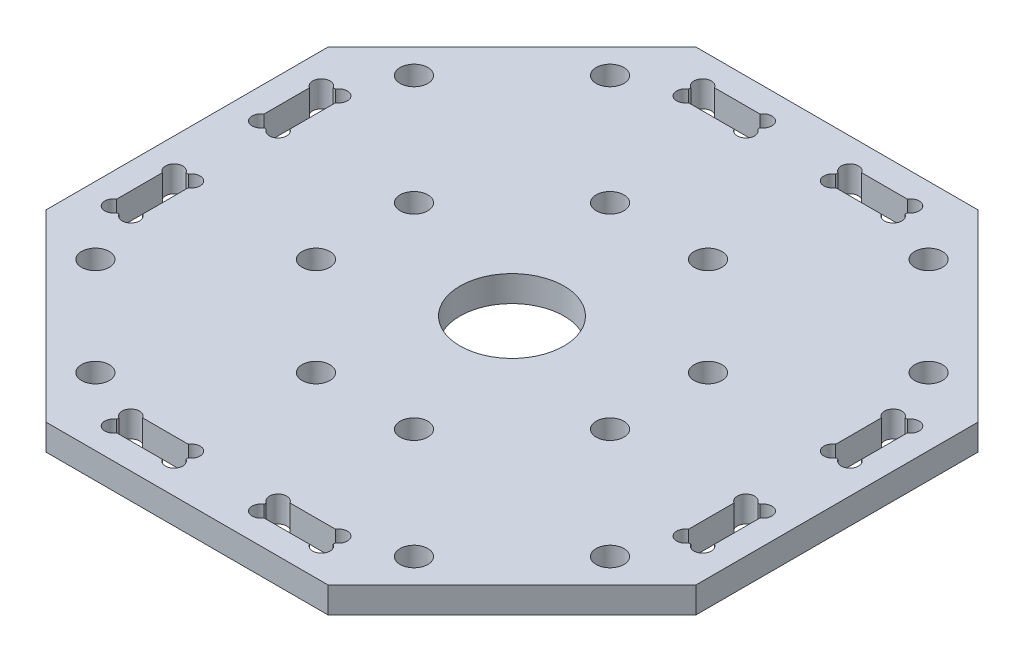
ISO-10303-21;
HEADER;
FILE_DESCRIPTION(('STEP AP214'),'2;1');
FILE_NAME('part.step','',(''),(''),'','','');
FILE_SCHEMA(('AUTOMOTIVE_DESIGN { 1 0 10303 214 1 1 1 1 }'));
ENDSEC;
DATA;
#1=APPLICATION_CONTEXT('core data for automotive mechanical design processes');
#2=APPLICATION_PROTOCOL_DEFINITION('international standard','automotive_design',2000,#1);
#3=PRODUCT_CONTEXT('',#1,'mechanical');
#4=PRODUCT('Part','Part','',(#3));
#5=PRODUCT_RELATED_PRODUCT_CATEGORY('part','',(#4));
#6=PRODUCT_DEFINITION_FORMATION('','',#4);
#7=PRODUCT_DEFINITION_CONTEXT('part definition',#1,'design');
#8=PRODUCT_DEFINITION('design','',#6,#7);
#9=PRODUCT_DEFINITION_SHAPE('','',#8);
#10=(LENGTH_UNIT() NAMED_UNIT(*) SI_UNIT(.MILLI.,.METRE.));
#11=(NAMED_UNIT(*) PLANE_ANGLE_UNIT() SI_UNIT($,.RADIAN.));
#12=(NAMED_UNIT(*) SI_UNIT($,.STERADIAN.) SOLID_ANGLE_UNIT());
#13=UNCERTAINTY_MEASURE_WITH_UNIT(LENGTH_MEASURE(1.E-05),#10,'distance_accuracy_value','');
#14=(GEOMETRIC_REPRESENTATION_CONTEXT(3) GLOBAL_UNCERTAINTY_ASSIGNED_CONTEXT((#13)) GLOBAL_UNIT_ASSIGNED_CONTEXT((#10,
#11,#12)) REPRESENTATION_CONTEXT('',''));
#15=CARTESIAN_POINT('',(0.,0.,0.));
#16=DIRECTION('',(0.,0.,1.));
#17=DIRECTION('',(1.,0.,0.));
#18=AXIS2_PLACEMENT_3D('',#15,#16,#17);
#19=CARTESIAN_POINT('',(0.,0.,0.));
#20=DIRECTION('',(0.,-1.,0.));
#21=DIRECTION('',(0.,0.,-1.));
#22=AXIS2_PLACEMENT_3D('',#19,#20,#21);
#23=PLANE('',#22);
#24=CARTESIAN_POINT('',(-12.,0.,-32.));
#25=DIRECTION('',(0.,1.,0.));
#26=DIRECTION('',(0.,0.,1.));
#27=AXIS2_PLACEMENT_3D('',#24,#25,#26);
#28=CIRCLE('',#27,0.999999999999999);
#29=CARTESIAN_POINT('',(-12.5,0.,-32.8660254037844));
#30=VERTEX_POINT('',#29);
#31=CARTESIAN_POINT('',(-11.1339745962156,0.,-31.5));
#32=VERTEX_POINT('',#31);
#33=EDGE_CURVE('E484',#30,#32,#28,.T.);
#34=ORIENTED_EDGE('',*,*,#33,.T.);
#35=DIRECTION('',(-1.,0.,0.));
#36=VECTOR('',#35,1.);
#37=CARTESIAN_POINT('',(0.,0.,-31.5));
#38=LINE('',#37,#36);
#39=CARTESIAN_POINT('',(-5.86602540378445,0.,-31.5));
#40=VERTEX_POINT('',#39);
#41=EDGE_CURVE('E494',#40,#32,#38,.T.);
#42=ORIENTED_EDGE('',*,*,#41,.F.);
#43=CARTESIAN_POINT('',(-5.00000000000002,0.,-32.));
#44=DIRECTION('',(0.,-1.,0.));
#45=DIRECTION('',(0.,0.,-1.));
#46=AXIS2_PLACEMENT_3D('',#43,#44,#45);
#47=CIRCLE('',#46,0.999999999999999);
#48=CARTESIAN_POINT('',(-4.50000000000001,0.,-32.8660254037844));
#49=VERTEX_POINT('',#48);
#50=EDGE_CURVE('E43',#49,#40,#47,.T.);
#51=ORIENTED_EDGE('',*,*,#50,.F.);
#52=DIRECTION('',(0.,0.,1.));
#53=VECTOR('',#52,1.);
#54=CARTESIAN_POINT('',(-4.50000000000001,0.,0.));
#55=LINE('',#54,#53);
#56=CARTESIAN_POINT('',(-4.50000000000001,0.,-33.1339745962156));
#57=VERTEX_POINT('',#56);
#58=EDGE_CURVE('E502',#57,#49,#55,.T.);
#59=ORIENTED_EDGE('',*,*,#58,.F.);
#60=CARTESIAN_POINT('',(-5.00000000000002,0.,-34.));
#61=DIRECTION('',(0.,1.,0.));
#62=DIRECTION('',(0.,0.,1.));
#63=AXIS2_PLACEMENT_3D('',#60,#61,#62);
#64=CIRCLE('',#63,0.999999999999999);
#65=CARTESIAN_POINT('',(-5.86602540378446,0.,-34.5));
#66=VERTEX_POINT('',#65);
#67=EDGE_CURVE('E589',#57,#66,#64,.T.);
#68=ORIENTED_EDGE('',*,*,#67,.T.);
#69=DIRECTION('',(1.,0.,0.));
#70=VECTOR('',#69,1.);
#71=CARTESIAN_POINT('',(0.,0.,-34.5));
#72=LINE('',#71,#70);
#73=CARTESIAN_POINT('',(-11.1339745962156,0.,-34.5));
#74=VERTEX_POINT('',#73);
#75=EDGE_CURVE('E505',#74,#66,#72,.T.);
#76=ORIENTED_EDGE('',*,*,#75,.F.);
#77=CARTESIAN_POINT('',(-12.,0.,-34.));
#78=DIRECTION('',(0.,1.,0.));
#79=DIRECTION('',(0.,0.,1.));
#80=AXIS2_PLACEMENT_3D('',#77,#78,#79);
#81=CIRCLE('',#80,0.999999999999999);
#82=CARTESIAN_POINT('',(-12.5,0.,-33.1339745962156));
#83=VERTEX_POINT('',#82);
#84=EDGE_CURVE('E1765',#74,#83,#81,.T.);
#85=ORIENTED_EDGE('',*,*,#84,.T.);
#86=DIRECTION('',(0.,0.,-1.));
#87=VECTOR('',#86,1.);
#88=CARTESIAN_POINT('',(-12.5,0.,0.));
#89=LINE('',#88,#87);
#90=EDGE_CURVE('E496',#30,#83,#89,.T.);
#91=ORIENTED_EDGE('',*,*,#90,.F.);
#92=EDGE_LOOP('',(#34,#42,#51,#59,#68,#76,#85,#91));
#93=FACE_BOUND('',#92,.T.);
#94=CARTESIAN_POINT('',(5.00000000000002,0.,-32.));
#95=DIRECTION('',(0.,-1.,0.));
#96=DIRECTION('',(0.,0.,-1.));
#97=AXIS2_PLACEMENT_3D('',#94,#95,#96);
#98=CIRCLE('',#97,0.999999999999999);
#99=CARTESIAN_POINT('',(5.86602540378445,0.,-31.5));
#100=VERTEX_POINT('',#99);
#101=CARTESIAN_POINT('',(4.49999999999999,0.,-32.8660254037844));
#102=VERTEX_POINT('',#101);
#103=EDGE_CURVE('E579',#100,#102,#98,.T.);
#104=ORIENTED_EDGE('',*,*,#103,.F.);
#105=DIRECTION('',(-1.,0.,0.));
#106=VECTOR('',#105,1.);
#107=CARTESIAN_POINT('',(0.,0.,-31.5));
#108=LINE('',#107,#106);
#109=CARTESIAN_POINT('',(11.1339745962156,0.,-31.5));
#110=VERTEX_POINT('',#109);
#111=EDGE_CURVE('E1158',#110,#100,#108,.T.);
#112=ORIENTED_EDGE('',*,*,#111,.F.);
#113=CARTESIAN_POINT('',(12.,0.,-32.));
#114=DIRECTION('',(0.,1.,0.));
#115=DIRECTION('',(0.,0.,1.));
#116=AXIS2_PLACEMENT_3D('',#113,#114,#115);
#117=CIRCLE('',#116,0.999999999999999);
#118=CARTESIAN_POINT('',(12.5,0.,-32.8660254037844));
#119=VERTEX_POINT('',#118);
#120=EDGE_CURVE('E578',#110,#119,#117,.T.);
#121=ORIENTED_EDGE('',*,*,#120,.T.);
#122=DIRECTION('',(0.,0.,1.));
#123=VECTOR('',#122,1.);
#124=CARTESIAN_POINT('',(12.5,0.,0.));
#125=LINE('',#124,#123);
#126=CARTESIAN_POINT('',(12.5,0.,-33.1339745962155));
#127=VERTEX_POINT('',#126);
#128=EDGE_CURVE('E507',#127,#119,#125,.T.);
#129=ORIENTED_EDGE('',*,*,#128,.F.);
#130=CARTESIAN_POINT('',(12.,0.,-34.));
#131=DIRECTION('',(0.,1.,0.));
#132=DIRECTION('',(0.,0.,1.));
#133=AXIS2_PLACEMENT_3D('',#130,#131,#132);
#134=CIRCLE('',#133,0.999999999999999);
#135=CARTESIAN_POINT('',(11.1339745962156,0.,-34.5));
#136=VERTEX_POINT('',#135);
#137=EDGE_CURVE('E632',#127,#136,#134,.T.);
#138=ORIENTED_EDGE('',*,*,#137,.T.);
#139=DIRECTION('',(1.,0.,0.));
#140=VECTOR('',#139,1.);
#141=CARTESIAN_POINT('',(0.,0.,-34.5));
#142=LINE('',#141,#140);
#143=CARTESIAN_POINT('',(5.86602540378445,0.,-34.5));
#144=VERTEX_POINT('',#143);
#145=EDGE_CURVE('E503',#144,#136,#142,.T.);
#146=ORIENTED_EDGE('',*,*,#145,.F.);
#147=CARTESIAN_POINT('',(5.00000000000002,0.,-34.));
#148=DIRECTION('',(0.,1.,0.));
#149=DIRECTION('',(0.,0.,1.));
#150=AXIS2_PLACEMENT_3D('',#147,#148,#149);
#151=CIRCLE('',#150,0.999999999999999);
#152=CARTESIAN_POINT('',(4.49999999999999,0.,-33.1339745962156));
#153=VERTEX_POINT('',#152);
#154=EDGE_CURVE('E621',#144,#153,#151,.T.);
#155=ORIENTED_EDGE('',*,*,#154,.T.);
#156=DIRECTION('',(0.,0.,-1.));
#157=VECTOR('',#156,1.);
#158=CARTESIAN_POINT('',(4.49999999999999,0.,0.));
#159=LINE('',#158,#157);
#160=EDGE_CURVE('E1156',#102,#153,#159,.T.);
#161=ORIENTED_EDGE('',*,*,#160,.F.);
#162=EDGE_LOOP('',(#104,#112,#121,#129,#138,#146,#155,#161));
#163=FACE_BOUND('',#162,.T.);
#164=CARTESIAN_POINT('',(-32.,0.,-5.00000000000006));
#165=DIRECTION('',(0.,-1.,0.));
#166=DIRECTION('',(0.,0.,-1.));
#167=AXIS2_PLACEMENT_3D('',#164,#165,#166);
#168=CIRCLE('',#167,1.);
#169=CARTESIAN_POINT('',(-31.5,0.,-5.8660254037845));
#170=VERTEX_POINT('',#169);
#171=CARTESIAN_POINT('',(-32.8660254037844,0.,-4.5));
#172=VERTEX_POINT('',#171);
#173=EDGE_CURVE('E576',#170,#172,#168,.T.);
#174=ORIENTED_EDGE('',*,*,#173,.F.);
#175=DIRECTION('',(0.,0.,1.));
#176=VECTOR('',#175,1.);
#177=CARTESIAN_POINT('',(-31.5,0.,0.));
#178=LINE('',#177,#176);
#179=CARTESIAN_POINT('',(-31.5,0.,-11.1339745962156));
#180=VERTEX_POINT('',#179);
#181=EDGE_CURVE('E1140',#180,#170,#178,.T.);
#182=ORIENTED_EDGE('',*,*,#181,.F.);
#183=CARTESIAN_POINT('',(-32.,0.,-12.0000000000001));
#184=DIRECTION('',(0.,1.,0.));
#185=DIRECTION('',(0.,0.,1.));
#186=AXIS2_PLACEMENT_3D('',#183,#184,#185);
#187=CIRCLE('',#186,1.);
#188=CARTESIAN_POINT('',(-32.8660254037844,0.,-12.5));
#189=VERTEX_POINT('',#188);
#190=EDGE_CURVE('E680',#180,#189,#187,.T.);
#191=ORIENTED_EDGE('',*,*,#190,.T.);
#192=DIRECTION('',(1.,0.,0.));
#193=VECTOR('',#192,1.);
#194=CARTESIAN_POINT('',(0.,0.,-12.5));
#195=LINE('',#194,#193);
#196=CARTESIAN_POINT('',(-33.1339745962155,0.,-12.5));
#197=VERTEX_POINT('',#196);
#198=EDGE_CURVE('E1143',#197,#189,#195,.T.);
#199=ORIENTED_EDGE('',*,*,#198,.F.);
#200=CARTESIAN_POINT('',(-34.,0.,-12.0000000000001));
#201=DIRECTION('',(0.,1.,0.));
#202=DIRECTION('',(0.,0.,1.));
#203=AXIS2_PLACEMENT_3D('',#200,#201,#202);
#204=CIRCLE('',#203,1.);
#205=CARTESIAN_POINT('',(-34.5,0.,-11.1339745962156));
#206=VERTEX_POINT('',#205);
#207=EDGE_CURVE('E669',#197,#206,#204,.T.);
#208=ORIENTED_EDGE('',*,*,#207,.T.);
#209=DIRECTION('',(0.,0.,-1.));
#210=VECTOR('',#209,1.);
#211=CARTESIAN_POINT('',(-34.5,0.,0.));
#212=LINE('',#211,#210);
#213=CARTESIAN_POINT('',(-34.5,0.,-5.8660254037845));
#214=VERTEX_POINT('',#213);
#215=EDGE_CURVE('E1145',#214,#206,#212,.T.);
#216=ORIENTED_EDGE('',*,*,#215,.F.);
#217=CARTESIAN_POINT('',(-34.,0.,-5.00000000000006));
#218=DIRECTION('',(0.,1.,0.));
#219=DIRECTION('',(0.,0.,1.));
#220=AXIS2_PLACEMENT_3D('',#217,#218,#219);
#221=CIRCLE('',#220,1.);
#222=CARTESIAN_POINT('',(-33.1339745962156,0.,-4.5));
#223=VERTEX_POINT('',#222);
#224=EDGE_CURVE('E658',#214,#223,#221,.T.);
#225=ORIENTED_EDGE('',*,*,#224,.T.);
#226=DIRECTION('',(-1.,0.,0.));
#227=VECTOR('',#226,1.);
#228=CARTESIAN_POINT('',(0.,0.,-4.5));
#229=LINE('',#228,#227);
#230=EDGE_CURVE('E1129',#172,#223,#229,.T.);
#231=ORIENTED_EDGE('',*,*,#230,.F.);
#232=EDGE_LOOP('',(#174,#182,#191,#199,#208,#216,#225,#231));
#233=FACE_BOUND('',#232,.T.);
#234=CARTESIAN_POINT('',(-32.,0.,12.));
#235=DIRECTION('',(0.,1.,0.));
#236=DIRECTION('',(0.,0.,1.));
#237=AXIS2_PLACEMENT_3D('',#234,#235,#236);
#238=CIRCLE('',#237,1.);
#239=CARTESIAN_POINT('',(-32.8660254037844,0.,12.5));
#240=VERTEX_POINT('',#239);
#241=CARTESIAN_POINT('',(-31.5,0.,11.1339745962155));
#242=VERTEX_POINT('',#241);
#243=EDGE_CURVE('E689',#240,#242,#238,.T.);
#244=ORIENTED_EDGE('',*,*,#243,.T.);
#245=DIRECTION('',(0.,0.,1.));
#246=VECTOR('',#245,1.);
#247=CARTESIAN_POINT('',(-31.5,0.,0.));
#248=LINE('',#247,#246);
#249=CARTESIAN_POINT('',(-31.5,0.,5.86602540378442));
#250=VERTEX_POINT('',#249);
#251=EDGE_CURVE('E1147',#250,#242,#248,.T.);
#252=ORIENTED_EDGE('',*,*,#251,.F.);
#253=CARTESIAN_POINT('',(-32.,0.,4.99999999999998));
#254=DIRECTION('',(0.,1.,0.));
#255=DIRECTION('',(0.,0.,1.));
#256=AXIS2_PLACEMENT_3D('',#253,#254,#255);
#257=CIRCLE('',#256,1.);
#258=CARTESIAN_POINT('',(-32.8660254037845,0.,4.5));
#259=VERTEX_POINT('',#258);
#260=EDGE_CURVE('E720',#250,#259,#257,.T.);
#261=ORIENTED_EDGE('',*,*,#260,.T.);
#262=DIRECTION('',(1.,0.,0.));
#263=VECTOR('',#262,1.);
#264=CARTESIAN_POINT('',(0.,0.,4.5));
#265=LINE('',#264,#263);
#266=CARTESIAN_POINT('',(-33.1339745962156,0.,4.5));
#267=VERTEX_POINT('',#266);
#268=EDGE_CURVE('E1150',#267,#259,#265,.T.);
#269=ORIENTED_EDGE('',*,*,#268,.F.);
#270=CARTESIAN_POINT('',(-34.,0.,4.99999999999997));
#271=DIRECTION('',(0.,1.,0.));
#272=DIRECTION('',(0.,0.,1.));
#273=AXIS2_PLACEMENT_3D('',#270,#271,#272);
#274=CIRCLE('',#273,1.);
#275=CARTESIAN_POINT('',(-34.5,0.,5.86602540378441));
#276=VERTEX_POINT('',#275);
#277=EDGE_CURVE('E709',#267,#276,#274,.T.);
#278=ORIENTED_EDGE('',*,*,#277,.T.);
#279=DIRECTION('',(0.,0.,-1.));
#280=VECTOR('',#279,1.);
#281=CARTESIAN_POINT('',(-34.5,0.,0.));
#282=LINE('',#281,#280);
#283=CARTESIAN_POINT('',(-34.5,0.,11.1339745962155));
#284=VERTEX_POINT('',#283);
#285=EDGE_CURVE('E1152',#284,#276,#282,.T.);
#286=ORIENTED_EDGE('',*,*,#285,.F.);
#287=CARTESIAN_POINT('',(-34.,0.,12.));
#288=DIRECTION('',(0.,1.,0.));
#289=DIRECTION('',(0.,0.,1.));
#290=AXIS2_PLACEMENT_3D('',#287,#288,#289);
#291=CIRCLE('',#290,1.);
#292=CARTESIAN_POINT('',(-33.1339745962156,0.,12.5));
#293=VERTEX_POINT('',#292);
#294=EDGE_CURVE('E698',#284,#293,#291,.T.);
#295=ORIENTED_EDGE('',*,*,#294,.T.);
#296=DIRECTION('',(-1.,0.,0.));
#297=VECTOR('',#296,1.);
#298=CARTESIAN_POINT('',(0.,0.,12.5));
#299=LINE('',#298,#297);
#300=EDGE_CURVE('E1154',#240,#293,#299,.T.);
#301=ORIENTED_EDGE('',*,*,#300,.F.);
#302=EDGE_LOOP('',(#244,#252,#261,#269,#278,#286,#295,#301));
#303=FACE_BOUND('',#302,.T.);
#304=CARTESIAN_POINT('',(32.,0.,4.99999999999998));
#305=DIRECTION('',(0.,1.,0.));
#306=DIRECTION('',(0.,0.,1.));
#307=AXIS2_PLACEMENT_3D('',#304,#305,#306);
#308=CIRCLE('',#307,1.);
#309=CARTESIAN_POINT('',(32.8660254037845,0.,4.5));
#310=VERTEX_POINT('',#309);
#311=CARTESIAN_POINT('',(31.5,0.,5.8660254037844));
#312=VERTEX_POINT('',#311);
#313=EDGE_CURVE('E731',#310,#312,#308,.T.);
#314=ORIENTED_EDGE('',*,*,#313,.T.);
#315=DIRECTION('',(0.,0.,-1.));
#316=VECTOR('',#315,1.);
#317=CARTESIAN_POINT('',(31.5,0.,0.));
#318=LINE('',#317,#316);
#319=CARTESIAN_POINT('',(31.5,0.,11.1339745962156));
#320=VERTEX_POINT('',#319);
#321=EDGE_CURVE('E524',#320,#312,#318,.T.);
#322=ORIENTED_EDGE('',*,*,#321,.F.);
#323=CARTESIAN_POINT('',(32.,0.,12.));
#324=DIRECTION('',(0.,1.,0.));
#325=DIRECTION('',(0.,0.,1.));
#326=AXIS2_PLACEMENT_3D('',#323,#324,#325);
#327=CIRCLE('',#326,1.);
#328=CARTESIAN_POINT('',(32.8660254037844,0.,12.5));
#329=VERTEX_POINT('',#328);
#330=EDGE_CURVE('E764',#320,#329,#327,.T.);
#331=ORIENTED_EDGE('',*,*,#330,.T.);
#332=DIRECTION('',(-1.,0.,0.));
#333=VECTOR('',#332,1.);
#334=CARTESIAN_POINT('',(0.,0.,12.5000000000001));
#335=LINE('',#334,#333);
#336=CARTESIAN_POINT('',(33.1339745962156,0.,12.5));
#337=VERTEX_POINT('',#336);
#338=EDGE_CURVE('E527',#337,#329,#335,.T.);
#339=ORIENTED_EDGE('',*,*,#338,.F.);
#340=CARTESIAN_POINT('',(34.,0.,12.));
#341=DIRECTION('',(0.,1.,0.));
#342=DIRECTION('',(0.,0.,1.));
#343=AXIS2_PLACEMENT_3D('',#340,#341,#342);
#344=CIRCLE('',#343,1.);
#345=CARTESIAN_POINT('',(34.5,0.,11.1339745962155));
#346=VERTEX_POINT('',#345);
#347=EDGE_CURVE('E753',#337,#346,#344,.T.);
#348=ORIENTED_EDGE('',*,*,#347,.T.);
#349=DIRECTION('',(0.,0.,1.));
#350=VECTOR('',#349,1.);
#351=CARTESIAN_POINT('',(34.5,0.,0.));
#352=LINE('',#351,#350);
#353=CARTESIAN_POINT('',(34.5,0.,5.86602540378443));
#354=VERTEX_POINT('',#353);
#355=EDGE_CURVE('E529',#354,#346,#352,.T.);
#356=ORIENTED_EDGE('',*,*,#355,.F.);
#357=CARTESIAN_POINT('',(34.,0.,4.99999999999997));
#358=DIRECTION('',(0.,1.,0.));
#359=DIRECTION('',(0.,0.,1.));
#360=AXIS2_PLACEMENT_3D('',#357,#358,#359);
#361=CIRCLE('',#360,1.);
#362=CARTESIAN_POINT('',(33.1339745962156,0.,4.5));
#363=VERTEX_POINT('',#362);
#364=EDGE_CURVE('E742',#354,#363,#361,.T.);
#365=ORIENTED_EDGE('',*,*,#364,.T.);
#366=DIRECTION('',(1.,0.,0.));
#367=VECTOR('',#366,1.);
#368=CARTESIAN_POINT('',(0.,0.,4.5));
#369=LINE('',#368,#367);
#370=EDGE_CURVE('E522',#310,#363,#369,.T.);
#371=ORIENTED_EDGE('',*,*,#370,.F.);
#372=EDGE_LOOP('',(#314,#322,#331,#339,#348,#356,#365,#371));
#373=FACE_BOUND('',#372,.T.);
#374=DIRECTION('',(0.707106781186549,0.,0.707106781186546));
#375=VECTOR('',#374,1.);
#376=CARTESIAN_POINT('',(-26.8933982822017,0.,26.8933982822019));
#377=LINE('',#376,#375);
#378=CARTESIAN_POINT('',(-37.5,0.,16.2867965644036));
#379=VERTEX_POINT('',#378);
#380=CARTESIAN_POINT('',(-16.2867965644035,0.,37.5));
#381=VERTEX_POINT('',#380);
#382=EDGE_CURVE('E916',#379,#381,#377,.T.);
#383=ORIENTED_EDGE('',*,*,#382,.F.);
#384=DIRECTION('',(0.,0.,1.));
#385=VECTOR('',#384,1.);
#386=CARTESIAN_POINT('',(-37.5,0.,37.5));
#387=LINE('',#386,#385);
#388=CARTESIAN_POINT('',(-37.5,0.,-16.2867965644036));
#389=VERTEX_POINT('',#388);
#390=EDGE_CURVE('E1134',#389,#379,#387,.T.);
#391=ORIENTED_EDGE('',*,*,#390,.F.);
#392=DIRECTION('',(-0.707106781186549,0.,0.707106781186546));
#393=VECTOR('',#392,1.);
#394=CARTESIAN_POINT('',(-26.8933982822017,0.,-26.8933982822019));
#395=LINE('',#394,#393);
#396=CARTESIAN_POINT('',(-16.2867965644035,0.,-37.5));
#397=VERTEX_POINT('',#396);
#398=EDGE_CURVE('E926',#397,#389,#395,.T.);
#399=ORIENTED_EDGE('',*,*,#398,.F.);
#400=DIRECTION('',(-1.,0.,0.));
#401=VECTOR('',#400,1.);
#402=CARTESIAN_POINT('',(-37.5,0.,-37.5));
#403=LINE('',#402,#401);
#404=CARTESIAN_POINT('',(16.2867965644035,0.,-37.5));
#405=VERTEX_POINT('',#404);
#406=EDGE_CURVE('E1132',#405,#397,#403,.T.);
#407=ORIENTED_EDGE('',*,*,#406,.F.);
#408=DIRECTION('',(-0.707106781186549,0.,-0.707106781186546));
#409=VECTOR('',#408,1.);
#410=CARTESIAN_POINT('',(26.8933982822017,0.,-26.8933982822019));
#411=LINE('',#410,#409);
#412=CARTESIAN_POINT('',(37.5,0.,-16.2867965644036));
#413=VERTEX_POINT('',#412);
#414=EDGE_CURVE('E918',#413,#405,#411,.T.);
#415=ORIENTED_EDGE('',*,*,#414,.F.);
#416=DIRECTION('',(0.,0.,-1.));
#417=VECTOR('',#416,1.);
#418=CARTESIAN_POINT('',(37.5,0.,37.5));
#419=LINE('',#418,#417);
#420=CARTESIAN_POINT('',(37.5,0.,16.2867965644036));
#421=VERTEX_POINT('',#420);
#422=EDGE_CURVE('E1114',#421,#413,#419,.T.);
#423=ORIENTED_EDGE('',*,*,#422,.F.);
#424=DIRECTION('',(0.707106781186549,0.,-0.707106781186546));
#425=VECTOR('',#424,1.);
#426=CARTESIAN_POINT('',(26.8933982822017,0.,26.8933982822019));
#427=LINE('',#426,#425);
#428=CARTESIAN_POINT('',(16.2867965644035,0.,37.5));
#429=VERTEX_POINT('',#428);
#430=EDGE_CURVE('E914',#429,#421,#427,.T.);
#431=ORIENTED_EDGE('',*,*,#430,.F.);
#432=DIRECTION('',(1.,0.,0.));
#433=VECTOR('',#432,1.);
#434=CARTESIAN_POINT('',(-37.5,0.,37.5));
#435=LINE('',#434,#433);
#436=EDGE_CURVE('E1121',#381,#429,#435,.T.);
#437=ORIENTED_EDGE('',*,*,#436,.F.);
#438=EDGE_LOOP('',(#383,#391,#399,#407,#415,#423,#431,#437));
#439=FACE_BOUND('',#438,.T.);
#440=CARTESIAN_POINT('',(16.9705627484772,0.,5.65685424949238));
#441=DIRECTION('',(0.,1.,0.));
#442=DIRECTION('',(0.,0.,1.));
#443=AXIS2_PLACEMENT_3D('',#440,#441,#442);
#444=CIRCLE('',#443,1.6);
#445=CARTESIAN_POINT('',(16.9705627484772,0.,7.25685424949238));
#446=VERTEX_POINT('',#445);
#447=EDGE_CURVE('E1017',#446,#446,#444,.T.);
#448=ORIENTED_EDGE('',*,*,#447,.T.);
#449=EDGE_LOOP('',(#448));
#450=FACE_BOUND('',#449,.T.);
#451=CARTESIAN_POINT('',(5.65685424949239,0.,16.9705627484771));
#452=DIRECTION('',(0.,1.,0.));
#453=DIRECTION('',(0.,0.,1.));
#454=AXIS2_PLACEMENT_3D('',#451,#452,#453);
#455=CIRCLE('',#454,1.6);
#456=CARTESIAN_POINT('',(5.65685424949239,0.,18.5705627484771));
#457=VERTEX_POINT('',#456);
#458=EDGE_CURVE('E1023',#457,#457,#455,.T.);
#459=ORIENTED_EDGE('',*,*,#458,.T.);
#460=EDGE_LOOP('',(#459));
#461=FACE_BOUND('',#460,.T.);
#462=CARTESIAN_POINT('',(29.698484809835,0.,18.3847763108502));
#463=DIRECTION('',(0.,1.,0.));
#464=DIRECTION('',(0.,0.,1.));
#465=AXIS2_PLACEMENT_3D('',#462,#463,#464);
#466=CIRCLE('',#465,1.6);
#467=CARTESIAN_POINT('',(29.698484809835,0.,19.9847763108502));
#468=VERTEX_POINT('',#467);
#469=EDGE_CURVE('E1029',#468,#468,#466,.T.);
#470=ORIENTED_EDGE('',*,*,#469,.T.);
#471=EDGE_LOOP('',(#470));
#472=FACE_BOUND('',#471,.T.);
#473=CARTESIAN_POINT('',(18.3847763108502,0.,29.698484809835));
#474=DIRECTION('',(0.,1.,0.));
#475=DIRECTION('',(0.,0.,1.));
#476=AXIS2_PLACEMENT_3D('',#473,#474,#475);
#477=CIRCLE('',#476,1.6);
#478=CARTESIAN_POINT('',(18.3847763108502,0.,31.298484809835));
#479=VERTEX_POINT('',#478);
#480=EDGE_CURVE('E1035',#479,#479,#477,.T.);
#481=ORIENTED_EDGE('',*,*,#480,.T.);
#482=EDGE_LOOP('',(#481));
#483=FACE_BOUND('',#482,.T.);
#484=CARTESIAN_POINT('',(-29.698484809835,0.,-18.3847763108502));
#485=DIRECTION('',(0.,1.,0.));
#486=DIRECTION('',(0.,0.,1.));
#487=AXIS2_PLACEMENT_3D('',#484,#485,#486);
#488=CIRCLE('',#487,1.6);
#489=CARTESIAN_POINT('',(-29.698484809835,0.,-16.7847763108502));
#490=VERTEX_POINT('',#489);
#491=EDGE_CURVE('E1041',#490,#490,#488,.T.);
#492=ORIENTED_EDGE('',*,*,#491,.T.);
#493=EDGE_LOOP('',(#492));
#494=FACE_BOUND('',#493,.T.);
#495=CARTESIAN_POINT('',(-18.3847763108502,0.,-29.698484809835));
#496=DIRECTION('',(0.,1.,0.));
#497=DIRECTION('',(0.,0.,1.));
#498=AXIS2_PLACEMENT_3D('',#495,#496,#497);
#499=CIRCLE('',#498,1.6);
#500=CARTESIAN_POINT('',(-18.3847763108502,0.,-28.098484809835));
#501=VERTEX_POINT('',#500);
#502=EDGE_CURVE('E1047',#501,#501,#499,.T.);
#503=ORIENTED_EDGE('',*,*,#502,.T.);
#504=EDGE_LOOP('',(#503));
#505=FACE_BOUND('',#504,.T.);
#506=CARTESIAN_POINT('',(-5.65685424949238,0.,-16.9705627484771));
#507=DIRECTION('',(0.,1.,0.));
#508=DIRECTION('',(0.,0.,1.));
#509=AXIS2_PLACEMENT_3D('',#506,#507,#508);
#510=CIRCLE('',#509,1.6);
#511=CARTESIAN_POINT('',(-5.65685424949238,0.,-15.3705627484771));
#512=VERTEX_POINT('',#511);
#513=EDGE_CURVE('E1053',#512,#512,#510,.T.);
#514=ORIENTED_EDGE('',*,*,#513,.T.);
#515=EDGE_LOOP('',(#514));
#516=FACE_BOUND('',#515,.T.);
#517=CARTESIAN_POINT('',(-16.9705627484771,0.,-5.65685424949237));
#518=DIRECTION('',(0.,1.,0.));
#519=DIRECTION('',(0.,0.,1.));
#520=AXIS2_PLACEMENT_3D('',#517,#518,#519);
#521=CIRCLE('',#520,1.6);
#522=CARTESIAN_POINT('',(-16.9705627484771,0.,-4.05685424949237));
#523=VERTEX_POINT('',#522);
#524=EDGE_CURVE('E1059',#523,#523,#521,.T.);
#525=ORIENTED_EDGE('',*,*,#524,.T.);
#526=EDGE_LOOP('',(#525));
#527=FACE_BOUND('',#526,.T.);
#528=CARTESIAN_POINT('',(-5.65685424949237,0.,16.9705627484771));
#529=DIRECTION('',(0.,1.,0.));
#530=DIRECTION('',(0.,0.,1.));
#531=AXIS2_PLACEMENT_3D('',#528,#529,#530);
#532=CIRCLE('',#531,1.6);
#533=CARTESIAN_POINT('',(-5.65685424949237,0.,18.5705627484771));
#534=VERTEX_POINT('',#533);
#535=EDGE_CURVE('E1065',#534,#534,#532,.T.);
#536=ORIENTED_EDGE('',*,*,#535,.T.);
#537=EDGE_LOOP('',(#536));
#538=FACE_BOUND('',#537,.T.);
#539=CARTESIAN_POINT('',(-18.3847763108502,0.,29.698484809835));
#540=DIRECTION('',(0.,1.,0.));
#541=DIRECTION('',(0.,0.,1.));
#542=AXIS2_PLACEMENT_3D('',#539,#540,#541);
#543=CIRCLE('',#542,1.6);
#544=CARTESIAN_POINT('',(-18.3847763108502,0.,31.298484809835));
#545=VERTEX_POINT('',#544);
#546=EDGE_CURVE('E1071',#545,#545,#543,.T.);
#547=ORIENTED_EDGE('',*,*,#546,.T.);
#548=EDGE_LOOP('',(#547));
#549=FACE_BOUND('',#548,.T.);
#550=CARTESIAN_POINT('',(-29.698484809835,0.,18.3847763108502));
#551=DIRECTION('',(0.,1.,0.));
#552=DIRECTION('',(0.,0.,1.));
#553=AXIS2_PLACEMENT_3D('',#550,#551,#552);
#554=CIRCLE('',#553,1.6);
#555=CARTESIAN_POINT('',(-29.698484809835,0.,19.9847763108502));
#556=VERTEX_POINT('',#555);
#557=EDGE_CURVE('E1077',#556,#556,#554,.T.);
#558=ORIENTED_EDGE('',*,*,#557,.T.);
#559=EDGE_LOOP('',(#558));
#560=FACE_BOUND('',#559,.T.);
#561=CARTESIAN_POINT('',(-16.9705627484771,0.,5.65685424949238));
#562=DIRECTION('',(0.,1.,0.));
#563=DIRECTION('',(0.,0.,1.));
#564=AXIS2_PLACEMENT_3D('',#561,#562,#563);
#565=CIRCLE('',#564,1.6);
#566=CARTESIAN_POINT('',(-16.9705627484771,0.,7.25685424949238));
#567=VERTEX_POINT('',#566);
#568=EDGE_CURVE('E1083',#567,#567,#565,.T.);
#569=ORIENTED_EDGE('',*,*,#568,.T.);
#570=EDGE_LOOP('',(#569));
#571=FACE_BOUND('',#570,.T.);
#572=CARTESIAN_POINT('',(5.65685424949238,0.,-16.9705627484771));
#573=DIRECTION('',(0.,1.,0.));
#574=DIRECTION('',(0.,0.,1.));
#575=AXIS2_PLACEMENT_3D('',#572,#573,#574);
#576=CIRCLE('',#575,1.6);
#577=CARTESIAN_POINT('',(5.65685424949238,0.,-15.3705627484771));
#578=VERTEX_POINT('',#577);
#579=EDGE_CURVE('E1089',#578,#578,#576,.T.);
#580=ORIENTED_EDGE('',*,*,#579,.T.);
#581=EDGE_LOOP('',(#580));
#582=FACE_BOUND('',#581,.T.);
#583=CARTESIAN_POINT('',(16.9705627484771,0.,-5.65685424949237));
#584=DIRECTION('',(0.,1.,0.));
#585=DIRECTION('',(0.,0.,1.));
#586=AXIS2_PLACEMENT_3D('',#583,#584,#585);
#587=CIRCLE('',#586,1.6);
#588=CARTESIAN_POINT('',(16.9705627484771,0.,-4.05685424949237));
#589=VERTEX_POINT('',#588);
#590=EDGE_CURVE('E1095',#589,#589,#587,.T.);
#591=ORIENTED_EDGE('',*,*,#590,.T.);
#592=EDGE_LOOP('',(#591));
#593=FACE_BOUND('',#592,.T.);
#594=CARTESIAN_POINT('',(29.698484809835,0.,-18.3847763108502));
#595=DIRECTION('',(0.,1.,0.));
#596=DIRECTION('',(0.,0.,1.));
#597=AXIS2_PLACEMENT_3D('',#594,#595,#596);
#598=CIRCLE('',#597,1.6);
#599=CARTESIAN_POINT('',(29.698484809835,0.,-16.7847763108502));
#600=VERTEX_POINT('',#599);
#601=EDGE_CURVE('E1101',#600,#600,#598,.T.);
#602=ORIENTED_EDGE('',*,*,#601,.T.);
#603=EDGE_LOOP('',(#602));
#604=FACE_BOUND('',#603,.T.);
#605=CARTESIAN_POINT('',(18.3847763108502,0.,-29.698484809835));
#606=DIRECTION('',(0.,1.,0.));
#607=DIRECTION('',(0.,0.,1.));
#608=AXIS2_PLACEMENT_3D('',#605,#606,#607);
#609=CIRCLE('',#608,1.6);
#610=CARTESIAN_POINT('',(18.3847763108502,0.,-28.098484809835));
#611=VERTEX_POINT('',#610);
#612=EDGE_CURVE('E1107',#611,#611,#609,.T.);
#613=ORIENTED_EDGE('',*,*,#612,.T.);
#614=EDGE_LOOP('',(#613));
#615=FACE_BOUND('',#614,.T.);
#616=CARTESIAN_POINT('',(0.,0.,0.));
#617=DIRECTION('',(0.,1.,0.));
#618=DIRECTION('',(0.,0.,1.));
#619=AXIS2_PLACEMENT_3D('',#616,#617,#618);
#620=CIRCLE('',#619,6.);
#621=CARTESIAN_POINT('',(0.,0.,6.00000000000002));
#622=VERTEX_POINT('',#621);
#623=EDGE_CURVE('E1110',#622,#622,#620,.T.);
#624=ORIENTED_EDGE('',*,*,#623,.T.);
#625=EDGE_LOOP('',(#624));
#626=FACE_BOUND('',#625,.T.);
#627=DIRECTION('',(0.,0.,1.));
#628=VECTOR('',#627,1.);
#629=CARTESIAN_POINT('',(12.4999999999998,0.,0.));
#630=LINE('',#629,#628);
#631=CARTESIAN_POINT('',(12.5,0.,32.8660254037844));
#632=VERTEX_POINT('',#631);
#633=CARTESIAN_POINT('',(12.5,0.,33.1339745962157));
#634=VERTEX_POINT('',#633);
#635=EDGE_CURVE('E547',#632,#634,#630,.T.);
#636=ORIENTED_EDGE('',*,*,#635,.F.);
#637=CARTESIAN_POINT('',(11.9999999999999,0.,32.));
#638=DIRECTION('',(0.,1.,0.));
#639=DIRECTION('',(0.,0.,1.));
#640=AXIS2_PLACEMENT_3D('',#637,#638,#639);
#641=CIRCLE('',#640,0.999999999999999);
#642=CARTESIAN_POINT('',(11.1339745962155,0.,31.5));
#643=VERTEX_POINT('',#642);
#644=EDGE_CURVE('E863',#632,#643,#641,.T.);
#645=ORIENTED_EDGE('',*,*,#644,.T.);
#646=DIRECTION('',(1.,0.,0.));
#647=VECTOR('',#646,1.);
#648=CARTESIAN_POINT('',(0.,0.,31.5));
#649=LINE('',#648,#647);
#650=CARTESIAN_POINT('',(5.86602540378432,0.,31.5));
#651=VERTEX_POINT('',#650);
#652=EDGE_CURVE('E540',#651,#643,#649,.T.);
#653=ORIENTED_EDGE('',*,*,#652,.F.);
#654=CARTESIAN_POINT('',(4.99999999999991,0.,32.));
#655=DIRECTION('',(0.,1.,0.));
#656=DIRECTION('',(0.,0.,1.));
#657=AXIS2_PLACEMENT_3D('',#654,#655,#656);
#658=CIRCLE('',#657,0.999999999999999);
#659=CARTESIAN_POINT('',(4.49999999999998,0.,32.8660254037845));
#660=VERTEX_POINT('',#659);
#661=EDGE_CURVE('E894',#651,#660,#658,.T.);
#662=ORIENTED_EDGE('',*,*,#661,.T.);
#663=DIRECTION('',(0.,0.,-1.));
#664=VECTOR('',#663,1.);
#665=CARTESIAN_POINT('',(4.4999999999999,0.,0.));
#666=LINE('',#665,#664);
#667=CARTESIAN_POINT('',(4.49999999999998,0.,33.1339745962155));
#668=VERTEX_POINT('',#667);
#669=EDGE_CURVE('E543',#668,#660,#666,.T.);
#670=ORIENTED_EDGE('',*,*,#669,.F.);
#671=CARTESIAN_POINT('',(4.99999999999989,0.,34.));
#672=DIRECTION('',(0.,1.,0.));
#673=DIRECTION('',(0.,0.,1.));
#674=AXIS2_PLACEMENT_3D('',#671,#672,#673);
#675=CIRCLE('',#674,0.999999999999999);
#676=CARTESIAN_POINT('',(5.86602540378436,0.,34.5));
#677=VERTEX_POINT('',#676);
#678=EDGE_CURVE('E882',#668,#677,#675,.T.);
#679=ORIENTED_EDGE('',*,*,#678,.T.);
#680=DIRECTION('',(-1.,0.,0.));
#681=VECTOR('',#680,1.);
#682=CARTESIAN_POINT('',(0.,0.,34.5));
#683=LINE('',#682,#681);
#684=CARTESIAN_POINT('',(11.1339745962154,0.,34.5));
#685=VERTEX_POINT('',#684);
#686=EDGE_CURVE('E545',#685,#677,#683,.T.);
#687=ORIENTED_EDGE('',*,*,#686,.F.);
#688=CARTESIAN_POINT('',(11.9999999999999,0.,34.));
#689=DIRECTION('',(0.,1.,0.));
#690=DIRECTION('',(0.,0.,1.));
#691=AXIS2_PLACEMENT_3D('',#688,#689,#690);
#692=CIRCLE('',#691,0.999999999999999);
#693=EDGE_CURVE('E841',#685,#634,#692,.T.);
#694=ORIENTED_EDGE('',*,*,#693,.T.);
#695=EDGE_LOOP('',(#636,#645,#653,#662,#670,#679,#687,#694));
#696=FACE_BOUND('',#695,.T.);
#697=DIRECTION('',(0.,0.,1.));
#698=VECTOR('',#697,1.);
#699=CARTESIAN_POINT('',(-4.50000000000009,0.,0.));
#700=LINE('',#699,#698);
#701=CARTESIAN_POINT('',(-4.50000000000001,0.,32.8660254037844));
#702=VERTEX_POINT('',#701);
#703=CARTESIAN_POINT('',(-4.50000000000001,0.,33.1339745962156));
#704=VERTEX_POINT('',#703);
#705=EDGE_CURVE('E531',#702,#704,#700,.T.);
#706=ORIENTED_EDGE('',*,*,#705,.F.);
#707=CARTESIAN_POINT('',(-5.00000000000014,0.,32.));
#708=DIRECTION('',(0.,1.,0.));
#709=DIRECTION('',(0.,0.,1.));
#710=AXIS2_PLACEMENT_3D('',#707,#708,#709);
#711=CIRCLE('',#710,0.999999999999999);
#712=CARTESIAN_POINT('',(-5.86602540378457,0.,31.5));
#713=VERTEX_POINT('',#712);
#714=EDGE_CURVE('E819',#702,#713,#711,.T.);
#715=ORIENTED_EDGE('',*,*,#714,.T.);
#716=DIRECTION('',(1.,0.,0.));
#717=VECTOR('',#716,1.);
#718=CARTESIAN_POINT('',(0.,0.,31.5));
#719=LINE('',#718,#717);
#720=CARTESIAN_POINT('',(-11.1339745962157,0.,31.5));
#721=VERTEX_POINT('',#720);
#722=EDGE_CURVE('E533',#721,#713,#719,.T.);
#723=ORIENTED_EDGE('',*,*,#722,.F.);
#724=CARTESIAN_POINT('',(-12.0000000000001,0.,32.));
#725=DIRECTION('',(0.,1.,0.));
#726=DIRECTION('',(0.,0.,1.));
#727=AXIS2_PLACEMENT_3D('',#724,#725,#726);
#728=CIRCLE('',#727,0.999999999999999);
#729=CARTESIAN_POINT('',(-12.5,0.,32.8660254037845));
#730=VERTEX_POINT('',#729);
#731=EDGE_CURVE('E852',#721,#730,#728,.T.);
#732=ORIENTED_EDGE('',*,*,#731,.T.);
#733=DIRECTION('',(0.,0.,-1.));
#734=VECTOR('',#733,1.);
#735=CARTESIAN_POINT('',(-12.5000000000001,0.,0.));
#736=LINE('',#735,#734);
#737=CARTESIAN_POINT('',(-12.5,0.,33.1339745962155));
#738=VERTEX_POINT('',#737);
#739=EDGE_CURVE('E536',#738,#730,#736,.T.);
#740=ORIENTED_EDGE('',*,*,#739,.F.);
#741=CARTESIAN_POINT('',(-12.0000000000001,0.,34.));
#742=DIRECTION('',(0.,1.,0.));
#743=DIRECTION('',(0.,0.,1.));
#744=AXIS2_PLACEMENT_3D('',#741,#742,#743);
#745=CIRCLE('',#744,0.999999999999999);
#746=CARTESIAN_POINT('',(-11.1339745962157,0.,34.5));
#747=VERTEX_POINT('',#746);
#748=EDGE_CURVE('E839',#738,#747,#745,.T.);
#749=ORIENTED_EDGE('',*,*,#748,.T.);
#750=DIRECTION('',(-1.,0.,0.));
#751=VECTOR('',#750,1.);
#752=CARTESIAN_POINT('',(0.,0.,34.5));
#753=LINE('',#752,#751);
#754=CARTESIAN_POINT('',(-5.86602540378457,0.,34.5));
#755=VERTEX_POINT('',#754);
#756=EDGE_CURVE('E538',#755,#747,#753,.T.);
#757=ORIENTED_EDGE('',*,*,#756,.F.);
#758=CARTESIAN_POINT('',(-5.00000000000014,0.,34.));
#759=DIRECTION('',(0.,1.,0.));
#760=DIRECTION('',(0.,0.,1.));
#761=AXIS2_PLACEMENT_3D('',#758,#759,#760);
#762=CIRCLE('',#761,0.999999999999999);
#763=EDGE_CURVE('E828',#755,#704,#762,.T.);
#764=ORIENTED_EDGE('',*,*,#763,.T.);
#765=EDGE_LOOP('',(#706,#715,#723,#732,#740,#749,#757,#764));
#766=FACE_BOUND('',#765,.T.);
#767=DIRECTION('',(1.,0.,0.));
#768=VECTOR('',#767,1.);
#769=CARTESIAN_POINT('',(0.,0.,-12.4999999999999));
#770=LINE('',#769,#768);
#771=CARTESIAN_POINT('',(32.8660254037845,0.,-12.5));
#772=VERTEX_POINT('',#771);
#773=CARTESIAN_POINT('',(33.1339745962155,0.,-12.5));
#774=VERTEX_POINT('',#773);
#775=EDGE_CURVE('E520',#772,#774,#770,.T.);
#776=ORIENTED_EDGE('',*,*,#775,.F.);
#777=CARTESIAN_POINT('',(32.,0.,-12.0000000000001));
#778=DIRECTION('',(0.,1.,0.));
#779=DIRECTION('',(0.,0.,1.));
#780=AXIS2_PLACEMENT_3D('',#777,#778,#779);
#781=CIRCLE('',#780,1.);
#782=CARTESIAN_POINT('',(31.5,0.,-11.1339745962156));
#783=VERTEX_POINT('',#782);
#784=EDGE_CURVE('E775',#772,#783,#781,.T.);
#785=ORIENTED_EDGE('',*,*,#784,.T.);
#786=DIRECTION('',(0.,0.,-1.));
#787=VECTOR('',#786,1.);
#788=CARTESIAN_POINT('',(31.5,0.,0.));
#789=LINE('',#788,#787);
#790=CARTESIAN_POINT('',(31.5,0.,-5.86602540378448));
#791=VERTEX_POINT('',#790);
#792=EDGE_CURVE('E513',#791,#783,#789,.T.);
#793=ORIENTED_EDGE('',*,*,#792,.F.);
#794=CARTESIAN_POINT('',(32.,0.,-5.00000000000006));
#795=DIRECTION('',(0.,1.,0.));
#796=DIRECTION('',(0.,0.,1.));
#797=AXIS2_PLACEMENT_3D('',#794,#795,#796);
#798=CIRCLE('',#797,1.);
#799=CARTESIAN_POINT('',(32.8660254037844,0.,-4.5));
#800=VERTEX_POINT('',#799);
#801=EDGE_CURVE('E808',#791,#800,#798,.T.);
#802=ORIENTED_EDGE('',*,*,#801,.T.);
#803=DIRECTION('',(-1.,0.,0.));
#804=VECTOR('',#803,1.);
#805=CARTESIAN_POINT('',(0.,0.,-4.5));
#806=LINE('',#805,#804);
#807=CARTESIAN_POINT('',(33.1339745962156,0.,-4.5));
#808=VERTEX_POINT('',#807);
#809=EDGE_CURVE('E516',#808,#800,#806,.T.);
#810=ORIENTED_EDGE('',*,*,#809,.F.);
#811=CARTESIAN_POINT('',(34.,0.,-5.00000000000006));
#812=DIRECTION('',(0.,1.,0.));
#813=DIRECTION('',(0.,0.,1.));
#814=AXIS2_PLACEMENT_3D('',#811,#812,#813);
#815=CIRCLE('',#814,1.);
#816=CARTESIAN_POINT('',(34.5,0.,-5.86602540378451));
#817=VERTEX_POINT('',#816);
#818=EDGE_CURVE('E767',#808,#817,#815,.T.);
#819=ORIENTED_EDGE('',*,*,#818,.T.);
#820=DIRECTION('',(0.,0.,1.));
#821=VECTOR('',#820,1.);
#822=CARTESIAN_POINT('',(34.5,0.,0.));
#823=LINE('',#822,#821);
#824=CARTESIAN_POINT('',(34.5,0.,-11.1339745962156));
#825=VERTEX_POINT('',#824);
#826=EDGE_CURVE('E518',#825,#817,#823,.T.);
#827=ORIENTED_EDGE('',*,*,#826,.F.);
#828=CARTESIAN_POINT('',(34.,0.,-12.0000000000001));
#829=DIRECTION('',(0.,1.,0.));
#830=DIRECTION('',(0.,0.,1.));
#831=AXIS2_PLACEMENT_3D('',#828,#829,#830);
#832=CIRCLE('',#831,1.);
#833=EDGE_CURVE('E786',#825,#774,#832,.T.);
#834=ORIENTED_EDGE('',*,*,#833,.T.);
#835=EDGE_LOOP('',(#776,#785,#793,#802,#810,#819,#827,#834));
#836=FACE_BOUND('',#835,.T.);
#837=ADVANCED_FACE('F35',(#93,#163,#233,#303,#373,#439,#450,#461,#472,#483,#494,#505,#516,#527,
#538,#549,#560,#571,#582,#593,#604,#615,#626,#696,#766,#836),#23,.T.);
#838=CARTESIAN_POINT('',(0.,3.,0.));
#839=DIRECTION('',(0.,-1.,0.));
#840=DIRECTION('',(0.,0.,-1.));
#841=AXIS2_PLACEMENT_3D('',#838,#839,#840);
#842=PLANE('',#841);
#843=DIRECTION('',(0.,0.,-1.));
#844=VECTOR('',#843,1.);
#845=CARTESIAN_POINT('',(-31.5,3.,12.5));
#846=LINE('',#845,#844);
#847=CARTESIAN_POINT('',(-31.5,3.,11.1339745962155));
#848=VERTEX_POINT('',#847);
#849=CARTESIAN_POINT('',(-31.5,3.,5.86602540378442));
#850=VERTEX_POINT('',#849);
#851=EDGE_CURVE('E976',#848,#850,#846,.T.);
#852=ORIENTED_EDGE('',*,*,#851,.F.);
#853=CARTESIAN_POINT('',(-32.,3.,12.));
#854=DIRECTION('',(0.,-1.,0.));
#855=DIRECTION('',(0.,0.,-1.));
#856=AXIS2_PLACEMENT_3D('',#853,#854,#855);
#857=CIRCLE('',#856,1.);
#858=CARTESIAN_POINT('',(-32.8660254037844,3.,12.5));
#859=VERTEX_POINT('',#858);
#860=EDGE_CURVE('E568',#848,#859,#857,.T.);
#861=ORIENTED_EDGE('',*,*,#860,.T.);
#862=DIRECTION('',(1.,0.,0.));
#863=VECTOR('',#862,1.);
#864=CARTESIAN_POINT('',(-34.5,3.,12.5));
#865=LINE('',#864,#863);
#866=CARTESIAN_POINT('',(-33.1339745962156,3.,12.5));
#867=VERTEX_POINT('',#866);
#868=EDGE_CURVE('E973',#867,#859,#865,.T.);
#869=ORIENTED_EDGE('',*,*,#868,.F.);
#870=CARTESIAN_POINT('',(-34.,3.,12.));
#871=DIRECTION('',(0.,-1.,0.));
#872=DIRECTION('',(0.,0.,-1.));
#873=AXIS2_PLACEMENT_3D('',#870,#871,#872);
#874=CIRCLE('',#873,1.);
#875=CARTESIAN_POINT('',(-34.5,3.,11.1339745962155));
#876=VERTEX_POINT('',#875);
#877=EDGE_CURVE('E565',#867,#876,#874,.T.);
#878=ORIENTED_EDGE('',*,*,#877,.T.);
#879=DIRECTION('',(0.,0.,1.));
#880=VECTOR('',#879,1.);
#881=CARTESIAN_POINT('',(-34.5,3.,12.5));
#882=LINE('',#881,#880);
#883=CARTESIAN_POINT('',(-34.5,3.,5.86602540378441));
#884=VERTEX_POINT('',#883);
#885=EDGE_CURVE('E982',#884,#876,#882,.T.);
#886=ORIENTED_EDGE('',*,*,#885,.F.);
#887=CARTESIAN_POINT('',(-34.,3.,4.99999999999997));
#888=DIRECTION('',(0.,1.,0.));
#889=DIRECTION('',(0.,0.,1.));
#890=AXIS2_PLACEMENT_3D('',#887,#888,#889);
#891=CIRCLE('',#890,1.);
#892=CARTESIAN_POINT('',(-33.1339745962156,3.,4.5));
#893=VERTEX_POINT('',#892);
#894=EDGE_CURVE('E707',#893,#884,#891,.T.);
#895=ORIENTED_EDGE('',*,*,#894,.F.);
#896=DIRECTION('',(-1.,0.,0.));
#897=VECTOR('',#896,1.);
#898=CARTESIAN_POINT('',(-34.5,3.,4.5));
#899=LINE('',#898,#897);
#900=CARTESIAN_POINT('',(-32.8660254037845,3.,4.5));
#901=VERTEX_POINT('',#900);
#902=EDGE_CURVE('E979',#901,#893,#899,.T.);
#903=ORIENTED_EDGE('',*,*,#902,.F.);
#904=CARTESIAN_POINT('',(-32.,3.,4.99999999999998));
#905=DIRECTION('',(0.,1.,0.));
#906=DIRECTION('',(0.,0.,1.));
#907=AXIS2_PLACEMENT_3D('',#904,#905,#906);
#908=CIRCLE('',#907,1.);
#909=EDGE_CURVE('E718',#850,#901,#908,.T.);
#910=ORIENTED_EDGE('',*,*,#909,.F.);
#911=EDGE_LOOP('',(#852,#861,#869,#878,#886,#895,#903,#910));
#912=FACE_BOUND('',#911,.T.);
#913=CARTESIAN_POINT('',(32.,3.,4.99999999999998));
#914=DIRECTION('',(0.,1.,0.));
#915=DIRECTION('',(0.,0.,1.));
#916=AXIS2_PLACEMENT_3D('',#913,#914,#915);
#917=CIRCLE('',#916,1.);
#918=CARTESIAN_POINT('',(32.8660254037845,3.,4.5));
#919=VERTEX_POINT('',#918);
#920=CARTESIAN_POINT('',(31.5,3.,5.8660254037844));
#921=VERTEX_POINT('',#920);
#922=EDGE_CURVE('E729',#919,#921,#917,.T.);
#923=ORIENTED_EDGE('',*,*,#922,.F.);
#924=DIRECTION('',(-1.,0.,0.));
#925=VECTOR('',#924,1.);
#926=CARTESIAN_POINT('',(34.5,3.,4.5));
#927=LINE('',#926,#925);
#928=CARTESIAN_POINT('',(33.1339745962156,3.,4.5));
#929=VERTEX_POINT('',#928);
#930=EDGE_CURVE('E945',#929,#919,#927,.T.);
#931=ORIENTED_EDGE('',*,*,#930,.F.);
#932=CARTESIAN_POINT('',(34.,3.,4.99999999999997));
#933=DIRECTION('',(0.,1.,0.));
#934=DIRECTION('',(0.,0.,1.));
#935=AXIS2_PLACEMENT_3D('',#932,#933,#934);
#936=CIRCLE('',#935,1.);
#937=CARTESIAN_POINT('',(34.5,3.,5.86602540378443));
#938=VERTEX_POINT('',#937);
#939=EDGE_CURVE('E740',#938,#929,#936,.T.);
#940=ORIENTED_EDGE('',*,*,#939,.F.);
#941=DIRECTION('',(0.,0.,-1.));
#942=VECTOR('',#941,1.);
#943=CARTESIAN_POINT('',(34.5,3.,12.5));
#944=LINE('',#943,#942);
#945=CARTESIAN_POINT('',(34.5,3.,11.1339745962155));
#946=VERTEX_POINT('',#945);
#947=EDGE_CURVE('E942',#946,#938,#944,.T.);
#948=ORIENTED_EDGE('',*,*,#947,.F.);
#949=CARTESIAN_POINT('',(34.,3.,12.));
#950=DIRECTION('',(0.,1.,0.));
#951=DIRECTION('',(0.,0.,1.));
#952=AXIS2_PLACEMENT_3D('',#949,#950,#951);
#953=CIRCLE('',#952,1.);
#954=CARTESIAN_POINT('',(33.1339745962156,3.,12.5));
#955=VERTEX_POINT('',#954);
#956=EDGE_CURVE('E569',#955,#946,#953,.T.);
#957=ORIENTED_EDGE('',*,*,#956,.F.);
#958=DIRECTION('',(1.,0.,0.));
#959=VECTOR('',#958,1.);
#960=CARTESIAN_POINT('',(34.5,3.,12.5));
#961=LINE('',#960,#959);
#962=CARTESIAN_POINT('',(32.8660254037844,3.,12.5));
#963=VERTEX_POINT('',#962);
#964=EDGE_CURVE('E933',#963,#955,#961,.T.);
#965=ORIENTED_EDGE('',*,*,#964,.F.);
#966=CARTESIAN_POINT('',(32.,3.,12.));
#967=DIRECTION('',(0.,1.,0.));
#968=DIRECTION('',(0.,0.,1.));
#969=AXIS2_PLACEMENT_3D('',#966,#967,#968);
#970=CIRCLE('',#969,1.);
#971=CARTESIAN_POINT('',(31.5,3.,11.1339745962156));
#972=VERTEX_POINT('',#971);
#973=EDGE_CURVE('E756',#972,#963,#970,.T.);
#974=ORIENTED_EDGE('',*,*,#973,.F.);
#975=DIRECTION('',(0.,0.,1.));
#976=VECTOR('',#975,1.);
#977=CARTESIAN_POINT('',(31.5,3.,12.5));
#978=LINE('',#977,#976);
#979=EDGE_CURVE('E949',#921,#972,#978,.T.);
#980=ORIENTED_EDGE('',*,*,#979,.F.);
#981=EDGE_LOOP('',(#923,#931,#940,#948,#957,#965,#974,#980));
#982=FACE_BOUND('',#981,.T.);
#983=CARTESIAN_POINT('',(0.,3.,0.));
#984=DIRECTION('',(0.,1.,0.));
#985=DIRECTION('',(0.,0.,1.));
#986=AXIS2_PLACEMENT_3D('',#983,#984,#985);
#987=CIRCLE('',#986,6.);
#988=CARTESIAN_POINT('',(0.,3.,6.00000000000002));
#989=VERTEX_POINT('',#988);
#990=EDGE_CURVE('E1111',#989,#989,#987,.T.);
#991=ORIENTED_EDGE('',*,*,#990,.F.);
#992=EDGE_LOOP('',(#991));
#993=FACE_BOUND('',#992,.T.);
#994=DIRECTION('',(0.,0.,1.));
#995=VECTOR('',#994,1.);
#996=CARTESIAN_POINT('',(-37.5,3.,37.5));
#997=LINE('',#996,#995);
#998=CARTESIAN_POINT('',(-37.5,3.,-16.2867965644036));
#999=VERTEX_POINT('',#998);
#1000=CARTESIAN_POINT('',(-37.5,3.,16.2867965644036));
#1001=VERTEX_POINT('',#1000);
#1002=EDGE_CURVE('E1123',#999,#1001,#997,.T.);
#1003=ORIENTED_EDGE('',*,*,#1002,.T.);
#1004=DIRECTION('',(-0.707106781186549,0.,-0.707106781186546));
#1005=VECTOR('',#1004,1.);
#1006=CARTESIAN_POINT('',(-16.2867965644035,3.,37.5));
#1007=LINE('',#1006,#1005);
#1008=CARTESIAN_POINT('',(-16.2867965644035,3.,37.5));
#1009=VERTEX_POINT('',#1008);
#1010=EDGE_CURVE('E900',#1009,#1001,#1007,.T.);
#1011=ORIENTED_EDGE('',*,*,#1010,.F.);
#1012=DIRECTION('',(1.,0.,0.));
#1013=VECTOR('',#1012,1.);
#1014=CARTESIAN_POINT('',(-37.5,3.,37.5));
#1015=LINE('',#1014,#1013);
#1016=CARTESIAN_POINT('',(16.2867965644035,3.,37.5));
#1017=VERTEX_POINT('',#1016);
#1018=EDGE_CURVE('E1126',#1009,#1017,#1015,.T.);
#1019=ORIENTED_EDGE('',*,*,#1018,.T.);
#1020=DIRECTION('',(-0.707106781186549,0.,0.707106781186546));
#1021=VECTOR('',#1020,1.);
#1022=CARTESIAN_POINT('',(16.2867965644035,3.,37.5));
#1023=LINE('',#1022,#1021);
#1024=CARTESIAN_POINT('',(37.5,3.,16.2867965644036));
#1025=VERTEX_POINT('',#1024);
#1026=EDGE_CURVE('E907',#1025,#1017,#1023,.T.);
#1027=ORIENTED_EDGE('',*,*,#1026,.F.);
#1028=DIRECTION('',(0.,0.,-1.));
#1029=VECTOR('',#1028,1.);
#1030=CARTESIAN_POINT('',(37.5,3.,37.5));
#1031=LINE('',#1030,#1029);
#1032=CARTESIAN_POINT('',(37.5,3.,-16.2867965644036));
#1033=VERTEX_POINT('',#1032);
#1034=EDGE_CURVE('E1117',#1025,#1033,#1031,.T.);
#1035=ORIENTED_EDGE('',*,*,#1034,.T.);
#1036=DIRECTION('',(0.707106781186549,0.,0.707106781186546));
#1037=VECTOR('',#1036,1.);
#1038=CARTESIAN_POINT('',(16.2867965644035,3.,-37.5));
#1039=LINE('',#1038,#1037);
#1040=CARTESIAN_POINT('',(16.2867965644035,3.,-37.5));
#1041=VERTEX_POINT('',#1040);
#1042=EDGE_CURVE('E901',#1041,#1033,#1039,.T.);
#1043=ORIENTED_EDGE('',*,*,#1042,.F.);
#1044=DIRECTION('',(-1.,0.,0.));
#1045=VECTOR('',#1044,1.);
#1046=CARTESIAN_POINT('',(-37.5,3.,-37.5));
#1047=LINE('',#1046,#1045);
#1048=CARTESIAN_POINT('',(-16.2867965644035,3.,-37.5));
#1049=VERTEX_POINT('',#1048);
#1050=EDGE_CURVE('E1120',#1041,#1049,#1047,.T.);
#1051=ORIENTED_EDGE('',*,*,#1050,.T.);
#1052=DIRECTION('',(0.707106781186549,0.,-0.707106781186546));
#1053=VECTOR('',#1052,1.);
#1054=CARTESIAN_POINT('',(-16.2867965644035,3.,-37.5));
#1055=LINE('',#1054,#1053);
#1056=EDGE_CURVE('E920',#999,#1049,#1055,.T.);
#1057=ORIENTED_EDGE('',*,*,#1056,.F.);
#1058=EDGE_LOOP('',(#1003,#1011,#1019,#1027,#1035,#1043,#1051,#1057));
#1059=FACE_BOUND('',#1058,.T.);
#1060=CARTESIAN_POINT('',(18.3847763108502,3.,-29.698484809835));
#1061=DIRECTION('',(0.,1.,0.));
#1062=DIRECTION('',(0.,0.,1.));
#1063=AXIS2_PLACEMENT_3D('',#1060,#1061,#1062);
#1064=CIRCLE('',#1063,1.6);
#1065=CARTESIAN_POINT('',(18.3847763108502,3.,-28.098484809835));
#1066=VERTEX_POINT('',#1065);
#1067=EDGE_CURVE('E1104',#1066,#1066,#1064,.T.);
#1068=ORIENTED_EDGE('',*,*,#1067,.F.);
#1069=EDGE_LOOP('',(#1068));
#1070=FACE_BOUND('',#1069,.T.);
#1071=CARTESIAN_POINT('',(29.698484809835,3.,-18.3847763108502));
#1072=DIRECTION('',(0.,1.,0.));
#1073=DIRECTION('',(0.,0.,1.));
#1074=AXIS2_PLACEMENT_3D('',#1071,#1072,#1073);
#1075=CIRCLE('',#1074,1.6);
#1076=CARTESIAN_POINT('',(29.698484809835,3.,-16.7847763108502));
#1077=VERTEX_POINT('',#1076);
#1078=EDGE_CURVE('E1098',#1077,#1077,#1075,.T.);
#1079=ORIENTED_EDGE('',*,*,#1078,.F.);
#1080=EDGE_LOOP('',(#1079));
#1081=FACE_BOUND('',#1080,.T.);
#1082=CARTESIAN_POINT('',(16.9705627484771,3.,-5.65685424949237));
#1083=DIRECTION('',(0.,1.,0.));
#1084=DIRECTION('',(0.,0.,1.));
#1085=AXIS2_PLACEMENT_3D('',#1082,#1083,#1084);
#1086=CIRCLE('',#1085,1.6);
#1087=CARTESIAN_POINT('',(16.9705627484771,3.,-4.05685424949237));
#1088=VERTEX_POINT('',#1087);
#1089=EDGE_CURVE('E1092',#1088,#1088,#1086,.T.);
#1090=ORIENTED_EDGE('',*,*,#1089,.F.);
#1091=EDGE_LOOP('',(#1090));
#1092=FACE_BOUND('',#1091,.T.);
#1093=CARTESIAN_POINT('',(5.65685424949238,3.,-16.9705627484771));
#1094=DIRECTION('',(0.,1.,0.));
#1095=DIRECTION('',(0.,0.,1.));
#1096=AXIS2_PLACEMENT_3D('',#1093,#1094,#1095);
#1097=CIRCLE('',#1096,1.6);
#1098=CARTESIAN_POINT('',(5.65685424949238,3.,-15.3705627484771));
#1099=VERTEX_POINT('',#1098);
#1100=EDGE_CURVE('E1086',#1099,#1099,#1097,.T.);
#1101=ORIENTED_EDGE('',*,*,#1100,.F.);
#1102=EDGE_LOOP('',(#1101));
#1103=FACE_BOUND('',#1102,.T.);
#1104=CARTESIAN_POINT('',(-16.9705627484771,3.,5.65685424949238));
#1105=DIRECTION('',(0.,1.,0.));
#1106=DIRECTION('',(0.,0.,1.));
#1107=AXIS2_PLACEMENT_3D('',#1104,#1105,#1106);
#1108=CIRCLE('',#1107,1.6);
#1109=CARTESIAN_POINT('',(-16.9705627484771,3.,7.25685424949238));
#1110=VERTEX_POINT('',#1109);
#1111=EDGE_CURVE('E1080',#1110,#1110,#1108,.T.);
#1112=ORIENTED_EDGE('',*,*,#1111,.F.);
#1113=EDGE_LOOP('',(#1112));
#1114=FACE_BOUND('',#1113,.T.);
#1115=CARTESIAN_POINT('',(-29.698484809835,3.,18.3847763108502));
#1116=DIRECTION('',(0.,1.,0.));
#1117=DIRECTION('',(0.,0.,1.));
#1118=AXIS2_PLACEMENT_3D('',#1115,#1116,#1117);
#1119=CIRCLE('',#1118,1.6);
#1120=CARTESIAN_POINT('',(-29.698484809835,3.,19.9847763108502));
#1121=VERTEX_POINT('',#1120);
#1122=EDGE_CURVE('E1074',#1121,#1121,#1119,.T.);
#1123=ORIENTED_EDGE('',*,*,#1122,.F.);
#1124=EDGE_LOOP('',(#1123));
#1125=FACE_BOUND('',#1124,.T.);
#1126=CARTESIAN_POINT('',(-18.3847763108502,3.,29.698484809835));
#1127=DIRECTION('',(0.,1.,0.));
#1128=DIRECTION('',(0.,0.,1.));
#1129=AXIS2_PLACEMENT_3D('',#1126,#1127,#1128);
#1130=CIRCLE('',#1129,1.6);
#1131=CARTESIAN_POINT('',(-18.3847763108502,3.,31.298484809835));
#1132=VERTEX_POINT('',#1131);
#1133=EDGE_CURVE('E1068',#1132,#1132,#1130,.T.);
#1134=ORIENTED_EDGE('',*,*,#1133,.F.);
#1135=EDGE_LOOP('',(#1134));
#1136=FACE_BOUND('',#1135,.T.);
#1137=CARTESIAN_POINT('',(-5.65685424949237,3.,16.9705627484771));
#1138=DIRECTION('',(0.,1.,0.));
#1139=DIRECTION('',(0.,0.,1.));
#1140=AXIS2_PLACEMENT_3D('',#1137,#1138,#1139);
#1141=CIRCLE('',#1140,1.6);
#1142=CARTESIAN_POINT('',(-5.65685424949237,3.,18.5705627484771));
#1143=VERTEX_POINT('',#1142);
#1144=EDGE_CURVE('E1062',#1143,#1143,#1141,.T.);
#1145=ORIENTED_EDGE('',*,*,#1144,.F.);
#1146=EDGE_LOOP('',(#1145));
#1147=FACE_BOUND('',#1146,.T.);
#1148=CARTESIAN_POINT('',(-16.9705627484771,3.,-5.65685424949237));
#1149=DIRECTION('',(0.,1.,0.));
#1150=DIRECTION('',(0.,0.,1.));
#1151=AXIS2_PLACEMENT_3D('',#1148,#1149,#1150);
#1152=CIRCLE('',#1151,1.6);
#1153=CARTESIAN_POINT('',(-16.9705627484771,3.,-4.05685424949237));
#1154=VERTEX_POINT('',#1153);
#1155=EDGE_CURVE('E1056',#1154,#1154,#1152,.T.);
#1156=ORIENTED_EDGE('',*,*,#1155,.F.);
#1157=EDGE_LOOP('',(#1156));
#1158=FACE_BOUND('',#1157,.T.);
#1159=CARTESIAN_POINT('',(-5.65685424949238,3.,-16.9705627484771));
#1160=DIRECTION('',(0.,1.,0.));
#1161=DIRECTION('',(0.,0.,1.));
#1162=AXIS2_PLACEMENT_3D('',#1159,#1160,#1161);
#1163=CIRCLE('',#1162,1.6);
#1164=CARTESIAN_POINT('',(-5.65685424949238,3.,-15.3705627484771));
#1165=VERTEX_POINT('',#1164);
#1166=EDGE_CURVE('E1050',#1165,#1165,#1163,.T.);
#1167=ORIENTED_EDGE('',*,*,#1166,.F.);
#1168=EDGE_LOOP('',(#1167));
#1169=FACE_BOUND('',#1168,.T.);
#1170=CARTESIAN_POINT('',(-18.3847763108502,3.,-29.698484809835));
#1171=DIRECTION('',(0.,1.,0.));
#1172=DIRECTION('',(0.,0.,1.));
#1173=AXIS2_PLACEMENT_3D('',#1170,#1171,#1172);
#1174=CIRCLE('',#1173,1.6);
#1175=CARTESIAN_POINT('',(-18.3847763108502,3.,-28.098484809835));
#1176=VERTEX_POINT('',#1175);
#1177=EDGE_CURVE('E1044',#1176,#1176,#1174,.T.);
#1178=ORIENTED_EDGE('',*,*,#1177,.F.);
#1179=EDGE_LOOP('',(#1178));
#1180=FACE_BOUND('',#1179,.T.);
#1181=CARTESIAN_POINT('',(-29.698484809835,3.,-18.3847763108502));
#1182=DIRECTION('',(0.,1.,0.));
#1183=DIRECTION('',(0.,0.,1.));
#1184=AXIS2_PLACEMENT_3D('',#1181,#1182,#1183);
#1185=CIRCLE('',#1184,1.6);
#1186=CARTESIAN_POINT('',(-29.698484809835,3.,-16.7847763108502));
#1187=VERTEX_POINT('',#1186);
#1188=EDGE_CURVE('E1038',#1187,#1187,#1185,.T.);
#1189=ORIENTED_EDGE('',*,*,#1188,.F.);
#1190=EDGE_LOOP('',(#1189));
#1191=FACE_BOUND('',#1190,.T.);
#1192=CARTESIAN_POINT('',(18.3847763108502,3.,29.698484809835));
#1193=DIRECTION('',(0.,1.,0.));
#1194=DIRECTION('',(0.,0.,1.));
#1195=AXIS2_PLACEMENT_3D('',#1192,#1193,#1194);
#1196=CIRCLE('',#1195,1.6);
#1197=CARTESIAN_POINT('',(18.3847763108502,3.,31.298484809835));
#1198=VERTEX_POINT('',#1197);
#1199=EDGE_CURVE('E1032',#1198,#1198,#1196,.T.);
#1200=ORIENTED_EDGE('',*,*,#1199,.F.);
#1201=EDGE_LOOP('',(#1200));
#1202=FACE_BOUND('',#1201,.T.);
#1203=CARTESIAN_POINT('',(29.698484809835,3.,18.3847763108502));
#1204=DIRECTION('',(0.,1.,0.));
#1205=DIRECTION('',(0.,0.,1.));
#1206=AXIS2_PLACEMENT_3D('',#1203,#1204,#1205);
#1207=CIRCLE('',#1206,1.6);
#1208=CARTESIAN_POINT('',(29.698484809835,3.,19.9847763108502));
#1209=VERTEX_POINT('',#1208);
#1210=EDGE_CURVE('E1026',#1209,#1209,#1207,.T.);
#1211=ORIENTED_EDGE('',*,*,#1210,.F.);
#1212=EDGE_LOOP('',(#1211));
#1213=FACE_BOUND('',#1212,.T.);
#1214=CARTESIAN_POINT('',(5.65685424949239,3.,16.9705627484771));
#1215=DIRECTION('',(0.,1.,0.));
#1216=DIRECTION('',(0.,0.,1.));
#1217=AXIS2_PLACEMENT_3D('',#1214,#1215,#1216);
#1218=CIRCLE('',#1217,1.6);
#1219=CARTESIAN_POINT('',(5.65685424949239,3.,18.5705627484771));
#1220=VERTEX_POINT('',#1219);
#1221=EDGE_CURVE('E1020',#1220,#1220,#1218,.T.);
#1222=ORIENTED_EDGE('',*,*,#1221,.F.);
#1223=EDGE_LOOP('',(#1222));
#1224=FACE_BOUND('',#1223,.T.);
#1225=CARTESIAN_POINT('',(16.9705627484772,3.,5.65685424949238));
#1226=DIRECTION('',(0.,1.,0.));
#1227=DIRECTION('',(0.,0.,1.));
#1228=AXIS2_PLACEMENT_3D('',#1225,#1226,#1227);
#1229=CIRCLE('',#1228,1.6);
#1230=CARTESIAN_POINT('',(16.9705627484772,3.,7.25685424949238));
#1231=VERTEX_POINT('',#1230);
#1232=EDGE_CURVE('E1014',#1231,#1231,#1229,.T.);
#1233=ORIENTED_EDGE('',*,*,#1232,.F.);
#1234=EDGE_LOOP('',(#1233));
#1235=FACE_BOUND('',#1234,.T.);
#1236=DIRECTION('',(1.,0.,0.));
#1237=VECTOR('',#1236,1.);
#1238=CARTESIAN_POINT('',(-12.5,3.,-31.5));
#1239=LINE('',#1238,#1237);
#1240=CARTESIAN_POINT('',(-11.1339745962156,3.,-31.5));
#1241=VERTEX_POINT('',#1240);
#1242=CARTESIAN_POINT('',(-5.86602540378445,3.,-31.5));
#1243=VERTEX_POINT('',#1242);
#1244=EDGE_CURVE('E999',#1241,#1243,#1239,.T.);
#1245=ORIENTED_EDGE('',*,*,#1244,.F.);
#1246=CARTESIAN_POINT('',(-12.,3.,-32.));
#1247=DIRECTION('',(0.,-1.,0.));
#1248=DIRECTION('',(0.,0.,-1.));
#1249=AXIS2_PLACEMENT_3D('',#1246,#1247,#1248);
#1250=CIRCLE('',#1249,0.999999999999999);
#1251=CARTESIAN_POINT('',(-12.5,3.,-32.8660254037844));
#1252=VERTEX_POINT('',#1251);
#1253=EDGE_CURVE('E11',#1241,#1252,#1250,.T.);
#1254=ORIENTED_EDGE('',*,*,#1253,.T.);
#1255=DIRECTION('',(0.,0.,1.));
#1256=VECTOR('',#1255,1.);
#1257=CARTESIAN_POINT('',(-12.5,3.,-34.5));
#1258=LINE('',#1257,#1256);
#1259=CARTESIAN_POINT('',(-12.5,3.,-33.1339745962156));
#1260=VERTEX_POINT('',#1259);
#1261=EDGE_CURVE('E941',#1260,#1252,#1258,.T.);
#1262=ORIENTED_EDGE('',*,*,#1261,.F.);
#1263=CARTESIAN_POINT('',(-12.,3.,-34.));
#1264=DIRECTION('',(0.,1.,0.));
#1265=DIRECTION('',(0.,0.,1.));
#1266=AXIS2_PLACEMENT_3D('',#1263,#1264,#1265);
#1267=CIRCLE('',#1266,0.999999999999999);
#1268=CARTESIAN_POINT('',(-11.1339745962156,3.,-34.5));
#1269=VERTEX_POINT('',#1268);
#1270=EDGE_CURVE('E1768',#1269,#1260,#1267,.T.);
#1271=ORIENTED_EDGE('',*,*,#1270,.F.);
#1272=DIRECTION('',(-1.,0.,0.));
#1273=VECTOR('',#1272,1.);
#1274=CARTESIAN_POINT('',(-12.5,3.,-34.5));
#1275=LINE('',#1274,#1273);
#1276=CARTESIAN_POINT('',(-5.86602540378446,3.,-34.5));
#1277=VERTEX_POINT('',#1276);
#1278=EDGE_CURVE('E990',#1277,#1269,#1275,.T.);
#1279=ORIENTED_EDGE('',*,*,#1278,.F.);
#1280=CARTESIAN_POINT('',(-5.00000000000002,3.,-34.));
#1281=DIRECTION('',(0.,1.,0.));
#1282=DIRECTION('',(0.,0.,1.));
#1283=AXIS2_PLACEMENT_3D('',#1280,#1281,#1282);
#1284=CIRCLE('',#1283,0.999999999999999);
#1285=CARTESIAN_POINT('',(-4.50000000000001,3.,-33.1339745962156));
#1286=VERTEX_POINT('',#1285);
#1287=EDGE_CURVE('E604',#1286,#1277,#1284,.T.);
#1288=ORIENTED_EDGE('',*,*,#1287,.F.);
#1289=DIRECTION('',(0.,0.,-1.));
#1290=VECTOR('',#1289,1.);
#1291=CARTESIAN_POINT('',(-4.50000000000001,3.,-34.5));
#1292=LINE('',#1291,#1290);
#1293=CARTESIAN_POINT('',(-4.50000000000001,3.,-32.8660254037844));
#1294=VERTEX_POINT('',#1293);
#1295=EDGE_CURVE('E596',#1294,#1286,#1292,.T.);
#1296=ORIENTED_EDGE('',*,*,#1295,.F.);
#1297=CARTESIAN_POINT('',(-5.00000000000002,3.,-32.));
#1298=DIRECTION('',(0.,1.,0.));
#1299=DIRECTION('',(0.,0.,1.));
#1300=AXIS2_PLACEMENT_3D('',#1297,#1298,#1299);
#1301=CIRCLE('',#1300,0.999999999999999);
#1302=EDGE_CURVE('E602',#1243,#1294,#1301,.T.);
#1303=ORIENTED_EDGE('',*,*,#1302,.F.);
#1304=EDGE_LOOP('',(#1245,#1254,#1262,#1271,#1279,#1288,#1296,#1303));
#1305=FACE_BOUND('',#1304,.T.);
#1306=DIRECTION('',(-1.,0.,0.));
#1307=VECTOR('',#1306,1.);
#1308=CARTESIAN_POINT('',(12.5,3.,31.5));
#1309=LINE('',#1308,#1307);
#1310=CARTESIAN_POINT('',(11.1339745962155,3.,31.5));
#1311=VERTEX_POINT('',#1310);
#1312=CARTESIAN_POINT('',(5.86602540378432,3.,31.5));
#1313=VERTEX_POINT('',#1312);
#1314=EDGE_CURVE('E966',#1311,#1313,#1309,.T.);
#1315=ORIENTED_EDGE('',*,*,#1314,.F.);
#1316=CARTESIAN_POINT('',(11.9999999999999,3.,32.));
#1317=DIRECTION('',(0.,1.,0.));
#1318=DIRECTION('',(0.,0.,1.));
#1319=AXIS2_PLACEMENT_3D('',#1316,#1317,#1318);
#1320=CIRCLE('',#1319,0.999999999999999);
#1321=CARTESIAN_POINT('',(12.5,3.,32.8660254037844));
#1322=VERTEX_POINT('',#1321);
#1323=EDGE_CURVE('E861',#1322,#1311,#1320,.T.);
#1324=ORIENTED_EDGE('',*,*,#1323,.F.);
#1325=DIRECTION('',(0.,0.,-1.));
#1326=VECTOR('',#1325,1.);
#1327=CARTESIAN_POINT('',(12.5,3.,34.5));
#1328=LINE('',#1327,#1326);
#1329=CARTESIAN_POINT('',(12.5,3.,33.1339745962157));
#1330=VERTEX_POINT('',#1329);
#1331=EDGE_CURVE('E928',#1330,#1322,#1328,.T.);
#1332=ORIENTED_EDGE('',*,*,#1331,.F.);
#1333=CARTESIAN_POINT('',(11.9999999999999,3.,34.));
#1334=DIRECTION('',(0.,1.,0.));
#1335=DIRECTION('',(0.,0.,1.));
#1336=AXIS2_PLACEMENT_3D('',#1333,#1334,#1335);
#1337=CIRCLE('',#1336,0.999999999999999);
#1338=CARTESIAN_POINT('',(11.1339745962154,3.,34.5));
#1339=VERTEX_POINT('',#1338);
#1340=EDGE_CURVE('E873',#1339,#1330,#1337,.T.);
#1341=ORIENTED_EDGE('',*,*,#1340,.F.);
#1342=DIRECTION('',(1.,0.,0.));
#1343=VECTOR('',#1342,1.);
#1344=CARTESIAN_POINT('',(12.5,3.,34.5));
#1345=LINE('',#1344,#1343);
#1346=CARTESIAN_POINT('',(5.86602540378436,3.,34.5));
#1347=VERTEX_POINT('',#1346);
#1348=EDGE_CURVE('E957',#1347,#1339,#1345,.T.);
#1349=ORIENTED_EDGE('',*,*,#1348,.F.);
#1350=CARTESIAN_POINT('',(4.99999999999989,3.,34.));
#1351=DIRECTION('',(0.,1.,0.));
#1352=DIRECTION('',(0.,0.,1.));
#1353=AXIS2_PLACEMENT_3D('',#1350,#1351,#1352);
#1354=CIRCLE('',#1353,0.999999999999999);
#1355=CARTESIAN_POINT('',(4.49999999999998,3.,33.1339745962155));
#1356=VERTEX_POINT('',#1355);
#1357=EDGE_CURVE('E564',#1356,#1347,#1354,.T.);
#1358=ORIENTED_EDGE('',*,*,#1357,.F.);
#1359=DIRECTION('',(0.,0.,1.));
#1360=VECTOR('',#1359,1.);
#1361=CARTESIAN_POINT('',(4.49999999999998,3.,34.5));
#1362=LINE('',#1361,#1360);
#1363=CARTESIAN_POINT('',(4.49999999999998,3.,32.8660254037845));
#1364=VERTEX_POINT('',#1363);
#1365=EDGE_CURVE('E968',#1364,#1356,#1362,.T.);
#1366=ORIENTED_EDGE('',*,*,#1365,.F.);
#1367=CARTESIAN_POINT('',(4.99999999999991,3.,32.));
#1368=DIRECTION('',(0.,1.,0.));
#1369=DIRECTION('',(0.,0.,1.));
#1370=AXIS2_PLACEMENT_3D('',#1367,#1368,#1369);
#1371=CIRCLE('',#1370,0.999999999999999);
#1372=EDGE_CURVE('E892',#1313,#1364,#1371,.T.);
#1373=ORIENTED_EDGE('',*,*,#1372,.F.);
#1374=EDGE_LOOP('',(#1315,#1324,#1332,#1341,#1349,#1358,#1366,#1373));
#1375=FACE_BOUND('',#1374,.T.);
#1376=CARTESIAN_POINT('',(-5.00000000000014,3.,32.));
#1377=DIRECTION('',(0.,1.,0.));
#1378=DIRECTION('',(0.,0.,1.));
#1379=AXIS2_PLACEMENT_3D('',#1376,#1377,#1378);
#1380=CIRCLE('',#1379,0.999999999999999);
#1381=CARTESIAN_POINT('',(-4.50000000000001,3.,32.8660254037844));
#1382=VERTEX_POINT('',#1381);
#1383=CARTESIAN_POINT('',(-5.86602540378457,3.,31.5));
#1384=VERTEX_POINT('',#1383);
#1385=EDGE_CURVE('E817',#1382,#1384,#1380,.T.);
#1386=ORIENTED_EDGE('',*,*,#1385,.F.);
#1387=DIRECTION('',(0.,0.,-1.));
#1388=VECTOR('',#1387,1.);
#1389=CARTESIAN_POINT('',(-4.50000000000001,3.,34.5));
#1390=LINE('',#1389,#1388);
#1391=CARTESIAN_POINT('',(-4.50000000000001,3.,33.1339745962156));
#1392=VERTEX_POINT('',#1391);
#1393=EDGE_CURVE('E956',#1392,#1382,#1390,.T.);
#1394=ORIENTED_EDGE('',*,*,#1393,.F.);
#1395=CARTESIAN_POINT('',(-5.00000000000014,3.,34.));
#1396=DIRECTION('',(0.,1.,0.));
#1397=DIRECTION('',(0.,0.,1.));
#1398=AXIS2_PLACEMENT_3D('',#1395,#1396,#1397);
#1399=CIRCLE('',#1398,0.999999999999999);
#1400=CARTESIAN_POINT('',(-5.86602540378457,3.,34.5));
#1401=VERTEX_POINT('',#1400);
#1402=EDGE_CURVE('E811',#1401,#1392,#1399,.T.);
#1403=ORIENTED_EDGE('',*,*,#1402,.F.);
#1404=DIRECTION('',(1.,0.,0.));
#1405=VECTOR('',#1404,1.);
#1406=CARTESIAN_POINT('',(-12.5,3.,34.5));
#1407=LINE('',#1406,#1405);
#1408=CARTESIAN_POINT('',(-11.1339745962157,3.,34.5));
#1409=VERTEX_POINT('',#1408);
#1410=EDGE_CURVE('E953',#1409,#1401,#1407,.T.);
#1411=ORIENTED_EDGE('',*,*,#1410,.F.);
#1412=CARTESIAN_POINT('',(-12.0000000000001,3.,34.));
#1413=DIRECTION('',(0.,1.,0.));
#1414=DIRECTION('',(0.,0.,1.));
#1415=AXIS2_PLACEMENT_3D('',#1412,#1413,#1414);
#1416=CIRCLE('',#1415,0.999999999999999);
#1417=CARTESIAN_POINT('',(-12.5,3.,33.1339745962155));
#1418=VERTEX_POINT('',#1417);
#1419=EDGE_CURVE('E830',#1418,#1409,#1416,.T.);
#1420=ORIENTED_EDGE('',*,*,#1419,.F.);
#1421=DIRECTION('',(0.,0.,1.));
#1422=VECTOR('',#1421,1.);
#1423=CARTESIAN_POINT('',(-12.5,3.,34.5));
#1424=LINE('',#1423,#1422);
#1425=CARTESIAN_POINT('',(-12.5,3.,32.8660254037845));
#1426=VERTEX_POINT('',#1425);
#1427=EDGE_CURVE('E946',#1426,#1418,#1424,.T.);
#1428=ORIENTED_EDGE('',*,*,#1427,.F.);
#1429=CARTESIAN_POINT('',(-12.0000000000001,3.,32.));
#1430=DIRECTION('',(0.,1.,0.));
#1431=DIRECTION('',(0.,0.,1.));
#1432=AXIS2_PLACEMENT_3D('',#1429,#1430,#1431);
#1433=CIRCLE('',#1432,0.999999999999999);
#1434=CARTESIAN_POINT('',(-11.1339745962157,3.,31.5));
#1435=VERTEX_POINT('',#1434);
#1436=EDGE_CURVE('E850',#1435,#1426,#1433,.T.);
#1437=ORIENTED_EDGE('',*,*,#1436,.F.);
#1438=DIRECTION('',(-1.,0.,0.));
#1439=VECTOR('',#1438,1.);
#1440=CARTESIAN_POINT('',(-12.5,3.,31.5));
#1441=LINE('',#1440,#1439);
#1442=EDGE_CURVE('E960',#1384,#1435,#1441,.T.);
#1443=ORIENTED_EDGE('',*,*,#1442,.F.);
#1444=EDGE_LOOP('',(#1386,#1394,#1403,#1411,#1420,#1428,#1437,#1443));
#1445=FACE_BOUND('',#1444,.T.);
#1446=CARTESIAN_POINT('',(32.,3.,-12.0000000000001));
#1447=DIRECTION('',(0.,1.,0.));
#1448=DIRECTION('',(0.,0.,1.));
#1449=AXIS2_PLACEMENT_3D('',#1446,#1447,#1448);
#1450=CIRCLE('',#1449,1.);
#1451=CARTESIAN_POINT('',(32.8660254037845,3.,-12.5));
#1452=VERTEX_POINT('',#1451);
#1453=CARTESIAN_POINT('',(31.5,3.,-11.1339745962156));
#1454=VERTEX_POINT('',#1453);
#1455=EDGE_CURVE('E773',#1452,#1454,#1450,.T.);
#1456=ORIENTED_EDGE('',*,*,#1455,.F.);
#1457=DIRECTION('',(-1.,0.,0.));
#1458=VECTOR('',#1457,1.);
#1459=CARTESIAN_POINT('',(34.5,3.,-12.5));
#1460=LINE('',#1459,#1458);
#1461=CARTESIAN_POINT('',(33.1339745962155,3.,-12.5));
#1462=VERTEX_POINT('',#1461);
#1463=EDGE_CURVE('E929',#1462,#1452,#1460,.T.);
#1464=ORIENTED_EDGE('',*,*,#1463,.F.);
#1465=CARTESIAN_POINT('',(34.,3.,-12.0000000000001));
#1466=DIRECTION('',(0.,1.,0.));
#1467=DIRECTION('',(0.,0.,1.));
#1468=AXIS2_PLACEMENT_3D('',#1465,#1466,#1467);
#1469=CIRCLE('',#1468,1.);
#1470=CARTESIAN_POINT('',(34.5,3.,-11.1339745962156));
#1471=VERTEX_POINT('',#1470);
#1472=EDGE_CURVE('E784',#1471,#1462,#1469,.T.);
#1473=ORIENTED_EDGE('',*,*,#1472,.F.);
#1474=DIRECTION('',(0.,0.,-1.));
#1475=VECTOR('',#1474,1.);
#1476=CARTESIAN_POINT('',(34.5,3.,-12.5));
#1477=LINE('',#1476,#1475);
#1478=CARTESIAN_POINT('',(34.5,3.,-5.86602540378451));
#1479=VERTEX_POINT('',#1478);
#1480=EDGE_CURVE('E938',#1479,#1471,#1477,.T.);
#1481=ORIENTED_EDGE('',*,*,#1480,.F.);
#1482=CARTESIAN_POINT('',(34.,3.,-5.00000000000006));
#1483=DIRECTION('',(0.,1.,0.));
#1484=DIRECTION('',(0.,0.,1.));
#1485=AXIS2_PLACEMENT_3D('',#1482,#1483,#1484);
#1486=CIRCLE('',#1485,1.);
#1487=CARTESIAN_POINT('',(33.1339745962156,3.,-4.5));
#1488=VERTEX_POINT('',#1487);
#1489=EDGE_CURVE('E795',#1488,#1479,#1486,.T.);
#1490=ORIENTED_EDGE('',*,*,#1489,.F.);
#1491=DIRECTION('',(1.,0.,0.));
#1492=VECTOR('',#1491,1.);
#1493=CARTESIAN_POINT('',(34.5,3.,-4.5));
#1494=LINE('',#1493,#1492);
#1495=CARTESIAN_POINT('',(32.8660254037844,3.,-4.5));
#1496=VERTEX_POINT('',#1495);
#1497=EDGE_CURVE('E935',#1496,#1488,#1494,.T.);
#1498=ORIENTED_EDGE('',*,*,#1497,.F.);
#1499=CARTESIAN_POINT('',(32.,3.,-5.00000000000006));
#1500=DIRECTION('',(0.,1.,0.));
#1501=DIRECTION('',(0.,0.,1.));
#1502=AXIS2_PLACEMENT_3D('',#1499,#1500,#1501);
#1503=CIRCLE('',#1502,1.);
#1504=CARTESIAN_POINT('',(31.5,3.,-5.86602540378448));
#1505=VERTEX_POINT('',#1504);
#1506=EDGE_CURVE('E800',#1505,#1496,#1503,.T.);
#1507=ORIENTED_EDGE('',*,*,#1506,.F.);
#1508=DIRECTION('',(0.,0.,1.));
#1509=VECTOR('',#1508,1.);
#1510=CARTESIAN_POINT('',(31.5,3.,-12.5));
#1511=LINE('',#1510,#1509);
#1512=EDGE_CURVE('E932',#1454,#1505,#1511,.T.);
#1513=ORIENTED_EDGE('',*,*,#1512,.F.);
#1514=EDGE_LOOP('',(#1456,#1464,#1473,#1481,#1490,#1498,#1507,#1513));
#1515=FACE_BOUND('',#1514,.T.);
#1516=CARTESIAN_POINT('',(-32.,3.,-5.00000000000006));
#1517=DIRECTION('',(0.,1.,0.));
#1518=DIRECTION('',(0.,0.,1.));
#1519=AXIS2_PLACEMENT_3D('',#1516,#1517,#1518);
#1520=CIRCLE('',#1519,1.);
#1521=CARTESIAN_POINT('',(-32.8660254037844,3.,-4.5));
#1522=VERTEX_POINT('',#1521);
#1523=CARTESIAN_POINT('',(-31.5,3.,-5.8660254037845));
#1524=VERTEX_POINT('',#1523);
#1525=EDGE_CURVE('E575',#1522,#1524,#1520,.T.);
#1526=ORIENTED_EDGE('',*,*,#1525,.F.);
#1527=DIRECTION('',(1.,0.,0.));
#1528=VECTOR('',#1527,1.);
#1529=CARTESIAN_POINT('',(-34.5,3.,-4.5));
#1530=LINE('',#1529,#1528);
#1531=CARTESIAN_POINT('',(-33.1339745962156,3.,-4.5));
#1532=VERTEX_POINT('',#1531);
#1533=EDGE_CURVE('E1006',#1532,#1522,#1530,.T.);
#1534=ORIENTED_EDGE('',*,*,#1533,.F.);
#1535=CARTESIAN_POINT('',(-34.,3.,-5.00000000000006));
#1536=DIRECTION('',(0.,-1.,0.));
#1537=DIRECTION('',(0.,0.,-1.));
#1538=AXIS2_PLACEMENT_3D('',#1535,#1536,#1537);
#1539=CIRCLE('',#1538,1.);
#1540=CARTESIAN_POINT('',(-34.5,3.,-5.8660254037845));
#1541=VERTEX_POINT('',#1540);
#1542=EDGE_CURVE('E572',#1532,#1541,#1539,.T.);
#1543=ORIENTED_EDGE('',*,*,#1542,.T.);
#1544=DIRECTION('',(0.,0.,1.));
#1545=VECTOR('',#1544,1.);
#1546=CARTESIAN_POINT('',(-34.5,3.,-12.5));
#1547=LINE('',#1546,#1545);
#1548=CARTESIAN_POINT('',(-34.5,3.,-11.1339745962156));
#1549=VERTEX_POINT('',#1548);
#1550=EDGE_CURVE('E985',#1549,#1541,#1547,.T.);
#1551=ORIENTED_EDGE('',*,*,#1550,.F.);
#1552=CARTESIAN_POINT('',(-34.,3.,-12.0000000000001));
#1553=DIRECTION('',(0.,1.,0.));
#1554=DIRECTION('',(0.,0.,1.));
#1555=AXIS2_PLACEMENT_3D('',#1552,#1553,#1554);
#1556=CIRCLE('',#1555,1.);
#1557=CARTESIAN_POINT('',(-33.1339745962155,3.,-12.5));
#1558=VERTEX_POINT('',#1557);
#1559=EDGE_CURVE('E667',#1558,#1549,#1556,.T.);
#1560=ORIENTED_EDGE('',*,*,#1559,.F.);
#1561=DIRECTION('',(-1.,0.,0.));
#1562=VECTOR('',#1561,1.);
#1563=CARTESIAN_POINT('',(-34.5,3.,-12.5));
#1564=LINE('',#1563,#1562);
#1565=CARTESIAN_POINT('',(-32.8660254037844,3.,-12.5));
#1566=VERTEX_POINT('',#1565);
#1567=EDGE_CURVE('E1011',#1566,#1558,#1564,.T.);
#1568=ORIENTED_EDGE('',*,*,#1567,.F.);
#1569=CARTESIAN_POINT('',(-32.,3.,-12.0000000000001));
#1570=DIRECTION('',(0.,1.,0.));
#1571=DIRECTION('',(0.,0.,1.));
#1572=AXIS2_PLACEMENT_3D('',#1569,#1570,#1571);
#1573=CIRCLE('',#1572,1.);
#1574=CARTESIAN_POINT('',(-31.5,3.,-11.1339745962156));
#1575=VERTEX_POINT('',#1574);
#1576=EDGE_CURVE('E678',#1575,#1566,#1573,.T.);
#1577=ORIENTED_EDGE('',*,*,#1576,.F.);
#1578=DIRECTION('',(0.,0.,-1.));
#1579=VECTOR('',#1578,1.);
#1580=CARTESIAN_POINT('',(-31.5,3.,-12.5));
#1581=LINE('',#1580,#1579);
#1582=EDGE_CURVE('E1009',#1524,#1575,#1581,.T.);
#1583=ORIENTED_EDGE('',*,*,#1582,.F.);
#1584=EDGE_LOOP('',(#1526,#1534,#1543,#1551,#1560,#1568,#1577,#1583));
#1585=FACE_BOUND('',#1584,.T.);
#1586=DIRECTION('',(1.,0.,0.));
#1587=VECTOR('',#1586,1.);
#1588=CARTESIAN_POINT('',(12.5,3.,-31.5));
#1589=LINE('',#1588,#1587);
#1590=CARTESIAN_POINT('',(5.86602540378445,3.,-31.5));
#1591=VERTEX_POINT('',#1590);
#1592=CARTESIAN_POINT('',(11.1339745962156,3.,-31.5));
#1593=VERTEX_POINT('',#1592);
#1594=EDGE_CURVE('E993',#1591,#1593,#1589,.T.);
#1595=ORIENTED_EDGE('',*,*,#1594,.F.);
#1596=CARTESIAN_POINT('',(5.00000000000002,3.,-32.));
#1597=DIRECTION('',(0.,1.,0.));
#1598=DIRECTION('',(0.,0.,1.));
#1599=AXIS2_PLACEMENT_3D('',#1596,#1597,#1598);
#1600=CIRCLE('',#1599,0.999999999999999);
#1601=CARTESIAN_POINT('',(4.49999999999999,3.,-32.8660254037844));
#1602=VERTEX_POINT('',#1601);
#1603=EDGE_CURVE('E611',#1602,#1591,#1600,.T.);
#1604=ORIENTED_EDGE('',*,*,#1603,.F.);
#1605=DIRECTION('',(0.,0.,1.));
#1606=VECTOR('',#1605,1.);
#1607=CARTESIAN_POINT('',(4.49999999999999,3.,-34.5));
#1608=LINE('',#1607,#1606);
#1609=CARTESIAN_POINT('',(4.49999999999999,3.,-33.1339745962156));
#1610=VERTEX_POINT('',#1609);
#1611=EDGE_CURVE('E989',#1610,#1602,#1608,.T.);
#1612=ORIENTED_EDGE('',*,*,#1611,.F.);
#1613=CARTESIAN_POINT('',(5.00000000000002,3.,-34.));
#1614=DIRECTION('',(0.,1.,0.));
#1615=DIRECTION('',(0.,0.,1.));
#1616=AXIS2_PLACEMENT_3D('',#1613,#1614,#1615);
#1617=CIRCLE('',#1616,0.999999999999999);
#1618=CARTESIAN_POINT('',(5.86602540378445,3.,-34.5));
#1619=VERTEX_POINT('',#1618);
#1620=EDGE_CURVE('E619',#1619,#1610,#1617,.T.);
#1621=ORIENTED_EDGE('',*,*,#1620,.F.);
#1622=DIRECTION('',(-1.,0.,0.));
#1623=VECTOR('',#1622,1.);
#1624=CARTESIAN_POINT('',(12.5,3.,-34.5));
#1625=LINE('',#1624,#1623);
#1626=CARTESIAN_POINT('',(11.1339745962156,3.,-34.5));
#1627=VERTEX_POINT('',#1626);
#1628=EDGE_CURVE('E986',#1627,#1619,#1625,.T.);
#1629=ORIENTED_EDGE('',*,*,#1628,.F.);
#1630=CARTESIAN_POINT('',(12.,3.,-34.));
#1631=DIRECTION('',(0.,1.,0.));
#1632=DIRECTION('',(0.,0.,1.));
#1633=AXIS2_PLACEMENT_3D('',#1630,#1631,#1632);
#1634=CIRCLE('',#1633,0.999999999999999);
#1635=CARTESIAN_POINT('',(12.5,3.,-33.1339745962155));
#1636=VERTEX_POINT('',#1635);
#1637=EDGE_CURVE('E630',#1636,#1627,#1634,.T.);
#1638=ORIENTED_EDGE('',*,*,#1637,.F.);
#1639=DIRECTION('',(0.,0.,-1.));
#1640=VECTOR('',#1639,1.);
#1641=CARTESIAN_POINT('',(12.5,3.,-34.5));
#1642=LINE('',#1641,#1640);
#1643=CARTESIAN_POINT('',(12.5,3.,-32.8660254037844));
#1644=VERTEX_POINT('',#1643);
#1645=EDGE_CURVE('E977',#1644,#1636,#1642,.T.);
#1646=ORIENTED_EDGE('',*,*,#1645,.F.);
#1647=CARTESIAN_POINT('',(12.,3.,-32.));
#1648=DIRECTION('',(0.,1.,0.));
#1649=DIRECTION('',(0.,0.,1.));
#1650=AXIS2_PLACEMENT_3D('',#1647,#1648,#1649);
#1651=CIRCLE('',#1650,0.999999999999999);
#1652=EDGE_CURVE('E641',#1593,#1644,#1651,.T.);
#1653=ORIENTED_EDGE('',*,*,#1652,.F.);
#1654=EDGE_LOOP('',(#1595,#1604,#1612,#1621,#1629,#1638,#1646,#1653));
#1655=FACE_BOUND('',#1654,.T.);
#1656=ADVANCED_FACE('F1177',(#912,#982,#993,#1059,#1070,#1081,#1092,#1103,#1114,#1125,#1136,
#1147,#1158,#1169,#1180,#1191,#1202,#1213,#1224,#1235,#1305,#1375,#1445,#1515,#1585,#1655),#842,.F.);
#1657=CARTESIAN_POINT('',(37.5,3.,37.5));
#1658=DIRECTION('',(-1.,0.,0.));
#1659=DIRECTION('',(0.,0.,1.));
#1660=AXIS2_PLACEMENT_3D('',#1657,#1658,#1659);
#1661=PLANE('',#1660);
#1662=ORIENTED_EDGE('',*,*,#422,.T.);
#1663=DIRECTION('',(0.,1.,0.));
#1664=VECTOR('',#1663,1.);
#1665=CARTESIAN_POINT('',(37.5,-7.,-16.2867965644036));
#1666=LINE('',#1665,#1664);
#1667=EDGE_CURVE('E903',#413,#1033,#1666,.T.);
#1668=ORIENTED_EDGE('',*,*,#1667,.T.);
#1669=ORIENTED_EDGE('',*,*,#1034,.F.);
#1670=DIRECTION('',(0.,1.,0.));
#1671=VECTOR('',#1670,1.);
#1672=CARTESIAN_POINT('',(37.5,-7.,16.2867965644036));
#1673=LINE('',#1672,#1671);
#1674=EDGE_CURVE('E912',#421,#1025,#1673,.T.);
#1675=ORIENTED_EDGE('',*,*,#1674,.F.);
#1676=EDGE_LOOP('',(#1662,#1668,#1669,#1675));
#1677=FACE_BOUND('',#1676,.T.);
#1678=ADVANCED_FACE('F37',(#1677),#1661,.F.);
#1679=CARTESIAN_POINT('',(-37.5,3.,-37.5));
#1680=DIRECTION('',(0.,0.,1.));
#1681=DIRECTION('',(1.,0.,0.));
#1682=AXIS2_PLACEMENT_3D('',#1679,#1680,#1681);
#1683=PLANE('',#1682);
#1684=ORIENTED_EDGE('',*,*,#1050,.F.);
#1685=DIRECTION('',(0.,-1.,0.));
#1686=VECTOR('',#1685,1.);
#1687=CARTESIAN_POINT('',(16.2867965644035,3.,-37.5));
#1688=LINE('',#1687,#1686);
#1689=EDGE_CURVE('E558',#1041,#405,#1688,.T.);
#1690=ORIENTED_EDGE('',*,*,#1689,.T.);
#1691=ORIENTED_EDGE('',*,*,#406,.T.);
#1692=DIRECTION('',(0.,1.,0.));
#1693=VECTOR('',#1692,1.);
#1694=CARTESIAN_POINT('',(-16.2867965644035,-7.,-37.5));
#1695=LINE('',#1694,#1693);
#1696=EDGE_CURVE('E923',#397,#1049,#1695,.T.);
#1697=ORIENTED_EDGE('',*,*,#1696,.T.);
#1698=EDGE_LOOP('',(#1684,#1690,#1691,#1697));
#1699=FACE_BOUND('',#1698,.T.);
#1700=ADVANCED_FACE('F1221',(#1699),#1683,.F.);
#1701=CARTESIAN_POINT('',(-37.5,3.,37.5));
#1702=DIRECTION('',(1.,0.,0.));
#1703=DIRECTION('',(0.,0.,-1.));
#1704=AXIS2_PLACEMENT_3D('',#1701,#1702,#1703);
#1705=PLANE('',#1704);
#1706=ORIENTED_EDGE('',*,*,#390,.T.);
#1707=DIRECTION('',(0.,1.,0.));
#1708=VECTOR('',#1707,1.);
#1709=CARTESIAN_POINT('',(-37.5,-7.,16.2867965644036));
#1710=LINE('',#1709,#1708);
#1711=EDGE_CURVE('E904',#379,#1001,#1710,.T.);
#1712=ORIENTED_EDGE('',*,*,#1711,.T.);
#1713=ORIENTED_EDGE('',*,*,#1002,.F.);
#1714=DIRECTION('',(0.,-1.,0.));
#1715=VECTOR('',#1714,1.);
#1716=CARTESIAN_POINT('',(-37.5,3.,-16.2867965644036));
#1717=LINE('',#1716,#1715);
#1718=EDGE_CURVE('E549',#999,#389,#1717,.T.);
#1719=ORIENTED_EDGE('',*,*,#1718,.T.);
#1720=EDGE_LOOP('',(#1706,#1712,#1713,#1719));
#1721=FACE_BOUND('',#1720,.T.);
#1722=ADVANCED_FACE('F1218',(#1721),#1705,.F.);
#1723=CARTESIAN_POINT('',(-37.5,3.,37.5));
#1724=DIRECTION('',(0.,0.,-1.));
#1725=DIRECTION('',(-1.,0.,0.));
#1726=AXIS2_PLACEMENT_3D('',#1723,#1724,#1725);
#1727=PLANE('',#1726);
#1728=ORIENTED_EDGE('',*,*,#1018,.F.);
#1729=DIRECTION('',(0.,-1.,0.));
#1730=VECTOR('',#1729,1.);
#1731=CARTESIAN_POINT('',(-16.2867965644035,3.,37.5));
#1732=LINE('',#1731,#1730);
#1733=EDGE_CURVE('E555',#1009,#381,#1732,.T.);
#1734=ORIENTED_EDGE('',*,*,#1733,.T.);
#1735=ORIENTED_EDGE('',*,*,#436,.T.);
#1736=DIRECTION('',(0.,1.,0.));
#1737=VECTOR('',#1736,1.);
#1738=CARTESIAN_POINT('',(16.2867965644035,3.,37.5));
#1739=LINE('',#1738,#1737);
#1740=EDGE_CURVE('E552',#429,#1017,#1739,.T.);
#1741=ORIENTED_EDGE('',*,*,#1740,.T.);
#1742=EDGE_LOOP('',(#1728,#1734,#1735,#1741));
#1743=FACE_BOUND('',#1742,.T.);
#1744=ADVANCED_FACE('F1214',(#1743),#1727,.F.);
#1745=CARTESIAN_POINT('',(0.,3.,0.));
#1746=DIRECTION('',(0.,-1.,0.));
#1747=DIRECTION('',(0.,0.,-1.));
#1748=AXIS2_PLACEMENT_3D('',#1745,#1746,#1747);
#1749=CYLINDRICAL_SURFACE('',#1748,6.);
#1750=ORIENTED_EDGE('',*,*,#990,.T.);
#1751=EDGE_LOOP('',(#1750));
#1752=FACE_BOUND('',#1751,.T.);
#1753=ORIENTED_EDGE('',*,*,#623,.F.);
#1754=EDGE_LOOP('',(#1753));
#1755=FACE_BOUND('',#1754,.T.);
#1756=ADVANCED_FACE('F1217',(#1752,#1755),#1749,.F.);
#1757=CARTESIAN_POINT('',(18.3847763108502,3.,-29.698484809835));
#1758=DIRECTION('',(0.,1.,0.));
#1759=DIRECTION('',(0.,0.,1.));
#1760=AXIS2_PLACEMENT_3D('',#1757,#1758,#1759);
#1761=CYLINDRICAL_SURFACE('',#1760,1.6);
#1762=ORIENTED_EDGE('',*,*,#612,.F.);
#1763=EDGE_LOOP('',(#1762));
#1764=FACE_BOUND('',#1763,.T.);
#1765=ORIENTED_EDGE('',*,*,#1067,.T.);
#1766=EDGE_LOOP('',(#1765));
#1767=FACE_BOUND('',#1766,.T.);
#1768=ADVANCED_FACE('F1444',(#1764,#1767),#1761,.F.);
#1769=CARTESIAN_POINT('',(29.698484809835,3.,-18.3847763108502));
#1770=DIRECTION('',(0.,1.,0.));
#1771=DIRECTION('',(0.,0.,1.));
#1772=AXIS2_PLACEMENT_3D('',#1769,#1770,#1771);
#1773=CYLINDRICAL_SURFACE('',#1772,1.6);
#1774=ORIENTED_EDGE('',*,*,#601,.F.);
#1775=EDGE_LOOP('',(#1774));
#1776=FACE_BOUND('',#1775,.T.);
#1777=ORIENTED_EDGE('',*,*,#1078,.T.);
#1778=EDGE_LOOP('',(#1777));
#1779=FACE_BOUND('',#1778,.T.);
#1780=ADVANCED_FACE('F1440',(#1776,#1779),#1773,.F.);
#1781=CARTESIAN_POINT('',(16.9705627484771,3.,-5.65685424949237));
#1782=DIRECTION('',(0.,1.,0.));
#1783=DIRECTION('',(0.,0.,1.));
#1784=AXIS2_PLACEMENT_3D('',#1781,#1782,#1783);
#1785=CYLINDRICAL_SURFACE('',#1784,1.6);
#1786=ORIENTED_EDGE('',*,*,#590,.F.);
#1787=EDGE_LOOP('',(#1786));
#1788=FACE_BOUND('',#1787,.T.);
#1789=ORIENTED_EDGE('',*,*,#1089,.T.);
#1790=EDGE_LOOP('',(#1789));
#1791=FACE_BOUND('',#1790,.T.);
#1792=ADVANCED_FACE('F1436',(#1788,#1791),#1785,.F.);
#1793=CARTESIAN_POINT('',(5.65685424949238,3.,-16.9705627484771));
#1794=DIRECTION('',(0.,1.,0.));
#1795=DIRECTION('',(0.,0.,1.));
#1796=AXIS2_PLACEMENT_3D('',#1793,#1794,#1795);
#1797=CYLINDRICAL_SURFACE('',#1796,1.6);
#1798=ORIENTED_EDGE('',*,*,#579,.F.);
#1799=EDGE_LOOP('',(#1798));
#1800=FACE_BOUND('',#1799,.T.);
#1801=ORIENTED_EDGE('',*,*,#1100,.T.);
#1802=EDGE_LOOP('',(#1801));
#1803=FACE_BOUND('',#1802,.T.);
#1804=ADVANCED_FACE('F1432',(#1800,#1803),#1797,.F.);
#1805=CARTESIAN_POINT('',(-16.9705627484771,3.,5.65685424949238));
#1806=DIRECTION('',(0.,1.,0.));
#1807=DIRECTION('',(0.,0.,1.));
#1808=AXIS2_PLACEMENT_3D('',#1805,#1806,#1807);
#1809=CYLINDRICAL_SURFACE('',#1808,1.6);
#1810=ORIENTED_EDGE('',*,*,#568,.F.);
#1811=EDGE_LOOP('',(#1810));
#1812=FACE_BOUND('',#1811,.T.);
#1813=ORIENTED_EDGE('',*,*,#1111,.T.);
#1814=EDGE_LOOP('',(#1813));
#1815=FACE_BOUND('',#1814,.T.);
#1816=ADVANCED_FACE('F1428',(#1812,#1815),#1809,.F.);
#1817=CARTESIAN_POINT('',(-29.698484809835,3.,18.3847763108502));
#1818=DIRECTION('',(0.,1.,0.));
#1819=DIRECTION('',(0.,0.,1.));
#1820=AXIS2_PLACEMENT_3D('',#1817,#1818,#1819);
#1821=CYLINDRICAL_SURFACE('',#1820,1.6);
#1822=ORIENTED_EDGE('',*,*,#557,.F.);
#1823=EDGE_LOOP('',(#1822));
#1824=FACE_BOUND('',#1823,.T.);
#1825=ORIENTED_EDGE('',*,*,#1122,.T.);
#1826=EDGE_LOOP('',(#1825));
#1827=FACE_BOUND('',#1826,.T.);
#1828=ADVANCED_FACE('F1424',(#1824,#1827),#1821,.F.);
#1829=CARTESIAN_POINT('',(-18.3847763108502,3.,29.698484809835));
#1830=DIRECTION('',(0.,1.,0.));
#1831=DIRECTION('',(0.,0.,1.));
#1832=AXIS2_PLACEMENT_3D('',#1829,#1830,#1831);
#1833=CYLINDRICAL_SURFACE('',#1832,1.6);
#1834=ORIENTED_EDGE('',*,*,#546,.F.);
#1835=EDGE_LOOP('',(#1834));
#1836=FACE_BOUND('',#1835,.T.);
#1837=ORIENTED_EDGE('',*,*,#1133,.T.);
#1838=EDGE_LOOP('',(#1837));
#1839=FACE_BOUND('',#1838,.T.);
#1840=ADVANCED_FACE('F1420',(#1836,#1839),#1833,.F.);
#1841=CARTESIAN_POINT('',(-5.65685424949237,3.,16.9705627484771));
#1842=DIRECTION('',(0.,1.,0.));
#1843=DIRECTION('',(0.,0.,1.));
#1844=AXIS2_PLACEMENT_3D('',#1841,#1842,#1843);
#1845=CYLINDRICAL_SURFACE('',#1844,1.6);
#1846=ORIENTED_EDGE('',*,*,#535,.F.);
#1847=EDGE_LOOP('',(#1846));
#1848=FACE_BOUND('',#1847,.T.);
#1849=ORIENTED_EDGE('',*,*,#1144,.T.);
#1850=EDGE_LOOP('',(#1849));
#1851=FACE_BOUND('',#1850,.T.);
#1852=ADVANCED_FACE('F1416',(#1848,#1851),#1845,.F.);
#1853=CARTESIAN_POINT('',(-16.9705627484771,3.,-5.65685424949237));
#1854=DIRECTION('',(0.,1.,0.));
#1855=DIRECTION('',(0.,0.,1.));
#1856=AXIS2_PLACEMENT_3D('',#1853,#1854,#1855);
#1857=CYLINDRICAL_SURFACE('',#1856,1.6);
#1858=ORIENTED_EDGE('',*,*,#524,.F.);
#1859=EDGE_LOOP('',(#1858));
#1860=FACE_BOUND('',#1859,.T.);
#1861=ORIENTED_EDGE('',*,*,#1155,.T.);
#1862=EDGE_LOOP('',(#1861));
#1863=FACE_BOUND('',#1862,.T.);
#1864=ADVANCED_FACE('F1412',(#1860,#1863),#1857,.F.);
#1865=CARTESIAN_POINT('',(-5.65685424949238,3.,-16.9705627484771));
#1866=DIRECTION('',(0.,1.,0.));
#1867=DIRECTION('',(0.,0.,1.));
#1868=AXIS2_PLACEMENT_3D('',#1865,#1866,#1867);
#1869=CYLINDRICAL_SURFACE('',#1868,1.6);
#1870=ORIENTED_EDGE('',*,*,#513,.F.);
#1871=EDGE_LOOP('',(#1870));
#1872=FACE_BOUND('',#1871,.T.);
#1873=ORIENTED_EDGE('',*,*,#1166,.T.);
#1874=EDGE_LOOP('',(#1873));
#1875=FACE_BOUND('',#1874,.T.);
#1876=ADVANCED_FACE('F1408',(#1872,#1875),#1869,.F.);
#1877=CARTESIAN_POINT('',(-18.3847763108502,3.,-29.698484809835));
#1878=DIRECTION('',(0.,1.,0.));
#1879=DIRECTION('',(0.,0.,1.));
#1880=AXIS2_PLACEMENT_3D('',#1877,#1878,#1879);
#1881=CYLINDRICAL_SURFACE('',#1880,1.6);
#1882=ORIENTED_EDGE('',*,*,#502,.F.);
#1883=EDGE_LOOP('',(#1882));
#1884=FACE_BOUND('',#1883,.T.);
#1885=ORIENTED_EDGE('',*,*,#1177,.T.);
#1886=EDGE_LOOP('',(#1885));
#1887=FACE_BOUND('',#1886,.T.);
#1888=ADVANCED_FACE('F1404',(#1884,#1887),#1881,.F.);
#1889=CARTESIAN_POINT('',(-29.698484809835,3.,-18.3847763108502));
#1890=DIRECTION('',(0.,1.,0.));
#1891=DIRECTION('',(0.,0.,1.));
#1892=AXIS2_PLACEMENT_3D('',#1889,#1890,#1891);
#1893=CYLINDRICAL_SURFACE('',#1892,1.6);
#1894=ORIENTED_EDGE('',*,*,#491,.F.);
#1895=EDGE_LOOP('',(#1894));
#1896=FACE_BOUND('',#1895,.T.);
#1897=ORIENTED_EDGE('',*,*,#1188,.T.);
#1898=EDGE_LOOP('',(#1897));
#1899=FACE_BOUND('',#1898,.T.);
#1900=ADVANCED_FACE('F1400',(#1896,#1899),#1893,.F.);
#1901=CARTESIAN_POINT('',(18.3847763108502,3.,29.698484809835));
#1902=DIRECTION('',(0.,1.,0.));
#1903=DIRECTION('',(0.,0.,1.));
#1904=AXIS2_PLACEMENT_3D('',#1901,#1902,#1903);
#1905=CYLINDRICAL_SURFACE('',#1904,1.6);
#1906=ORIENTED_EDGE('',*,*,#480,.F.);
#1907=EDGE_LOOP('',(#1906));
#1908=FACE_BOUND('',#1907,.T.);
#1909=ORIENTED_EDGE('',*,*,#1199,.T.);
#1910=EDGE_LOOP('',(#1909));
#1911=FACE_BOUND('',#1910,.T.);
#1912=ADVANCED_FACE('F1396',(#1908,#1911),#1905,.F.);
#1913=CARTESIAN_POINT('',(29.698484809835,3.,18.3847763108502));
#1914=DIRECTION('',(0.,1.,0.));
#1915=DIRECTION('',(0.,0.,1.));
#1916=AXIS2_PLACEMENT_3D('',#1913,#1914,#1915);
#1917=CYLINDRICAL_SURFACE('',#1916,1.6);
#1918=ORIENTED_EDGE('',*,*,#469,.F.);
#1919=EDGE_LOOP('',(#1918));
#1920=FACE_BOUND('',#1919,.T.);
#1921=ORIENTED_EDGE('',*,*,#1210,.T.);
#1922=EDGE_LOOP('',(#1921));
#1923=FACE_BOUND('',#1922,.T.);
#1924=ADVANCED_FACE('F1392',(#1920,#1923),#1917,.F.);
#1925=CARTESIAN_POINT('',(5.65685424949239,3.,16.9705627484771));
#1926=DIRECTION('',(0.,1.,0.));
#1927=DIRECTION('',(0.,0.,1.));
#1928=AXIS2_PLACEMENT_3D('',#1925,#1926,#1927);
#1929=CYLINDRICAL_SURFACE('',#1928,1.6);
#1930=ORIENTED_EDGE('',*,*,#458,.F.);
#1931=EDGE_LOOP('',(#1930));
#1932=FACE_BOUND('',#1931,.T.);
#1933=ORIENTED_EDGE('',*,*,#1221,.T.);
#1934=EDGE_LOOP('',(#1933));
#1935=FACE_BOUND('',#1934,.T.);
#1936=ADVANCED_FACE('F1388',(#1932,#1935),#1929,.F.);
#1937=CARTESIAN_POINT('',(16.9705627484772,3.,5.65685424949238));
#1938=DIRECTION('',(0.,1.,0.));
#1939=DIRECTION('',(0.,0.,1.));
#1940=AXIS2_PLACEMENT_3D('',#1937,#1938,#1939);
#1941=CYLINDRICAL_SURFACE('',#1940,1.6);
#1942=ORIENTED_EDGE('',*,*,#447,.F.);
#1943=EDGE_LOOP('',(#1942));
#1944=FACE_BOUND('',#1943,.T.);
#1945=ORIENTED_EDGE('',*,*,#1232,.T.);
#1946=EDGE_LOOP('',(#1945));
#1947=FACE_BOUND('',#1946,.T.);
#1948=ADVANCED_FACE('F1384',(#1944,#1947),#1941,.F.);
#1949=CARTESIAN_POINT('',(-34.5,-7.,-12.5));
#1950=DIRECTION('',(-1.,0.,0.));
#1951=DIRECTION('',(0.,0.,1.));
#1952=AXIS2_PLACEMENT_3D('',#1949,#1950,#1951);
#1953=PLANE('',#1952);
#1954=ORIENTED_EDGE('',*,*,#1550,.T.);
#1955=DIRECTION('',(0.,1.,0.));
#1956=VECTOR('',#1955,1.);
#1957=CARTESIAN_POINT('',(-34.5,3.,-5.8660254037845));
#1958=LINE('',#1957,#1956);
#1959=EDGE_CURVE('E664',#1541,#214,#1958,.F.);
#1960=ORIENTED_EDGE('',*,*,#1959,.T.);
#1961=ORIENTED_EDGE('',*,*,#215,.T.);
#1962=DIRECTION('',(0.,1.,0.));
#1963=VECTOR('',#1962,1.);
#1964=CARTESIAN_POINT('',(-34.5,3.,-11.1339745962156));
#1965=LINE('',#1964,#1963);
#1966=EDGE_CURVE('E675',#206,#1549,#1965,.T.);
#1967=ORIENTED_EDGE('',*,*,#1966,.T.);
#1968=EDGE_LOOP('',(#1954,#1960,#1961,#1967));
#1969=FACE_BOUND('',#1968,.T.);
#1970=ADVANCED_FACE('F1374',(#1969),#1953,.F.);
#1971=CARTESIAN_POINT('',(-34.5,-7.,-12.5));
#1972=DIRECTION('',(0.,0.,-1.));
#1973=DIRECTION('',(-1.,0.,0.));
#1974=AXIS2_PLACEMENT_3D('',#1971,#1972,#1973);
#1975=PLANE('',#1974);
#1976=ORIENTED_EDGE('',*,*,#1567,.T.);
#1977=DIRECTION('',(0.,1.,0.));
#1978=VECTOR('',#1977,1.);
#1979=CARTESIAN_POINT('',(-33.1339745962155,3.,-12.5));
#1980=LINE('',#1979,#1978);
#1981=EDGE_CURVE('E672',#1558,#197,#1980,.F.);
#1982=ORIENTED_EDGE('',*,*,#1981,.T.);
#1983=ORIENTED_EDGE('',*,*,#198,.T.);
#1984=DIRECTION('',(0.,1.,0.));
#1985=VECTOR('',#1984,1.);
#1986=CARTESIAN_POINT('',(-32.8660254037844,3.,-12.5));
#1987=LINE('',#1986,#1985);
#1988=EDGE_CURVE('E686',#189,#1566,#1987,.T.);
#1989=ORIENTED_EDGE('',*,*,#1988,.T.);
#1990=EDGE_LOOP('',(#1976,#1982,#1983,#1989));
#1991=FACE_BOUND('',#1990,.T.);
#1992=ADVANCED_FACE('F1370',(#1991),#1975,.F.);
#1993=CARTESIAN_POINT('',(-31.5,-7.,-12.5));
#1994=DIRECTION('',(1.,0.,0.));
#1995=DIRECTION('',(0.,0.,-1.));
#1996=AXIS2_PLACEMENT_3D('',#1993,#1994,#1995);
#1997=PLANE('',#1996);
#1998=ORIENTED_EDGE('',*,*,#181,.T.);
#1999=DIRECTION('',(0.,1.,0.));
#2000=VECTOR('',#1999,1.);
#2001=CARTESIAN_POINT('',(-31.5,3.,-5.8660254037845));
#2002=LINE('',#2001,#2000);
#2003=EDGE_CURVE('E655',#170,#1524,#2002,.T.);
#2004=ORIENTED_EDGE('',*,*,#2003,.T.);
#2005=ORIENTED_EDGE('',*,*,#1582,.T.);
#2006=DIRECTION('',(0.,1.,0.));
#2007=VECTOR('',#2006,1.);
#2008=CARTESIAN_POINT('',(-31.5,3.,-11.1339745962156));
#2009=LINE('',#2008,#2007);
#2010=EDGE_CURVE('E683',#1575,#180,#2009,.F.);
#2011=ORIENTED_EDGE('',*,*,#2010,.T.);
#2012=EDGE_LOOP('',(#1998,#2004,#2005,#2011));
#2013=FACE_BOUND('',#2012,.T.);
#2014=ADVANCED_FACE('F1373',(#2013),#1997,.F.);
#2015=CARTESIAN_POINT('',(-34.5,-7.,-4.5));
#2016=DIRECTION('',(0.,0.,1.));
#2017=DIRECTION('',(1.,0.,0.));
#2018=AXIS2_PLACEMENT_3D('',#2015,#2016,#2017);
#2019=PLANE('',#2018);
#2020=ORIENTED_EDGE('',*,*,#1533,.T.);
#2021=DIRECTION('',(0.,1.,0.));
#2022=VECTOR('',#2021,1.);
#2023=CARTESIAN_POINT('',(-32.8660254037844,3.,-4.5));
#2024=LINE('',#2023,#2022);
#2025=EDGE_CURVE('E651',#1522,#172,#2024,.F.);
#2026=ORIENTED_EDGE('',*,*,#2025,.T.);
#2027=ORIENTED_EDGE('',*,*,#230,.T.);
#2028=DIRECTION('',(0.,1.,0.));
#2029=VECTOR('',#2028,1.);
#2030=CARTESIAN_POINT('',(-33.1339745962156,3.,-4.5));
#2031=LINE('',#2030,#2029);
#2032=EDGE_CURVE('E661',#223,#1532,#2031,.T.);
#2033=ORIENTED_EDGE('',*,*,#2032,.T.);
#2034=EDGE_LOOP('',(#2020,#2026,#2027,#2033));
#2035=FACE_BOUND('',#2034,.T.);
#2036=ADVANCED_FACE('F1348',(#2035),#2019,.F.);
#2037=CARTESIAN_POINT('',(-34.5,-7.,12.5));
#2038=DIRECTION('',(0.,0.,1.));
#2039=DIRECTION('',(1.,0.,0.));
#2040=AXIS2_PLACEMENT_3D('',#2037,#2038,#2039);
#2041=PLANE('',#2040);
#2042=ORIENTED_EDGE('',*,*,#868,.T.);
#2043=DIRECTION('',(0.,1.,0.));
#2044=VECTOR('',#2043,1.);
#2045=CARTESIAN_POINT('',(-32.8660254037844,3.,12.5));
#2046=LINE('',#2045,#2044);
#2047=EDGE_CURVE('E695',#859,#240,#2046,.F.);
#2048=ORIENTED_EDGE('',*,*,#2047,.T.);
#2049=ORIENTED_EDGE('',*,*,#300,.T.);
#2050=DIRECTION('',(0.,1.,0.));
#2051=VECTOR('',#2050,1.);
#2052=CARTESIAN_POINT('',(-33.1339745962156,3.,12.5));
#2053=LINE('',#2052,#2051);
#2054=EDGE_CURVE('E704',#293,#867,#2053,.T.);
#2055=ORIENTED_EDGE('',*,*,#2054,.T.);
#2056=EDGE_LOOP('',(#2042,#2048,#2049,#2055));
#2057=FACE_BOUND('',#2056,.T.);
#2058=ADVANCED_FACE('F1337',(#2057),#2041,.F.);
#2059=CARTESIAN_POINT('',(-34.5,-7.,12.5));
#2060=DIRECTION('',(-1.,0.,0.));
#2061=DIRECTION('',(0.,0.,1.));
#2062=AXIS2_PLACEMENT_3D('',#2059,#2060,#2061);
#2063=PLANE('',#2062);
#2064=ORIENTED_EDGE('',*,*,#885,.T.);
#2065=DIRECTION('',(0.,1.,0.));
#2066=VECTOR('',#2065,1.);
#2067=CARTESIAN_POINT('',(-34.5,3.,11.1339745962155));
#2068=LINE('',#2067,#2066);
#2069=EDGE_CURVE('E701',#876,#284,#2068,.F.);
#2070=ORIENTED_EDGE('',*,*,#2069,.T.);
#2071=ORIENTED_EDGE('',*,*,#285,.T.);
#2072=DIRECTION('',(0.,1.,0.));
#2073=VECTOR('',#2072,1.);
#2074=CARTESIAN_POINT('',(-34.5,3.,5.86602540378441));
#2075=LINE('',#2074,#2073);
#2076=EDGE_CURVE('E715',#276,#884,#2075,.T.);
#2077=ORIENTED_EDGE('',*,*,#2076,.T.);
#2078=EDGE_LOOP('',(#2064,#2070,#2071,#2077));
#2079=FACE_BOUND('',#2078,.T.);
#2080=ADVANCED_FACE('F1333',(#2079),#2063,.F.);
#2081=CARTESIAN_POINT('',(-34.5,-7.,4.5));
#2082=DIRECTION('',(0.,0.,-1.));
#2083=DIRECTION('',(-1.,0.,0.));
#2084=AXIS2_PLACEMENT_3D('',#2081,#2082,#2083);
#2085=PLANE('',#2084);
#2086=ORIENTED_EDGE('',*,*,#902,.T.);
#2087=DIRECTION('',(0.,1.,0.));
#2088=VECTOR('',#2087,1.);
#2089=CARTESIAN_POINT('',(-33.1339745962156,3.,4.5));
#2090=LINE('',#2089,#2088);
#2091=EDGE_CURVE('E712',#893,#267,#2090,.F.);
#2092=ORIENTED_EDGE('',*,*,#2091,.T.);
#2093=ORIENTED_EDGE('',*,*,#268,.T.);
#2094=DIRECTION('',(0.,1.,0.));
#2095=VECTOR('',#2094,1.);
#2096=CARTESIAN_POINT('',(-32.8660254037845,3.,4.5));
#2097=LINE('',#2096,#2095);
#2098=EDGE_CURVE('E726',#259,#901,#2097,.T.);
#2099=ORIENTED_EDGE('',*,*,#2098,.T.);
#2100=EDGE_LOOP('',(#2086,#2092,#2093,#2099));
#2101=FACE_BOUND('',#2100,.T.);
#2102=ADVANCED_FACE('F1336',(#2101),#2085,.F.);
#2103=CARTESIAN_POINT('',(-31.5,-7.,12.5));
#2104=DIRECTION('',(1.,0.,0.));
#2105=DIRECTION('',(0.,0.,-1.));
#2106=AXIS2_PLACEMENT_3D('',#2103,#2104,#2105);
#2107=PLANE('',#2106);
#2108=ORIENTED_EDGE('',*,*,#251,.T.);
#2109=DIRECTION('',(0.,1.,0.));
#2110=VECTOR('',#2109,1.);
#2111=CARTESIAN_POINT('',(-31.5,3.,11.1339745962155));
#2112=LINE('',#2111,#2110);
#2113=EDGE_CURVE('E692',#242,#848,#2112,.T.);
#2114=ORIENTED_EDGE('',*,*,#2113,.T.);
#2115=ORIENTED_EDGE('',*,*,#851,.T.);
#2116=DIRECTION('',(0.,1.,0.));
#2117=VECTOR('',#2116,1.);
#2118=CARTESIAN_POINT('',(-31.5,3.,5.86602540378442));
#2119=LINE('',#2118,#2117);
#2120=EDGE_CURVE('E723',#850,#250,#2119,.F.);
#2121=ORIENTED_EDGE('',*,*,#2120,.T.);
#2122=EDGE_LOOP('',(#2108,#2114,#2115,#2121));
#2123=FACE_BOUND('',#2122,.T.);
#2124=ADVANCED_FACE('F1341',(#2123),#2107,.F.);
#2125=CARTESIAN_POINT('',(12.5,-7.,-34.5));
#2126=DIRECTION('',(0.,0.,-1.));
#2127=DIRECTION('',(-1.,0.,0.));
#2128=AXIS2_PLACEMENT_3D('',#2125,#2126,#2127);
#2129=PLANE('',#2128);
#2130=ORIENTED_EDGE('',*,*,#1628,.T.);
#2131=DIRECTION('',(0.,1.,0.));
#2132=VECTOR('',#2131,1.);
#2133=CARTESIAN_POINT('',(5.86602540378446,3.,-34.5));
#2134=LINE('',#2133,#2132);
#2135=EDGE_CURVE('E627',#1619,#144,#2134,.F.);
#2136=ORIENTED_EDGE('',*,*,#2135,.T.);
#2137=ORIENTED_EDGE('',*,*,#145,.T.);
#2138=DIRECTION('',(0.,1.,0.));
#2139=VECTOR('',#2138,1.);
#2140=CARTESIAN_POINT('',(11.1339745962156,3.,-34.5));
#2141=LINE('',#2140,#2139);
#2142=EDGE_CURVE('E638',#136,#1627,#2141,.T.);
#2143=ORIENTED_EDGE('',*,*,#2142,.T.);
#2144=EDGE_LOOP('',(#2130,#2136,#2137,#2143));
#2145=FACE_BOUND('',#2144,.T.);
#2146=ADVANCED_FACE('F1186',(#2145),#2129,.F.);
#2147=CARTESIAN_POINT('',(12.5,-7.,-34.5));
#2148=DIRECTION('',(1.,0.,0.));
#2149=DIRECTION('',(0.,0.,-1.));
#2150=AXIS2_PLACEMENT_3D('',#2147,#2148,#2149);
#2151=PLANE('',#2150);
#2152=ORIENTED_EDGE('',*,*,#1645,.T.);
#2153=DIRECTION('',(0.,1.,0.));
#2154=VECTOR('',#2153,1.);
#2155=CARTESIAN_POINT('',(12.5,3.,-33.1339745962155));
#2156=LINE('',#2155,#2154);
#2157=EDGE_CURVE('E635',#1636,#127,#2156,.F.);
#2158=ORIENTED_EDGE('',*,*,#2157,.T.);
#2159=ORIENTED_EDGE('',*,*,#128,.T.);
#2160=DIRECTION('',(0.,1.,0.));
#2161=VECTOR('',#2160,1.);
#2162=CARTESIAN_POINT('',(12.5,3.,-32.8660254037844));
#2163=LINE('',#2162,#2161);
#2164=EDGE_CURVE('E648',#119,#1644,#2163,.T.);
#2165=ORIENTED_EDGE('',*,*,#2164,.T.);
#2166=EDGE_LOOP('',(#2152,#2158,#2159,#2165));
#2167=FACE_BOUND('',#2166,.T.);
#2168=ADVANCED_FACE('F1163',(#2167),#2151,.F.);
#2169=CARTESIAN_POINT('',(12.5,-7.,-31.5));
#2170=DIRECTION('',(0.,0.,1.));
#2171=DIRECTION('',(1.,0.,0.));
#2172=AXIS2_PLACEMENT_3D('',#2169,#2170,#2171);
#2173=PLANE('',#2172);
#2174=ORIENTED_EDGE('',*,*,#111,.T.);
#2175=DIRECTION('',(0.,1.,0.));
#2176=VECTOR('',#2175,1.);
#2177=CARTESIAN_POINT('',(5.86602540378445,3.,-31.5));
#2178=LINE('',#2177,#2176);
#2179=EDGE_CURVE('E616',#100,#1591,#2178,.T.);
#2180=ORIENTED_EDGE('',*,*,#2179,.T.);
#2181=ORIENTED_EDGE('',*,*,#1594,.T.);
#2182=DIRECTION('',(0.,1.,0.));
#2183=VECTOR('',#2182,1.);
#2184=CARTESIAN_POINT('',(11.1339745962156,3.,-31.5));
#2185=LINE('',#2184,#2183);
#2186=EDGE_CURVE('E643',#1593,#110,#2185,.F.);
#2187=ORIENTED_EDGE('',*,*,#2186,.T.);
#2188=EDGE_LOOP('',(#2174,#2180,#2181,#2187));
#2189=FACE_BOUND('',#2188,.T.);
#2190=ADVANCED_FACE('F1174',(#2189),#2173,.F.);
#2191=CARTESIAN_POINT('',(4.49999999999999,-7.,-34.5));
#2192=DIRECTION('',(-1.,0.,0.));
#2193=DIRECTION('',(0.,0.,1.));
#2194=AXIS2_PLACEMENT_3D('',#2191,#2192,#2193);
#2195=PLANE('',#2194);
#2196=ORIENTED_EDGE('',*,*,#1611,.T.);
#2197=DIRECTION('',(0.,1.,0.));
#2198=VECTOR('',#2197,1.);
#2199=CARTESIAN_POINT('',(4.49999999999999,3.,-32.8660254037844));
#2200=LINE('',#2199,#2198);
#2201=EDGE_CURVE('E613',#1602,#102,#2200,.F.);
#2202=ORIENTED_EDGE('',*,*,#2201,.T.);
#2203=ORIENTED_EDGE('',*,*,#160,.T.);
#2204=DIRECTION('',(0.,1.,0.));
#2205=VECTOR('',#2204,1.);
#2206=CARTESIAN_POINT('',(4.49999999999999,3.,-33.1339745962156));
#2207=LINE('',#2206,#2205);
#2208=EDGE_CURVE('E624',#153,#1610,#2207,.T.);
#2209=ORIENTED_EDGE('',*,*,#2208,.T.);
#2210=EDGE_LOOP('',(#2196,#2202,#2203,#2209));
#2211=FACE_BOUND('',#2210,.T.);
#2212=ADVANCED_FACE('F1193',(#2211),#2195,.F.);
#2213=CARTESIAN_POINT('',(-12.5,-7.,-34.5));
#2214=DIRECTION('',(-1.,0.,0.));
#2215=DIRECTION('',(0.,0.,1.));
#2216=AXIS2_PLACEMENT_3D('',#2213,#2214,#2215);
#2217=PLANE('',#2216);
#2218=ORIENTED_EDGE('',*,*,#1261,.T.);
#2219=DIRECTION('',(0.,1.,0.));
#2220=VECTOR('',#2219,1.);
#2221=CARTESIAN_POINT('',(-12.5,3.,-32.8660254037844));
#2222=LINE('',#2221,#2220);
#2223=EDGE_CURVE('E50',#1252,#30,#2222,.F.);
#2224=ORIENTED_EDGE('',*,*,#2223,.T.);
#2225=ORIENTED_EDGE('',*,*,#90,.T.);
#2226=DIRECTION('',(0.,1.,0.));
#2227=VECTOR('',#2226,1.);
#2228=CARTESIAN_POINT('',(-12.5,3.,-33.1339745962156));
#2229=LINE('',#2228,#2227);
#2230=EDGE_CURVE('E1767',#83,#1260,#2229,.T.);
#2231=ORIENTED_EDGE('',*,*,#2230,.T.);
#2232=EDGE_LOOP('',(#2218,#2224,#2225,#2231));
#2233=FACE_BOUND('',#2232,.T.);
#2234=ADVANCED_FACE('F1356',(#2233),#2217,.F.);
#2235=CARTESIAN_POINT('',(-12.5,-7.,-34.5));
#2236=DIRECTION('',(0.,0.,-1.));
#2237=DIRECTION('',(-1.,0.,0.));
#2238=AXIS2_PLACEMENT_3D('',#2235,#2236,#2237);
#2239=PLANE('',#2238);
#2240=ORIENTED_EDGE('',*,*,#1278,.T.);
#2241=DIRECTION('',(0.,1.,0.));
#2242=VECTOR('',#2241,1.);
#2243=CARTESIAN_POINT('',(-11.1339745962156,3.,-34.5));
#2244=LINE('',#2243,#2242);
#2245=EDGE_CURVE('E57',#1269,#74,#2244,.F.);
#2246=ORIENTED_EDGE('',*,*,#2245,.T.);
#2247=ORIENTED_EDGE('',*,*,#75,.T.);
#2248=DIRECTION('',(0.,1.,0.));
#2249=VECTOR('',#2248,1.);
#2250=CARTESIAN_POINT('',(-5.86602540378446,3.,-34.5));
#2251=LINE('',#2250,#2249);
#2252=EDGE_CURVE('E599',#66,#1277,#2251,.T.);
#2253=ORIENTED_EDGE('',*,*,#2252,.T.);
#2254=EDGE_LOOP('',(#2240,#2246,#2247,#2253));
#2255=FACE_BOUND('',#2254,.T.);
#2256=ADVANCED_FACE('F1359',(#2255),#2239,.F.);
#2257=CARTESIAN_POINT('',(-4.50000000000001,-7.,-34.5));
#2258=DIRECTION('',(1.,0.,0.));
#2259=DIRECTION('',(0.,0.,-1.));
#2260=AXIS2_PLACEMENT_3D('',#2257,#2258,#2259);
#2261=PLANE('',#2260);
#2262=ORIENTED_EDGE('',*,*,#1295,.T.);
#2263=DIRECTION('',(0.,1.,0.));
#2264=VECTOR('',#2263,1.);
#2265=CARTESIAN_POINT('',(-4.50000000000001,3.,-33.1339745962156));
#2266=LINE('',#2265,#2264);
#2267=EDGE_CURVE('E595',#1286,#57,#2266,.F.);
#2268=ORIENTED_EDGE('',*,*,#2267,.T.);
#2269=ORIENTED_EDGE('',*,*,#58,.T.);
#2270=DIRECTION('',(0.,1.,0.));
#2271=VECTOR('',#2270,1.);
#2272=CARTESIAN_POINT('',(-4.50000000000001,3.,-32.8660254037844));
#2273=LINE('',#2272,#2271);
#2274=EDGE_CURVE('E585',#49,#1294,#2273,.T.);
#2275=ORIENTED_EDGE('',*,*,#2274,.T.);
#2276=EDGE_LOOP('',(#2262,#2268,#2269,#2275));
#2277=FACE_BOUND('',#2276,.T.);
#2278=ADVANCED_FACE('F593',(#2277),#2261,.F.);
#2279=CARTESIAN_POINT('',(-12.5,-7.,-31.5));
#2280=DIRECTION('',(0.,0.,1.));
#2281=DIRECTION('',(1.,0.,0.));
#2282=AXIS2_PLACEMENT_3D('',#2279,#2280,#2281);
#2283=PLANE('',#2282);
#2284=ORIENTED_EDGE('',*,*,#41,.T.);
#2285=DIRECTION('',(0.,1.,0.));
#2286=VECTOR('',#2285,1.);
#2287=CARTESIAN_POINT('',(-11.1339745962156,3.,-31.5));
#2288=LINE('',#2287,#2286);
#2289=EDGE_CURVE('E481',#32,#1241,#2288,.T.);
#2290=ORIENTED_EDGE('',*,*,#2289,.T.);
#2291=ORIENTED_EDGE('',*,*,#1244,.T.);
#2292=DIRECTION('',(0.,1.,0.));
#2293=VECTOR('',#2292,1.);
#2294=CARTESIAN_POINT('',(-5.86602540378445,3.,-31.5));
#2295=LINE('',#2294,#2293);
#2296=EDGE_CURVE('E501',#1243,#40,#2295,.F.);
#2297=ORIENTED_EDGE('',*,*,#2296,.T.);
#2298=EDGE_LOOP('',(#2284,#2290,#2291,#2297));
#2299=FACE_BOUND('',#2298,.T.);
#2300=ADVANCED_FACE('F499',(#2299),#2283,.F.);
#2301=CARTESIAN_POINT('',(34.5,-7.,-12.5));
#2302=DIRECTION('',(0.,0.,-1.));
#2303=DIRECTION('',(-1.,0.,0.));
#2304=AXIS2_PLACEMENT_3D('',#2301,#2302,#2303);
#2305=PLANE('',#2304);
#2306=ORIENTED_EDGE('',*,*,#1463,.T.);
#2307=DIRECTION('',(0.,1.,0.));
#2308=VECTOR('',#2307,1.);
#2309=CARTESIAN_POINT('',(32.8660254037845,3.,-12.5));
#2310=LINE('',#2309,#2308);
#2311=EDGE_CURVE('E781',#1452,#772,#2310,.F.);
#2312=ORIENTED_EDGE('',*,*,#2311,.T.);
#2313=ORIENTED_EDGE('',*,*,#775,.T.);
#2314=DIRECTION('',(0.,1.,0.));
#2315=VECTOR('',#2314,1.);
#2316=CARTESIAN_POINT('',(33.1339745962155,3.,-12.5));
#2317=LINE('',#2316,#2315);
#2318=EDGE_CURVE('E792',#774,#1462,#2317,.T.);
#2319=ORIENTED_EDGE('',*,*,#2318,.T.);
#2320=EDGE_LOOP('',(#2306,#2312,#2313,#2319));
#2321=FACE_BOUND('',#2320,.T.);
#2322=ADVANCED_FACE('F1274',(#2321),#2305,.F.);
#2323=CARTESIAN_POINT('',(34.5,-7.,-12.5));
#2324=DIRECTION('',(1.,0.,0.));
#2325=DIRECTION('',(0.,0.,-1.));
#2326=AXIS2_PLACEMENT_3D('',#2323,#2324,#2325);
#2327=PLANE('',#2326);
#2328=ORIENTED_EDGE('',*,*,#1480,.T.);
#2329=DIRECTION('',(0.,1.,0.));
#2330=VECTOR('',#2329,1.);
#2331=CARTESIAN_POINT('',(34.5,3.,-11.1339745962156));
#2332=LINE('',#2331,#2330);
#2333=EDGE_CURVE('E789',#1471,#825,#2332,.F.);
#2334=ORIENTED_EDGE('',*,*,#2333,.T.);
#2335=ORIENTED_EDGE('',*,*,#826,.T.);
#2336=DIRECTION('',(0.,1.,0.));
#2337=VECTOR('',#2336,1.);
#2338=CARTESIAN_POINT('',(34.5,3.,-5.86602540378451));
#2339=LINE('',#2338,#2337);
#2340=EDGE_CURVE('E803',#817,#1479,#2339,.T.);
#2341=ORIENTED_EDGE('',*,*,#2340,.T.);
#2342=EDGE_LOOP('',(#2328,#2334,#2335,#2341));
#2343=FACE_BOUND('',#2342,.T.);
#2344=ADVANCED_FACE('F1270',(#2343),#2327,.F.);
#2345=CARTESIAN_POINT('',(34.5,-7.,-4.5));
#2346=DIRECTION('',(0.,0.,1.));
#2347=DIRECTION('',(1.,0.,0.));
#2348=AXIS2_PLACEMENT_3D('',#2345,#2346,#2347);
#2349=PLANE('',#2348);
#2350=ORIENTED_EDGE('',*,*,#1497,.T.);
#2351=DIRECTION('',(0.,1.,0.));
#2352=VECTOR('',#2351,1.);
#2353=CARTESIAN_POINT('',(33.1339745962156,3.,-4.5));
#2354=LINE('',#2353,#2352);
#2355=EDGE_CURVE('E797',#1488,#808,#2354,.F.);
#2356=ORIENTED_EDGE('',*,*,#2355,.T.);
#2357=ORIENTED_EDGE('',*,*,#809,.T.);
#2358=DIRECTION('',(0.,1.,0.));
#2359=VECTOR('',#2358,1.);
#2360=CARTESIAN_POINT('',(32.8660254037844,3.,-4.5));
#2361=LINE('',#2360,#2359);
#2362=EDGE_CURVE('E814',#800,#1496,#2361,.T.);
#2363=ORIENTED_EDGE('',*,*,#2362,.T.);
#2364=EDGE_LOOP('',(#2350,#2356,#2357,#2363));
#2365=FACE_BOUND('',#2364,.T.);
#2366=ADVANCED_FACE('F1273',(#2365),#2349,.F.);
#2367=CARTESIAN_POINT('',(31.5,-7.,-12.5));
#2368=DIRECTION('',(-1.,0.,0.));
#2369=DIRECTION('',(0.,0.,1.));
#2370=AXIS2_PLACEMENT_3D('',#2367,#2368,#2369);
#2371=PLANE('',#2370);
#2372=ORIENTED_EDGE('',*,*,#792,.T.);
#2373=DIRECTION('',(0.,1.,0.));
#2374=VECTOR('',#2373,1.);
#2375=CARTESIAN_POINT('',(31.5,3.,-11.1339745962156));
#2376=LINE('',#2375,#2374);
#2377=EDGE_CURVE('E778',#783,#1454,#2376,.T.);
#2378=ORIENTED_EDGE('',*,*,#2377,.T.);
#2379=ORIENTED_EDGE('',*,*,#1512,.T.);
#2380=DIRECTION('',(0.,1.,0.));
#2381=VECTOR('',#2380,1.);
#2382=CARTESIAN_POINT('',(31.5,3.,-5.86602540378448));
#2383=LINE('',#2382,#2381);
#2384=EDGE_CURVE('E806',#1505,#791,#2383,.F.);
#2385=ORIENTED_EDGE('',*,*,#2384,.T.);
#2386=EDGE_LOOP('',(#2372,#2378,#2379,#2385));
#2387=FACE_BOUND('',#2386,.T.);
#2388=ADVANCED_FACE('F1278',(#2387),#2371,.F.);
#2389=CARTESIAN_POINT('',(34.5,-7.,12.5));
#2390=DIRECTION('',(1.,0.,0.));
#2391=DIRECTION('',(0.,0.,-1.));
#2392=AXIS2_PLACEMENT_3D('',#2389,#2390,#2391);
#2393=PLANE('',#2392);
#2394=ORIENTED_EDGE('',*,*,#947,.T.);
#2395=DIRECTION('',(0.,1.,0.));
#2396=VECTOR('',#2395,1.);
#2397=CARTESIAN_POINT('',(34.5,3.,5.86602540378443));
#2398=LINE('',#2397,#2396);
#2399=EDGE_CURVE('E748',#938,#354,#2398,.F.);
#2400=ORIENTED_EDGE('',*,*,#2399,.T.);
#2401=ORIENTED_EDGE('',*,*,#355,.T.);
#2402=DIRECTION('',(0.,1.,0.));
#2403=VECTOR('',#2402,1.);
#2404=CARTESIAN_POINT('',(34.5,3.,11.1339745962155));
#2405=LINE('',#2404,#2403);
#2406=EDGE_CURVE('E759',#346,#946,#2405,.T.);
#2407=ORIENTED_EDGE('',*,*,#2406,.T.);
#2408=EDGE_LOOP('',(#2394,#2400,#2401,#2407));
#2409=FACE_BOUND('',#2408,.T.);
#2410=ADVANCED_FACE('F1282',(#2409),#2393,.F.);
#2411=CARTESIAN_POINT('',(34.5,-7.,12.5));
#2412=DIRECTION('',(0.,0.,1.));
#2413=DIRECTION('',(1.,0.,0.));
#2414=AXIS2_PLACEMENT_3D('',#2411,#2412,#2413);
#2415=PLANE('',#2414);
#2416=ORIENTED_EDGE('',*,*,#964,.T.);
#2417=DIRECTION('',(0.,1.,0.));
#2418=VECTOR('',#2417,1.);
#2419=CARTESIAN_POINT('',(33.1339745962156,3.,12.5));
#2420=LINE('',#2419,#2418);
#2421=EDGE_CURVE('E751',#955,#337,#2420,.F.);
#2422=ORIENTED_EDGE('',*,*,#2421,.T.);
#2423=ORIENTED_EDGE('',*,*,#338,.T.);
#2424=DIRECTION('',(0.,1.,0.));
#2425=VECTOR('',#2424,1.);
#2426=CARTESIAN_POINT('',(32.8660254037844,3.,12.5));
#2427=LINE('',#2426,#2425);
#2428=EDGE_CURVE('E770',#329,#963,#2427,.T.);
#2429=ORIENTED_EDGE('',*,*,#2428,.T.);
#2430=EDGE_LOOP('',(#2416,#2422,#2423,#2429));
#2431=FACE_BOUND('',#2430,.T.);
#2432=ADVANCED_FACE('F1287',(#2431),#2415,.F.);
#2433=CARTESIAN_POINT('',(31.5,-7.,12.5));
#2434=DIRECTION('',(-1.,0.,0.));
#2435=DIRECTION('',(0.,0.,1.));
#2436=AXIS2_PLACEMENT_3D('',#2433,#2434,#2435);
#2437=PLANE('',#2436);
#2438=ORIENTED_EDGE('',*,*,#321,.T.);
#2439=DIRECTION('',(0.,1.,0.));
#2440=VECTOR('',#2439,1.);
#2441=CARTESIAN_POINT('',(31.5,3.,5.8660254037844));
#2442=LINE('',#2441,#2440);
#2443=EDGE_CURVE('E737',#312,#921,#2442,.T.);
#2444=ORIENTED_EDGE('',*,*,#2443,.T.);
#2445=ORIENTED_EDGE('',*,*,#979,.T.);
#2446=DIRECTION('',(0.,1.,0.));
#2447=VECTOR('',#2446,1.);
#2448=CARTESIAN_POINT('',(31.5,3.,11.1339745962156));
#2449=LINE('',#2448,#2447);
#2450=EDGE_CURVE('E762',#972,#320,#2449,.F.);
#2451=ORIENTED_EDGE('',*,*,#2450,.T.);
#2452=EDGE_LOOP('',(#2438,#2444,#2445,#2451));
#2453=FACE_BOUND('',#2452,.T.);
#2454=ADVANCED_FACE('F1290',(#2453),#2437,.F.);
#2455=CARTESIAN_POINT('',(34.5,-7.,4.5));
#2456=DIRECTION('',(0.,0.,-1.));
#2457=DIRECTION('',(-1.,0.,0.));
#2458=AXIS2_PLACEMENT_3D('',#2455,#2456,#2457);
#2459=PLANE('',#2458);
#2460=ORIENTED_EDGE('',*,*,#930,.T.);
#2461=DIRECTION('',(0.,1.,0.));
#2462=VECTOR('',#2461,1.);
#2463=CARTESIAN_POINT('',(32.8660254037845,3.,4.5));
#2464=LINE('',#2463,#2462);
#2465=EDGE_CURVE('E734',#919,#310,#2464,.F.);
#2466=ORIENTED_EDGE('',*,*,#2465,.T.);
#2467=ORIENTED_EDGE('',*,*,#370,.T.);
#2468=DIRECTION('',(0.,1.,0.));
#2469=VECTOR('',#2468,1.);
#2470=CARTESIAN_POINT('',(33.1339745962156,3.,4.5));
#2471=LINE('',#2470,#2469);
#2472=EDGE_CURVE('E745',#363,#929,#2471,.T.);
#2473=ORIENTED_EDGE('',*,*,#2472,.T.);
#2474=EDGE_LOOP('',(#2460,#2466,#2467,#2473));
#2475=FACE_BOUND('',#2474,.T.);
#2476=ADVANCED_FACE('F1294',(#2475),#2459,.F.);
#2477=CARTESIAN_POINT('',(-12.5,-7.,34.5));
#2478=DIRECTION('',(0.,0.,1.));
#2479=DIRECTION('',(1.,0.,0.));
#2480=AXIS2_PLACEMENT_3D('',#2477,#2478,#2479);
#2481=PLANE('',#2480);
#2482=ORIENTED_EDGE('',*,*,#1410,.T.);
#2483=DIRECTION('',(0.,1.,0.));
#2484=VECTOR('',#2483,1.);
#2485=CARTESIAN_POINT('',(-5.86602540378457,3.,34.5));
#2486=LINE('',#2485,#2484);
#2487=EDGE_CURVE('E836',#1401,#755,#2486,.F.);
#2488=ORIENTED_EDGE('',*,*,#2487,.T.);
#2489=ORIENTED_EDGE('',*,*,#756,.T.);
#2490=DIRECTION('',(0.,1.,0.));
#2491=VECTOR('',#2490,1.);
#2492=CARTESIAN_POINT('',(-11.1339745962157,3.,34.5));
#2493=LINE('',#2492,#2491);
#2494=EDGE_CURVE('E847',#747,#1409,#2493,.T.);
#2495=ORIENTED_EDGE('',*,*,#2494,.T.);
#2496=EDGE_LOOP('',(#2482,#2488,#2489,#2495));
#2497=FACE_BOUND('',#2496,.T.);
#2498=ADVANCED_FACE('F1298',(#2497),#2481,.F.);
#2499=CARTESIAN_POINT('',(-12.5,-7.,34.5));
#2500=DIRECTION('',(-1.,0.,0.));
#2501=DIRECTION('',(0.,0.,1.));
#2502=AXIS2_PLACEMENT_3D('',#2499,#2500,#2501);
#2503=PLANE('',#2502);
#2504=ORIENTED_EDGE('',*,*,#1427,.T.);
#2505=DIRECTION('',(0.,1.,0.));
#2506=VECTOR('',#2505,1.);
#2507=CARTESIAN_POINT('',(-12.5,3.,33.1339745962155));
#2508=LINE('',#2507,#2506);
#2509=EDGE_CURVE('E844',#1418,#738,#2508,.F.);
#2510=ORIENTED_EDGE('',*,*,#2509,.T.);
#2511=ORIENTED_EDGE('',*,*,#739,.T.);
#2512=DIRECTION('',(0.,1.,0.));
#2513=VECTOR('',#2512,1.);
#2514=CARTESIAN_POINT('',(-12.5,3.,32.8660254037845));
#2515=LINE('',#2514,#2513);
#2516=EDGE_CURVE('E858',#730,#1426,#2515,.T.);
#2517=ORIENTED_EDGE('',*,*,#2516,.T.);
#2518=EDGE_LOOP('',(#2504,#2510,#2511,#2517));
#2519=FACE_BOUND('',#2518,.T.);
#2520=ADVANCED_FACE('F1303',(#2519),#2503,.F.);
#2521=CARTESIAN_POINT('',(-12.5,-7.,31.5));
#2522=DIRECTION('',(0.,0.,-1.));
#2523=DIRECTION('',(-1.,0.,0.));
#2524=AXIS2_PLACEMENT_3D('',#2521,#2522,#2523);
#2525=PLANE('',#2524);
#2526=ORIENTED_EDGE('',*,*,#722,.T.);
#2527=DIRECTION('',(0.,1.,0.));
#2528=VECTOR('',#2527,1.);
#2529=CARTESIAN_POINT('',(-5.86602540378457,3.,31.5));
#2530=LINE('',#2529,#2528);
#2531=EDGE_CURVE('E825',#713,#1384,#2530,.T.);
#2532=ORIENTED_EDGE('',*,*,#2531,.T.);
#2533=ORIENTED_EDGE('',*,*,#1442,.T.);
#2534=DIRECTION('',(0.,1.,0.));
#2535=VECTOR('',#2534,1.);
#2536=CARTESIAN_POINT('',(-11.1339745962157,3.,31.5));
#2537=LINE('',#2536,#2535);
#2538=EDGE_CURVE('E855',#1435,#721,#2537,.F.);
#2539=ORIENTED_EDGE('',*,*,#2538,.T.);
#2540=EDGE_LOOP('',(#2526,#2532,#2533,#2539));
#2541=FACE_BOUND('',#2540,.T.);
#2542=ADVANCED_FACE('F1306',(#2541),#2525,.F.);
#2543=CARTESIAN_POINT('',(-4.50000000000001,-7.,34.5));
#2544=DIRECTION('',(1.,0.,0.));
#2545=DIRECTION('',(0.,0.,-1.));
#2546=AXIS2_PLACEMENT_3D('',#2543,#2544,#2545);
#2547=PLANE('',#2546);
#2548=ORIENTED_EDGE('',*,*,#1393,.T.);
#2549=DIRECTION('',(0.,1.,0.));
#2550=VECTOR('',#2549,1.);
#2551=CARTESIAN_POINT('',(-4.50000000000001,3.,32.8660254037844));
#2552=LINE('',#2551,#2550);
#2553=EDGE_CURVE('E822',#1382,#702,#2552,.F.);
#2554=ORIENTED_EDGE('',*,*,#2553,.T.);
#2555=ORIENTED_EDGE('',*,*,#705,.T.);
#2556=DIRECTION('',(0.,1.,0.));
#2557=VECTOR('',#2556,1.);
#2558=CARTESIAN_POINT('',(-4.50000000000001,3.,33.1339745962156));
#2559=LINE('',#2558,#2557);
#2560=EDGE_CURVE('E833',#704,#1392,#2559,.T.);
#2561=ORIENTED_EDGE('',*,*,#2560,.T.);
#2562=EDGE_LOOP('',(#2548,#2554,#2555,#2561));
#2563=FACE_BOUND('',#2562,.T.);
#2564=ADVANCED_FACE('F1310',(#2563),#2547,.F.);
#2565=CARTESIAN_POINT('',(12.5,-7.,34.5));
#2566=DIRECTION('',(1.,0.,0.));
#2567=DIRECTION('',(0.,0.,-1.));
#2568=AXIS2_PLACEMENT_3D('',#2565,#2566,#2567);
#2569=PLANE('',#2568);
#2570=ORIENTED_EDGE('',*,*,#1331,.T.);
#2571=DIRECTION('',(0.,1.,0.));
#2572=VECTOR('',#2571,1.);
#2573=CARTESIAN_POINT('',(12.5,3.,32.8660254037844));
#2574=LINE('',#2573,#2572);
#2575=EDGE_CURVE('E869',#1322,#632,#2574,.F.);
#2576=ORIENTED_EDGE('',*,*,#2575,.T.);
#2577=ORIENTED_EDGE('',*,*,#635,.T.);
#2578=DIRECTION('',(0.,1.,0.));
#2579=VECTOR('',#2578,1.);
#2580=CARTESIAN_POINT('',(12.5,3.,33.1339745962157));
#2581=LINE('',#2580,#2579);
#2582=EDGE_CURVE('E879',#634,#1330,#2581,.T.);
#2583=ORIENTED_EDGE('',*,*,#2582,.T.);
#2584=EDGE_LOOP('',(#2570,#2576,#2577,#2583));
#2585=FACE_BOUND('',#2584,.T.);
#2586=ADVANCED_FACE('F1314',(#2585),#2569,.F.);
#2587=CARTESIAN_POINT('',(12.5,-7.,34.5));
#2588=DIRECTION('',(0.,0.,1.));
#2589=DIRECTION('',(1.,0.,0.));
#2590=AXIS2_PLACEMENT_3D('',#2587,#2588,#2589);
#2591=PLANE('',#2590);
#2592=ORIENTED_EDGE('',*,*,#1348,.T.);
#2593=DIRECTION('',(0.,1.,0.));
#2594=VECTOR('',#2593,1.);
#2595=CARTESIAN_POINT('',(11.1339745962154,3.,34.5));
#2596=LINE('',#2595,#2594);
#2597=EDGE_CURVE('E872',#1339,#685,#2596,.F.);
#2598=ORIENTED_EDGE('',*,*,#2597,.T.);
#2599=ORIENTED_EDGE('',*,*,#686,.T.);
#2600=DIRECTION('',(0.,1.,0.));
#2601=VECTOR('',#2600,1.);
#2602=CARTESIAN_POINT('',(5.86602540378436,3.,34.5));
#2603=LINE('',#2602,#2601);
#2604=EDGE_CURVE('E889',#677,#1347,#2603,.T.);
#2605=ORIENTED_EDGE('',*,*,#2604,.T.);
#2606=EDGE_LOOP('',(#2592,#2598,#2599,#2605));
#2607=FACE_BOUND('',#2606,.T.);
#2608=ADVANCED_FACE('F1319',(#2607),#2591,.F.);
#2609=CARTESIAN_POINT('',(4.49999999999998,-7.,34.5));
#2610=DIRECTION('',(-1.,0.,0.));
#2611=DIRECTION('',(0.,0.,1.));
#2612=AXIS2_PLACEMENT_3D('',#2609,#2610,#2611);
#2613=PLANE('',#2612);
#2614=ORIENTED_EDGE('',*,*,#1365,.T.);
#2615=DIRECTION('',(0.,1.,0.));
#2616=VECTOR('',#2615,1.);
#2617=CARTESIAN_POINT('',(4.49999999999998,3.,33.1339745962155));
#2618=LINE('',#2617,#2616);
#2619=EDGE_CURVE('E886',#1356,#668,#2618,.F.);
#2620=ORIENTED_EDGE('',*,*,#2619,.T.);
#2621=ORIENTED_EDGE('',*,*,#669,.T.);
#2622=DIRECTION('',(0.,1.,0.));
#2623=VECTOR('',#2622,1.);
#2624=CARTESIAN_POINT('',(4.49999999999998,3.,32.8660254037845));
#2625=LINE('',#2624,#2623);
#2626=EDGE_CURVE('E897',#660,#1364,#2625,.T.);
#2627=ORIENTED_EDGE('',*,*,#2626,.T.);
#2628=EDGE_LOOP('',(#2614,#2620,#2621,#2627));
#2629=FACE_BOUND('',#2628,.T.);
#2630=ADVANCED_FACE('F1322',(#2629),#2613,.F.);
#2631=CARTESIAN_POINT('',(12.5,-7.,31.5));
#2632=DIRECTION('',(0.,0.,-1.));
#2633=DIRECTION('',(-1.,0.,0.));
#2634=AXIS2_PLACEMENT_3D('',#2631,#2632,#2633);
#2635=PLANE('',#2634);
#2636=ORIENTED_EDGE('',*,*,#652,.T.);
#2637=DIRECTION('',(0.,1.,0.));
#2638=VECTOR('',#2637,1.);
#2639=CARTESIAN_POINT('',(11.1339745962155,3.,31.5));
#2640=LINE('',#2639,#2638);
#2641=EDGE_CURVE('E866',#643,#1311,#2640,.T.);
#2642=ORIENTED_EDGE('',*,*,#2641,.T.);
#2643=ORIENTED_EDGE('',*,*,#1314,.T.);
#2644=DIRECTION('',(0.,1.,0.));
#2645=VECTOR('',#2644,1.);
#2646=CARTESIAN_POINT('',(5.86602540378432,3.,31.5));
#2647=LINE('',#2646,#2645);
#2648=EDGE_CURVE('E561',#1313,#651,#2647,.F.);
#2649=ORIENTED_EDGE('',*,*,#2648,.T.);
#2650=EDGE_LOOP('',(#2636,#2642,#2643,#2649));
#2651=FACE_BOUND('',#2650,.T.);
#2652=ADVANCED_FACE('F1266',(#2651),#2635,.F.);
#2653=CARTESIAN_POINT('',(-16.2867965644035,-7.,-37.5));
#2654=DIRECTION('',(0.707106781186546,0.,0.707106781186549));
#2655=DIRECTION('',(0.707106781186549,0.,-0.707106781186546));
#2656=AXIS2_PLACEMENT_3D('',#2653,#2654,#2655);
#2657=PLANE('',#2656);
#2658=ORIENTED_EDGE('',*,*,#398,.T.);
#2659=ORIENTED_EDGE('',*,*,#1718,.F.);
#2660=ORIENTED_EDGE('',*,*,#1056,.T.);
#2661=ORIENTED_EDGE('',*,*,#1696,.F.);
#2662=EDGE_LOOP('',(#2658,#2659,#2660,#2661));
#2663=FACE_BOUND('',#2662,.T.);
#2664=ADVANCED_FACE('F1238',(#2663),#2657,.F.);
#2665=CARTESIAN_POINT('',(16.2867965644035,-7.,37.5));
#2666=DIRECTION('',(-0.707106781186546,0.,-0.707106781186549));
#2667=DIRECTION('',(-0.707106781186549,0.,0.707106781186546));
#2668=AXIS2_PLACEMENT_3D('',#2665,#2666,#2667);
#2669=PLANE('',#2668);
#2670=ORIENTED_EDGE('',*,*,#430,.T.);
#2671=ORIENTED_EDGE('',*,*,#1674,.T.);
#2672=ORIENTED_EDGE('',*,*,#1026,.T.);
#2673=ORIENTED_EDGE('',*,*,#1740,.F.);
#2674=EDGE_LOOP('',(#2670,#2671,#2672,#2673));
#2675=FACE_BOUND('',#2674,.T.);
#2676=ADVANCED_FACE('F1258',(#2675),#2669,.F.);
#2677=CARTESIAN_POINT('',(-16.2867965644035,-7.,37.5));
#2678=DIRECTION('',(0.707106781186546,0.,-0.707106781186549));
#2679=DIRECTION('',(-0.707106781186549,0.,-0.707106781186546));
#2680=AXIS2_PLACEMENT_3D('',#2677,#2678,#2679);
#2681=PLANE('',#2680);
#2682=ORIENTED_EDGE('',*,*,#382,.T.);
#2683=ORIENTED_EDGE('',*,*,#1733,.F.);
#2684=ORIENTED_EDGE('',*,*,#1010,.T.);
#2685=ORIENTED_EDGE('',*,*,#1711,.F.);
#2686=EDGE_LOOP('',(#2682,#2683,#2684,#2685));
#2687=FACE_BOUND('',#2686,.T.);
#2688=ADVANCED_FACE('F1247',(#2687),#2681,.F.);
#2689=CARTESIAN_POINT('',(16.2867965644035,-7.,-37.5));
#2690=DIRECTION('',(-0.707106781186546,0.,0.707106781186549));
#2691=DIRECTION('',(0.707106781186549,0.,0.707106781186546));
#2692=AXIS2_PLACEMENT_3D('',#2689,#2690,#2691);
#2693=PLANE('',#2692);
#2694=ORIENTED_EDGE('',*,*,#414,.T.);
#2695=ORIENTED_EDGE('',*,*,#1689,.F.);
#2696=ORIENTED_EDGE('',*,*,#1042,.T.);
#2697=ORIENTED_EDGE('',*,*,#1667,.F.);
#2698=EDGE_LOOP('',(#2694,#2695,#2696,#2697));
#2699=FACE_BOUND('',#2698,.T.);
#2700=ADVANCED_FACE('F1257',(#2699),#2693,.F.);
#2701=CARTESIAN_POINT('',(4.99999999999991,3.,32.));
#2702=DIRECTION('',(0.,1.,0.));
#2703=DIRECTION('',(0.,0.,1.));
#2704=AXIS2_PLACEMENT_3D('',#2701,#2702,#2703);
#2705=CYLINDRICAL_SURFACE('',#2704,0.999999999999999);
#2706=ORIENTED_EDGE('',*,*,#661,.F.);
#2707=ORIENTED_EDGE('',*,*,#2648,.F.);
#2708=ORIENTED_EDGE('',*,*,#1372,.T.);
#2709=ORIENTED_EDGE('',*,*,#2626,.F.);
#2710=EDGE_LOOP('',(#2706,#2707,#2708,#2709));
#2711=FACE_BOUND('',#2710,.T.);
#2712=ADVANCED_FACE('F1531',(#2711),#2705,.F.);
#2713=CARTESIAN_POINT('',(4.99999999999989,3.,34.));
#2714=DIRECTION('',(0.,1.,0.));
#2715=DIRECTION('',(0.,0.,1.));
#2716=AXIS2_PLACEMENT_3D('',#2713,#2714,#2715);
#2717=CYLINDRICAL_SURFACE('',#2716,0.999999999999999);
#2718=ORIENTED_EDGE('',*,*,#678,.F.);
#2719=ORIENTED_EDGE('',*,*,#2619,.F.);
#2720=ORIENTED_EDGE('',*,*,#1357,.T.);
#2721=ORIENTED_EDGE('',*,*,#2604,.F.);
#2722=EDGE_LOOP('',(#2718,#2719,#2720,#2721));
#2723=FACE_BOUND('',#2722,.T.);
#2724=ADVANCED_FACE('F1527',(#2723),#2717,.F.);
#2725=CARTESIAN_POINT('',(11.9999999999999,3.,34.));
#2726=DIRECTION('',(0.,1.,0.));
#2727=DIRECTION('',(0.,0.,1.));
#2728=AXIS2_PLACEMENT_3D('',#2725,#2726,#2727);
#2729=CYLINDRICAL_SURFACE('',#2728,0.999999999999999);
#2730=ORIENTED_EDGE('',*,*,#693,.F.);
#2731=ORIENTED_EDGE('',*,*,#2597,.F.);
#2732=ORIENTED_EDGE('',*,*,#1340,.T.);
#2733=ORIENTED_EDGE('',*,*,#2582,.F.);
#2734=EDGE_LOOP('',(#2730,#2731,#2732,#2733));
#2735=FACE_BOUND('',#2734,.T.);
#2736=ADVANCED_FACE('F1523',(#2735),#2729,.F.);
#2737=CARTESIAN_POINT('',(11.9999999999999,3.,32.));
#2738=DIRECTION('',(0.,1.,0.));
#2739=DIRECTION('',(0.,0.,1.));
#2740=AXIS2_PLACEMENT_3D('',#2737,#2738,#2739);
#2741=CYLINDRICAL_SURFACE('',#2740,0.999999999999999);
#2742=ORIENTED_EDGE('',*,*,#1323,.T.);
#2743=ORIENTED_EDGE('',*,*,#2641,.F.);
#2744=ORIENTED_EDGE('',*,*,#644,.F.);
#2745=ORIENTED_EDGE('',*,*,#2575,.F.);
#2746=EDGE_LOOP('',(#2742,#2743,#2744,#2745));
#2747=FACE_BOUND('',#2746,.T.);
#2748=ADVANCED_FACE('F1519',(#2747),#2741,.F.);
#2749=CARTESIAN_POINT('',(-12.0000000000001,3.,32.));
#2750=DIRECTION('',(0.,1.,0.));
#2751=DIRECTION('',(0.,0.,1.));
#2752=AXIS2_PLACEMENT_3D('',#2749,#2750,#2751);
#2753=CYLINDRICAL_SURFACE('',#2752,0.999999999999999);
#2754=ORIENTED_EDGE('',*,*,#731,.F.);
#2755=ORIENTED_EDGE('',*,*,#2538,.F.);
#2756=ORIENTED_EDGE('',*,*,#1436,.T.);
#2757=ORIENTED_EDGE('',*,*,#2516,.F.);
#2758=EDGE_LOOP('',(#2754,#2755,#2756,#2757));
#2759=FACE_BOUND('',#2758,.T.);
#2760=ADVANCED_FACE('F1515',(#2759),#2753,.F.);
#2761=CARTESIAN_POINT('',(-12.0000000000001,3.,34.));
#2762=DIRECTION('',(0.,1.,0.));
#2763=DIRECTION('',(0.,0.,1.));
#2764=AXIS2_PLACEMENT_3D('',#2761,#2762,#2763);
#2765=CYLINDRICAL_SURFACE('',#2764,0.999999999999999);
#2766=ORIENTED_EDGE('',*,*,#748,.F.);
#2767=ORIENTED_EDGE('',*,*,#2509,.F.);
#2768=ORIENTED_EDGE('',*,*,#1419,.T.);
#2769=ORIENTED_EDGE('',*,*,#2494,.F.);
#2770=EDGE_LOOP('',(#2766,#2767,#2768,#2769));
#2771=FACE_BOUND('',#2770,.T.);
#2772=ADVANCED_FACE('F1511',(#2771),#2765,.F.);
#2773=CARTESIAN_POINT('',(-5.00000000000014,3.,34.));
#2774=DIRECTION('',(0.,1.,0.));
#2775=DIRECTION('',(0.,0.,1.));
#2776=AXIS2_PLACEMENT_3D('',#2773,#2774,#2775);
#2777=CYLINDRICAL_SURFACE('',#2776,0.999999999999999);
#2778=ORIENTED_EDGE('',*,*,#1402,.T.);
#2779=ORIENTED_EDGE('',*,*,#2560,.F.);
#2780=ORIENTED_EDGE('',*,*,#763,.F.);
#2781=ORIENTED_EDGE('',*,*,#2487,.F.);
#2782=EDGE_LOOP('',(#2778,#2779,#2780,#2781));
#2783=FACE_BOUND('',#2782,.T.);
#2784=ADVANCED_FACE('F1507',(#2783),#2777,.F.);
#2785=CARTESIAN_POINT('',(-5.00000000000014,3.,32.));
#2786=DIRECTION('',(0.,1.,0.));
#2787=DIRECTION('',(0.,0.,1.));
#2788=AXIS2_PLACEMENT_3D('',#2785,#2786,#2787);
#2789=CYLINDRICAL_SURFACE('',#2788,0.999999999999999);
#2790=ORIENTED_EDGE('',*,*,#714,.F.);
#2791=ORIENTED_EDGE('',*,*,#2553,.F.);
#2792=ORIENTED_EDGE('',*,*,#1385,.T.);
#2793=ORIENTED_EDGE('',*,*,#2531,.F.);
#2794=EDGE_LOOP('',(#2790,#2791,#2792,#2793));
#2795=FACE_BOUND('',#2794,.T.);
#2796=ADVANCED_FACE('F1504',(#2795),#2789,.F.);
#2797=CARTESIAN_POINT('',(32.,3.,-5.00000000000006));
#2798=DIRECTION('',(0.,1.,0.));
#2799=DIRECTION('',(0.,0.,1.));
#2800=AXIS2_PLACEMENT_3D('',#2797,#2798,#2799);
#2801=CYLINDRICAL_SURFACE('',#2800,1.);
#2802=ORIENTED_EDGE('',*,*,#801,.F.);
#2803=ORIENTED_EDGE('',*,*,#2384,.F.);
#2804=ORIENTED_EDGE('',*,*,#1506,.T.);
#2805=ORIENTED_EDGE('',*,*,#2362,.F.);
#2806=EDGE_LOOP('',(#2802,#2803,#2804,#2805));
#2807=FACE_BOUND('',#2806,.T.);
#2808=ADVANCED_FACE('F1481',(#2807),#2801,.F.);
#2809=CARTESIAN_POINT('',(34.,3.,-5.00000000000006));
#2810=DIRECTION('',(0.,1.,0.));
#2811=DIRECTION('',(0.,0.,1.));
#2812=AXIS2_PLACEMENT_3D('',#2809,#2810,#2811);
#2813=CYLINDRICAL_SURFACE('',#2812,1.);
#2814=ORIENTED_EDGE('',*,*,#818,.F.);
#2815=ORIENTED_EDGE('',*,*,#2355,.F.);
#2816=ORIENTED_EDGE('',*,*,#1489,.T.);
#2817=ORIENTED_EDGE('',*,*,#2340,.F.);
#2818=EDGE_LOOP('',(#2814,#2815,#2816,#2817));
#2819=FACE_BOUND('',#2818,.T.);
#2820=ADVANCED_FACE('F1476',(#2819),#2813,.F.);
#2821=CARTESIAN_POINT('',(34.,3.,-12.0000000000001));
#2822=DIRECTION('',(0.,1.,0.));
#2823=DIRECTION('',(0.,0.,1.));
#2824=AXIS2_PLACEMENT_3D('',#2821,#2822,#2823);
#2825=CYLINDRICAL_SURFACE('',#2824,1.);
#2826=ORIENTED_EDGE('',*,*,#833,.F.);
#2827=ORIENTED_EDGE('',*,*,#2333,.F.);
#2828=ORIENTED_EDGE('',*,*,#1472,.T.);
#2829=ORIENTED_EDGE('',*,*,#2318,.F.);
#2830=EDGE_LOOP('',(#2826,#2827,#2828,#2829));
#2831=FACE_BOUND('',#2830,.T.);
#2832=ADVANCED_FACE('F1467',(#2831),#2825,.F.);
#2833=CARTESIAN_POINT('',(32.,3.,-12.0000000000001));
#2834=DIRECTION('',(0.,1.,0.));
#2835=DIRECTION('',(0.,0.,1.));
#2836=AXIS2_PLACEMENT_3D('',#2833,#2834,#2835);
#2837=CYLINDRICAL_SURFACE('',#2836,1.);
#2838=ORIENTED_EDGE('',*,*,#1455,.T.);
#2839=ORIENTED_EDGE('',*,*,#2377,.F.);
#2840=ORIENTED_EDGE('',*,*,#784,.F.);
#2841=ORIENTED_EDGE('',*,*,#2311,.F.);
#2842=EDGE_LOOP('',(#2838,#2839,#2840,#2841));
#2843=FACE_BOUND('',#2842,.T.);
#2844=ADVANCED_FACE('F1486',(#2843),#2837,.F.);
#2845=CARTESIAN_POINT('',(32.,3.,12.));
#2846=DIRECTION('',(0.,1.,0.));
#2847=DIRECTION('',(0.,0.,1.));
#2848=AXIS2_PLACEMENT_3D('',#2845,#2846,#2847);
#2849=CYLINDRICAL_SURFACE('',#2848,1.);
#2850=ORIENTED_EDGE('',*,*,#330,.F.);
#2851=ORIENTED_EDGE('',*,*,#2450,.F.);
#2852=ORIENTED_EDGE('',*,*,#973,.T.);
#2853=ORIENTED_EDGE('',*,*,#2428,.F.);
#2854=EDGE_LOOP('',(#2850,#2851,#2852,#2853));
#2855=FACE_BOUND('',#2854,.T.);
#2856=ADVANCED_FACE('F1488',(#2855),#2849,.F.);
#2857=CARTESIAN_POINT('',(34.,3.,12.));
#2858=DIRECTION('',(0.,1.,0.));
#2859=DIRECTION('',(0.,0.,1.));
#2860=AXIS2_PLACEMENT_3D('',#2857,#2858,#2859);
#2861=CYLINDRICAL_SURFACE('',#2860,1.);
#2862=ORIENTED_EDGE('',*,*,#347,.F.);
#2863=ORIENTED_EDGE('',*,*,#2421,.F.);
#2864=ORIENTED_EDGE('',*,*,#956,.T.);
#2865=ORIENTED_EDGE('',*,*,#2406,.F.);
#2866=EDGE_LOOP('',(#2862,#2863,#2864,#2865));
#2867=FACE_BOUND('',#2866,.T.);
#2868=ADVANCED_FACE('F1494',(#2867),#2861,.F.);
#2869=CARTESIAN_POINT('',(34.,3.,4.99999999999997));
#2870=DIRECTION('',(0.,1.,0.));
#2871=DIRECTION('',(0.,0.,1.));
#2872=AXIS2_PLACEMENT_3D('',#2869,#2870,#2871);
#2873=CYLINDRICAL_SURFACE('',#2872,1.);
#2874=ORIENTED_EDGE('',*,*,#939,.T.);
#2875=ORIENTED_EDGE('',*,*,#2472,.F.);
#2876=ORIENTED_EDGE('',*,*,#364,.F.);
#2877=ORIENTED_EDGE('',*,*,#2399,.F.);
#2878=EDGE_LOOP('',(#2874,#2875,#2876,#2877));
#2879=FACE_BOUND('',#2878,.T.);
#2880=ADVANCED_FACE('F1604',(#2879),#2873,.F.);
#2881=CARTESIAN_POINT('',(32.,3.,4.99999999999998));
#2882=DIRECTION('',(0.,1.,0.));
#2883=DIRECTION('',(0.,0.,1.));
#2884=AXIS2_PLACEMENT_3D('',#2881,#2882,#2883);
#2885=CYLINDRICAL_SURFACE('',#2884,1.);
#2886=ORIENTED_EDGE('',*,*,#313,.F.);
#2887=ORIENTED_EDGE('',*,*,#2465,.F.);
#2888=ORIENTED_EDGE('',*,*,#922,.T.);
#2889=ORIENTED_EDGE('',*,*,#2443,.F.);
#2890=EDGE_LOOP('',(#2886,#2887,#2888,#2889));
#2891=FACE_BOUND('',#2890,.T.);
#2892=ADVANCED_FACE('F1613',(#2891),#2885,.F.);
#2893=CARTESIAN_POINT('',(-32.,3.,4.99999999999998));
#2894=DIRECTION('',(0.,1.,0.));
#2895=DIRECTION('',(0.,0.,1.));
#2896=AXIS2_PLACEMENT_3D('',#2893,#2894,#2895);
#2897=CYLINDRICAL_SURFACE('',#2896,1.);
#2898=ORIENTED_EDGE('',*,*,#260,.F.);
#2899=ORIENTED_EDGE('',*,*,#2120,.F.);
#2900=ORIENTED_EDGE('',*,*,#909,.T.);
#2901=ORIENTED_EDGE('',*,*,#2098,.F.);
#2902=EDGE_LOOP('',(#2898,#2899,#2900,#2901));
#2903=FACE_BOUND('',#2902,.T.);
#2904=ADVANCED_FACE('F1623',(#2903),#2897,.F.);
#2905=CARTESIAN_POINT('',(-34.,3.,4.99999999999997));
#2906=DIRECTION('',(0.,1.,0.));
#2907=DIRECTION('',(0.,0.,1.));
#2908=AXIS2_PLACEMENT_3D('',#2905,#2906,#2907);
#2909=CYLINDRICAL_SURFACE('',#2908,1.);
#2910=ORIENTED_EDGE('',*,*,#277,.F.);
#2911=ORIENTED_EDGE('',*,*,#2091,.F.);
#2912=ORIENTED_EDGE('',*,*,#894,.T.);
#2913=ORIENTED_EDGE('',*,*,#2076,.F.);
#2914=EDGE_LOOP('',(#2910,#2911,#2912,#2913));
#2915=FACE_BOUND('',#2914,.T.);
#2916=ADVANCED_FACE('F1633',(#2915),#2909,.F.);
#2917=CARTESIAN_POINT('',(-34.,3.,12.));
#2918=DIRECTION('',(0.,1.,0.));
#2919=DIRECTION('',(0.,0.,1.));
#2920=AXIS2_PLACEMENT_3D('',#2917,#2918,#2919);
#2921=CYLINDRICAL_SURFACE('',#2920,1.);
#2922=ORIENTED_EDGE('',*,*,#294,.F.);
#2923=ORIENTED_EDGE('',*,*,#2069,.F.);
#2924=ORIENTED_EDGE('',*,*,#877,.F.);
#2925=ORIENTED_EDGE('',*,*,#2054,.F.);
#2926=EDGE_LOOP('',(#2922,#2923,#2924,#2925));
#2927=FACE_BOUND('',#2926,.T.);
#2928=ADVANCED_FACE('F1643',(#2927),#2921,.F.);
#2929=CARTESIAN_POINT('',(-32.,3.,12.));
#2930=DIRECTION('',(0.,1.,0.));
#2931=DIRECTION('',(0.,0.,1.));
#2932=AXIS2_PLACEMENT_3D('',#2929,#2930,#2931);
#2933=CYLINDRICAL_SURFACE('',#2932,1.);
#2934=ORIENTED_EDGE('',*,*,#860,.F.);
#2935=ORIENTED_EDGE('',*,*,#2113,.F.);
#2936=ORIENTED_EDGE('',*,*,#243,.F.);
#2937=ORIENTED_EDGE('',*,*,#2047,.F.);
#2938=EDGE_LOOP('',(#2934,#2935,#2936,#2937));
#2939=FACE_BOUND('',#2938,.T.);
#2940=ADVANCED_FACE('F1653',(#2939),#2933,.F.);
#2941=CARTESIAN_POINT('',(-32.,3.,-12.0000000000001));
#2942=DIRECTION('',(0.,1.,0.));
#2943=DIRECTION('',(0.,0.,1.));
#2944=AXIS2_PLACEMENT_3D('',#2941,#2942,#2943);
#2945=CYLINDRICAL_SURFACE('',#2944,1.);
#2946=ORIENTED_EDGE('',*,*,#190,.F.);
#2947=ORIENTED_EDGE('',*,*,#2010,.F.);
#2948=ORIENTED_EDGE('',*,*,#1576,.T.);
#2949=ORIENTED_EDGE('',*,*,#1988,.F.);
#2950=EDGE_LOOP('',(#2946,#2947,#2948,#2949));
#2951=FACE_BOUND('',#2950,.T.);
#2952=ADVANCED_FACE('F1663',(#2951),#2945,.F.);
#2953=CARTESIAN_POINT('',(-34.,3.,-12.0000000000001));
#2954=DIRECTION('',(0.,1.,0.));
#2955=DIRECTION('',(0.,0.,1.));
#2956=AXIS2_PLACEMENT_3D('',#2953,#2954,#2955);
#2957=CYLINDRICAL_SURFACE('',#2956,1.);
#2958=ORIENTED_EDGE('',*,*,#207,.F.);
#2959=ORIENTED_EDGE('',*,*,#1981,.F.);
#2960=ORIENTED_EDGE('',*,*,#1559,.T.);
#2961=ORIENTED_EDGE('',*,*,#1966,.F.);
#2962=EDGE_LOOP('',(#2958,#2959,#2960,#2961));
#2963=FACE_BOUND('',#2962,.T.);
#2964=ADVANCED_FACE('F1673',(#2963),#2957,.F.);
#2965=CARTESIAN_POINT('',(-34.,3.,-5.00000000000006));
#2966=DIRECTION('',(0.,1.,0.));
#2967=DIRECTION('',(0.,0.,1.));
#2968=AXIS2_PLACEMENT_3D('',#2965,#2966,#2967);
#2969=CYLINDRICAL_SURFACE('',#2968,1.);
#2970=ORIENTED_EDGE('',*,*,#1542,.F.);
#2971=ORIENTED_EDGE('',*,*,#2032,.F.);
#2972=ORIENTED_EDGE('',*,*,#224,.F.);
#2973=ORIENTED_EDGE('',*,*,#1959,.F.);
#2974=EDGE_LOOP('',(#2970,#2971,#2972,#2973));
#2975=FACE_BOUND('',#2974,.T.);
#2976=ADVANCED_FACE('F1683',(#2975),#2969,.F.);
#2977=CARTESIAN_POINT('',(-32.,3.,-5.00000000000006));
#2978=DIRECTION('',(0.,1.,0.));
#2979=DIRECTION('',(0.,0.,1.));
#2980=AXIS2_PLACEMENT_3D('',#2977,#2978,#2979);
#2981=CYLINDRICAL_SURFACE('',#2980,1.);
#2982=ORIENTED_EDGE('',*,*,#173,.T.);
#2983=ORIENTED_EDGE('',*,*,#2025,.F.);
#2984=ORIENTED_EDGE('',*,*,#1525,.T.);
#2985=ORIENTED_EDGE('',*,*,#2003,.F.);
#2986=EDGE_LOOP('',(#2982,#2983,#2984,#2985));
#2987=FACE_BOUND('',#2986,.T.);
#2988=ADVANCED_FACE('F1693',(#2987),#2981,.F.);
#2989=CARTESIAN_POINT('',(12.,3.,-32.));
#2990=DIRECTION('',(0.,1.,0.));
#2991=DIRECTION('',(0.,0.,1.));
#2992=AXIS2_PLACEMENT_3D('',#2989,#2990,#2991);
#2993=CYLINDRICAL_SURFACE('',#2992,0.999999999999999);
#2994=ORIENTED_EDGE('',*,*,#120,.F.);
#2995=ORIENTED_EDGE('',*,*,#2186,.F.);
#2996=ORIENTED_EDGE('',*,*,#1652,.T.);
#2997=ORIENTED_EDGE('',*,*,#2164,.F.);
#2998=EDGE_LOOP('',(#2994,#2995,#2996,#2997));
#2999=FACE_BOUND('',#2998,.T.);
#3000=ADVANCED_FACE('F1166',(#2999),#2993,.F.);
#3001=CARTESIAN_POINT('',(12.,3.,-34.));
#3002=DIRECTION('',(0.,1.,0.));
#3003=DIRECTION('',(0.,0.,1.));
#3004=AXIS2_PLACEMENT_3D('',#3001,#3002,#3003);
#3005=CYLINDRICAL_SURFACE('',#3004,0.999999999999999);
#3006=ORIENTED_EDGE('',*,*,#137,.F.);
#3007=ORIENTED_EDGE('',*,*,#2157,.F.);
#3008=ORIENTED_EDGE('',*,*,#1637,.T.);
#3009=ORIENTED_EDGE('',*,*,#2142,.F.);
#3010=EDGE_LOOP('',(#3006,#3007,#3008,#3009));
#3011=FACE_BOUND('',#3010,.T.);
#3012=ADVANCED_FACE('F1184',(#3011),#3005,.F.);
#3013=CARTESIAN_POINT('',(5.00000000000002,3.,-34.));
#3014=DIRECTION('',(0.,1.,0.));
#3015=DIRECTION('',(0.,0.,1.));
#3016=AXIS2_PLACEMENT_3D('',#3013,#3014,#3015);
#3017=CYLINDRICAL_SURFACE('',#3016,0.999999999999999);
#3018=ORIENTED_EDGE('',*,*,#1620,.T.);
#3019=ORIENTED_EDGE('',*,*,#2208,.F.);
#3020=ORIENTED_EDGE('',*,*,#154,.F.);
#3021=ORIENTED_EDGE('',*,*,#2135,.F.);
#3022=EDGE_LOOP('',(#3018,#3019,#3020,#3021));
#3023=FACE_BOUND('',#3022,.T.);
#3024=ADVANCED_FACE('F1190',(#3023),#3017,.F.);
#3025=CARTESIAN_POINT('',(5.00000000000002,3.,-32.));
#3026=DIRECTION('',(0.,1.,0.));
#3027=DIRECTION('',(0.,0.,1.));
#3028=AXIS2_PLACEMENT_3D('',#3025,#3026,#3027);
#3029=CYLINDRICAL_SURFACE('',#3028,0.999999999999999);
#3030=ORIENTED_EDGE('',*,*,#103,.T.);
#3031=ORIENTED_EDGE('',*,*,#2201,.F.);
#3032=ORIENTED_EDGE('',*,*,#1603,.T.);
#3033=ORIENTED_EDGE('',*,*,#2179,.F.);
#3034=EDGE_LOOP('',(#3030,#3031,#3032,#3033));
#3035=FACE_BOUND('',#3034,.T.);
#3036=ADVANCED_FACE('F1195',(#3035),#3029,.F.);
#3037=CARTESIAN_POINT('',(-5.00000000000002,3.,-32.));
#3038=DIRECTION('',(0.,1.,0.));
#3039=DIRECTION('',(0.,0.,1.));
#3040=AXIS2_PLACEMENT_3D('',#3037,#3038,#3039);
#3041=CYLINDRICAL_SURFACE('',#3040,0.999999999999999);
#3042=ORIENTED_EDGE('',*,*,#50,.T.);
#3043=ORIENTED_EDGE('',*,*,#2296,.F.);
#3044=ORIENTED_EDGE('',*,*,#1302,.T.);
#3045=ORIENTED_EDGE('',*,*,#2274,.F.);
#3046=EDGE_LOOP('',(#3042,#3043,#3044,#3045));
#3047=FACE_BOUND('',#3046,.T.);
#3048=ADVANCED_FACE('F582',(#3047),#3041,.F.);
#3049=CARTESIAN_POINT('',(-5.00000000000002,3.,-34.));
#3050=DIRECTION('',(0.,1.,0.));
#3051=DIRECTION('',(0.,0.,1.));
#3052=AXIS2_PLACEMENT_3D('',#3049,#3050,#3051);
#3053=CYLINDRICAL_SURFACE('',#3052,0.999999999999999);
#3054=ORIENTED_EDGE('',*,*,#67,.F.);
#3055=ORIENTED_EDGE('',*,*,#2267,.F.);
#3056=ORIENTED_EDGE('',*,*,#1287,.T.);
#3057=ORIENTED_EDGE('',*,*,#2252,.F.);
#3058=EDGE_LOOP('',(#3054,#3055,#3056,#3057));
#3059=FACE_BOUND('',#3058,.T.);
#3060=ADVANCED_FACE('F1202',(#3059),#3053,.F.);
#3061=CARTESIAN_POINT('',(-12.,3.,-34.));
#3062=DIRECTION('',(0.,1.,0.));
#3063=DIRECTION('',(0.,0.,1.));
#3064=AXIS2_PLACEMENT_3D('',#3061,#3062,#3063);
#3065=CYLINDRICAL_SURFACE('',#3064,0.999999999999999);
#3066=ORIENTED_EDGE('',*,*,#84,.F.);
#3067=ORIENTED_EDGE('',*,*,#2245,.F.);
#3068=ORIENTED_EDGE('',*,*,#1270,.T.);
#3069=ORIENTED_EDGE('',*,*,#2230,.F.);
#3070=EDGE_LOOP('',(#3066,#3067,#3068,#3069));
#3071=FACE_BOUND('',#3070,.T.);
#3072=ADVANCED_FACE('F1744',(#3071),#3065,.F.);
#3073=CARTESIAN_POINT('',(-12.,3.,-32.));
#3074=DIRECTION('',(0.,1.,0.));
#3075=DIRECTION('',(0.,0.,1.));
#3076=AXIS2_PLACEMENT_3D('',#3073,#3074,#3075);
#3077=CYLINDRICAL_SURFACE('',#3076,0.999999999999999);
#3078=ORIENTED_EDGE('',*,*,#1253,.F.);
#3079=ORIENTED_EDGE('',*,*,#2289,.F.);
#3080=ORIENTED_EDGE('',*,*,#33,.F.);
#3081=ORIENTED_EDGE('',*,*,#2223,.F.);
#3082=EDGE_LOOP('',(#3078,#3079,#3080,#3081));
#3083=FACE_BOUND('',#3082,.T.);
#3084=ADVANCED_FACE('F483',(#3083),#3077,.F.);
#3085=CLOSED_SHELL('',(#837,#1656,#1678,#1700,#1722,#1744,#1756,#1768,#1780,#1792,#1804,#1816,
#1828,#1840,#1852,#1864,#1876,#1888,#1900,#1912,#1924,#1936,#1948,#1970,#1992,#2014,#2036,#2058,
#2080,#2102,#2124,#2146,#2168,#2190,#2212,#2234,#2256,#2278,#2300,#2322,#2344,#2366,#2388,#2410,
#2432,#2454,#2476,#2498,#2520,#2542,#2564,#2586,#2608,#2630,#2652,#2664,#2676,#2688,#2700,#2712,
#2724,#2736,#2748,#2760,#2772,#2784,#2796,#2808,#2820,#2832,#2844,#2856,#2868,#2880,#2892,#2904,
#2916,#2928,#2940,#2952,#2964,#2976,#2988,#3000,#3012,#3024,#3036,#3048,#3060,#3072,#3084));
#3086=MANIFOLD_SOLID_BREP('B2',#3085);
#3087=ADVANCED_BREP_SHAPE_REPRESENTATION('',(#18,#3086),#14);
#3088=SHAPE_DEFINITION_REPRESENTATION(#9,#3087);
ENDSEC;
END-ISO-10303-21;
